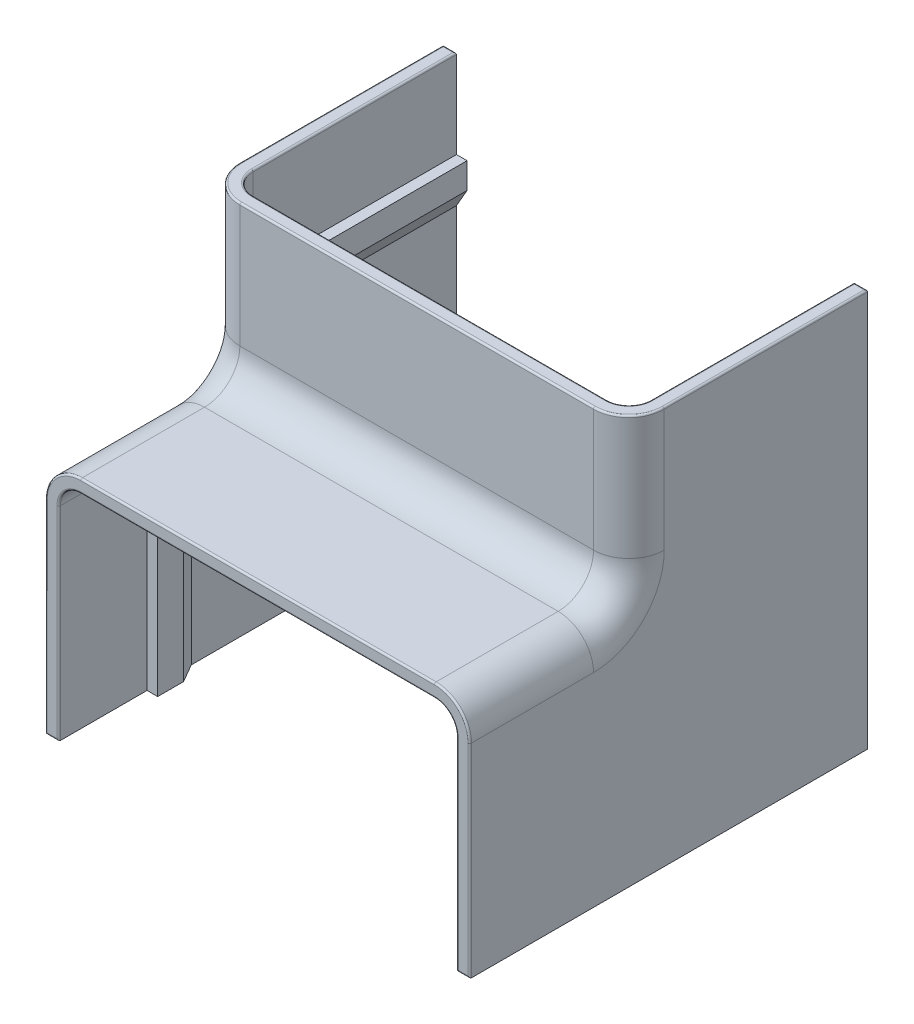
ISO-10303-21;
HEADER;
FILE_DESCRIPTION(('STEP AP214'),'2;1');
FILE_NAME('part.step','',(''),(''),'','','');
FILE_SCHEMA(('AUTOMOTIVE_DESIGN { 1 0 10303 214 1 1 1 1 }'));
ENDSEC;
DATA;
#1=APPLICATION_CONTEXT('core data for automotive mechanical design processes');
#2=APPLICATION_PROTOCOL_DEFINITION('international standard','automotive_design',2000,#1);
#3=PRODUCT_CONTEXT('',#1,'mechanical');
#4=PRODUCT('Part','Part','',(#3));
#5=PRODUCT_RELATED_PRODUCT_CATEGORY('part','',(#4));
#6=PRODUCT_DEFINITION_FORMATION('','',#4);
#7=PRODUCT_DEFINITION_CONTEXT('part definition',#1,'design');
#8=PRODUCT_DEFINITION('design','',#6,#7);
#9=PRODUCT_DEFINITION_SHAPE('','',#8);
#10=(LENGTH_UNIT() NAMED_UNIT(*) SI_UNIT(.MILLI.,.METRE.));
#11=(NAMED_UNIT(*) PLANE_ANGLE_UNIT() SI_UNIT($,.RADIAN.));
#12=(NAMED_UNIT(*) SI_UNIT($,.STERADIAN.) SOLID_ANGLE_UNIT());
#13=UNCERTAINTY_MEASURE_WITH_UNIT(LENGTH_MEASURE(1.E-05),#10,'distance_accuracy_value','');
#14=(GEOMETRIC_REPRESENTATION_CONTEXT(3) GLOBAL_UNCERTAINTY_ASSIGNED_CONTEXT((#13)) GLOBAL_UNIT_ASSIGNED_CONTEXT((#10,
#11,#12)) REPRESENTATION_CONTEXT('',''));
#15=CARTESIAN_POINT('',(0.,0.,0.));
#16=DIRECTION('',(0.,0.,1.));
#17=DIRECTION('',(1.,0.,0.));
#18=AXIS2_PLACEMENT_3D('',#15,#16,#17);
#19=CARTESIAN_POINT('',(-48.,0.2,-0.2));
#20=DIRECTION('',(1.,0.,0.));
#21=DIRECTION('',(0.,0.,-1.));
#22=AXIS2_PLACEMENT_3D('',#19,#20,#21);
#23=CYLINDRICAL_SURFACE('',#22,0.2);
#24=CARTESIAN_POINT('',(-47.8,0.2,0.));
#25=CARTESIAN_POINT('',(-47.9171572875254,0.0828427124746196,0.));
#26=CARTESIAN_POINT('',(-48.,0.,-0.0828427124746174));
#27=CARTESIAN_POINT('',(-48.,0.,-0.2));
#28=(BOUNDED_CURVE() B_SPLINE_CURVE(3,(#24,#25,#26,#27),.UNSPECIFIED.,.F.,
.F.) B_SPLINE_CURVE_WITH_KNOTS((4,4),(4.71238898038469,6.28318530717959),
.UNSPECIFIED.) CURVE() GEOMETRIC_REPRESENTATION_ITEM() RATIONAL_B_SPLINE_CURVE((1.,
0.804737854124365,0.804737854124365,1.)) REPRESENTATION_ITEM(''));
#29=CARTESIAN_POINT('',(-47.8,0.2,0.));
#30=VERTEX_POINT('',#29);
#31=CARTESIAN_POINT('',(-48.,0.,-0.2));
#32=VERTEX_POINT('',#31);
#33=EDGE_CURVE('E25',#30,#32,#28,.T.);
#34=ORIENTED_EDGE('',*,*,#33,.T.);
#35=DIRECTION('',(-1.,0.,0.));
#36=VECTOR('',#35,1.);
#37=CARTESIAN_POINT('',(-48.,0.,-0.2));
#38=LINE('',#37,#36);
#39=CARTESIAN_POINT('',(-46.5,0.,-0.2));
#40=VERTEX_POINT('',#39);
#41=EDGE_CURVE('E1712',#40,#32,#38,.T.);
#42=ORIENTED_EDGE('',*,*,#41,.F.);
#43=CARTESIAN_POINT('',(-46.5,0.,-0.2));
#44=CARTESIAN_POINT('',(-46.5,0.,-0.0828427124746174));
#45=CARTESIAN_POINT('',(-46.5828427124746,0.0828427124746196,0.));
#46=CARTESIAN_POINT('',(-46.7,0.2,0.));
#47=(BOUNDED_CURVE() B_SPLINE_CURVE(3,(#43,#44,#45,#46),.UNSPECIFIED.,.F.,
.F.) B_SPLINE_CURVE_WITH_KNOTS((4,4),(0.,1.5707963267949),
.UNSPECIFIED.) CURVE() GEOMETRIC_REPRESENTATION_ITEM() RATIONAL_B_SPLINE_CURVE((1.,
0.804737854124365,0.804737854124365,1.)) REPRESENTATION_ITEM(''));
#48=CARTESIAN_POINT('',(-46.7,0.2,0.));
#49=VERTEX_POINT('',#48);
#50=EDGE_CURVE('E10',#40,#49,#47,.T.);
#51=ORIENTED_EDGE('',*,*,#50,.T.);
#52=DIRECTION('',(1.,0.,0.));
#53=VECTOR('',#52,1.);
#54=CARTESIAN_POINT('',(-48.,0.2,0.));
#55=LINE('',#54,#53);
#56=EDGE_CURVE('E1804',#30,#49,#55,.T.);
#57=ORIENTED_EDGE('',*,*,#56,.F.);
#58=EDGE_LOOP('',(#34,#42,#51,#57));
#59=FACE_BOUND('',#58,.T.);
#60=ADVANCED_FACE('F16',(#59),#23,.T.);
#61=CARTESIAN_POINT('',(-46.7,11.5,-0.2));
#62=DIRECTION('',(0.,-1.,0.));
#63=DIRECTION('',(0.,0.,-1.));
#64=AXIS2_PLACEMENT_3D('',#61,#62,#63);
#65=CYLINDRICAL_SURFACE('',#64,0.2);
#66=CARTESIAN_POINT('',(-46.6999999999,23.000000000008,-0.2));
#67=DIRECTION('',(-4.00027233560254E-11,-1.,0.));
#68=DIRECTION('',(1.,-4.00027233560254E-11,0.));
#69=AXIS2_PLACEMENT_3D('',#66,#67,#68);
#70=CIRCLE('',#69,0.2);
#71=CARTESIAN_POINT('',(-46.5,23.,-0.2));
#72=VERTEX_POINT('',#71);
#73=CARTESIAN_POINT('',(-46.7,23.000000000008,0.));
#74=VERTEX_POINT('',#73);
#75=EDGE_CURVE('E866',#72,#74,#70,.T.);
#76=ORIENTED_EDGE('',*,*,#75,.T.);
#77=DIRECTION('',(0.,1.,0.));
#78=VECTOR('',#77,1.);
#79=CARTESIAN_POINT('',(-46.7,23.,0.));
#80=LINE('',#79,#78);
#81=EDGE_CURVE('E1796',#49,#74,#80,.T.);
#82=ORIENTED_EDGE('',*,*,#81,.F.);
#83=ORIENTED_EDGE('',*,*,#50,.F.);
#84=DIRECTION('',(0.,-1.,0.));
#85=VECTOR('',#84,1.);
#86=CARTESIAN_POINT('',(-46.5,0.,-0.2));
#87=LINE('',#86,#85);
#88=EDGE_CURVE('E838',#72,#40,#87,.T.);
#89=ORIENTED_EDGE('',*,*,#88,.F.);
#90=EDGE_LOOP('',(#76,#82,#83,#89));
#91=FACE_BOUND('',#90,.T.);
#92=ADVANCED_FACE('F3219',(#91),#65,.T.);
#93=CARTESIAN_POINT('',(-47.8,11.5,-0.2));
#94=DIRECTION('',(0.,-1.,0.));
#95=DIRECTION('',(0.,0.,-1.));
#96=AXIS2_PLACEMENT_3D('',#93,#94,#95);
#97=CYLINDRICAL_SURFACE('',#96,0.2);
#98=CARTESIAN_POINT('',(-47.7999999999,23.,-0.2));
#99=DIRECTION('',(0.,-1.,0.));
#100=DIRECTION('',(0.,0.,-1.));
#101=AXIS2_PLACEMENT_3D('',#98,#99,#100);
#102=CIRCLE('',#101,0.2);
#103=CARTESIAN_POINT('',(-47.7999999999,23.,0.));
#104=VERTEX_POINT('',#103);
#105=CARTESIAN_POINT('',(-48.,23.,-0.2));
#106=VERTEX_POINT('',#105);
#107=EDGE_CURVE('E1002',#104,#106,#102,.T.);
#108=ORIENTED_EDGE('',*,*,#107,.T.);
#109=DIRECTION('',(0.,1.,0.));
#110=VECTOR('',#109,1.);
#111=CARTESIAN_POINT('',(-48.,19.782508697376,-0.2));
#112=LINE('',#111,#110);
#113=EDGE_CURVE('E1835',#32,#106,#112,.T.);
#114=ORIENTED_EDGE('',*,*,#113,.F.);
#115=ORIENTED_EDGE('',*,*,#33,.F.);
#116=DIRECTION('',(0.,-1.,0.));
#117=VECTOR('',#116,1.);
#118=CARTESIAN_POINT('',(-47.8,11.5,0.));
#119=LINE('',#118,#117);
#120=EDGE_CURVE('E1812',#104,#30,#119,.T.);
#121=ORIENTED_EDGE('',*,*,#120,.F.);
#122=EDGE_LOOP('',(#108,#114,#115,#121));
#123=FACE_BOUND('',#122,.T.);
#124=ADVANCED_FACE('F3223',(#123),#97,.T.);
#125=CARTESIAN_POINT('',(-43.9999999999,22.9999999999,-0.2));
#126=DIRECTION('',(0.,0.,1.));
#127=DIRECTION('',(0.,-1.,0.));
#128=AXIS2_PLACEMENT_3D('',#125,#126,#127);
#129=TOROIDAL_SURFACE('',#128,2.7,0.2);
#130=CARTESIAN_POINT('',(-44.,25.7,-0.2));
#131=DIRECTION('',(-1.,0.,0.));
#132=DIRECTION('',(0.,0.,1.));
#133=AXIS2_PLACEMENT_3D('',#130,#131,#132);
#134=CIRCLE('',#133,0.2);
#135=CARTESIAN_POINT('',(-44.,25.5,-0.2));
#136=VERTEX_POINT('',#135);
#137=CARTESIAN_POINT('',(-44.,25.6999999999,0.));
#138=VERTEX_POINT('',#137);
#139=EDGE_CURVE('E999',#136,#138,#134,.T.);
#140=ORIENTED_EDGE('',*,*,#139,.T.);
#141=CARTESIAN_POINT('',(-43.9999999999,22.9999999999,0.));
#142=DIRECTION('',(0.,0.,-1.));
#143=DIRECTION('',(0.,-1.,0.));
#144=AXIS2_PLACEMENT_3D('',#141,#142,#143);
#145=CIRCLE('',#144,2.7);
#146=EDGE_CURVE('E1789',#74,#138,#145,.T.);
#147=ORIENTED_EDGE('',*,*,#146,.F.);
#148=ORIENTED_EDGE('',*,*,#75,.F.);
#149=CARTESIAN_POINT('',(-43.9999999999,22.9999999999,-0.2));
#150=DIRECTION('',(0.,0.,1.));
#151=DIRECTION('',(0.,-1.,0.));
#152=AXIS2_PLACEMENT_3D('',#149,#150,#151);
#153=CIRCLE('',#152,2.5);
#154=EDGE_CURVE('E897',#136,#72,#153,.T.);
#155=ORIENTED_EDGE('',*,*,#154,.F.);
#156=EDGE_LOOP('',(#140,#147,#148,#155));
#157=FACE_BOUND('',#156,.T.);
#158=ADVANCED_FACE('F3356',(#157),#129,.T.);
#159=CARTESIAN_POINT('',(-43.9999999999,22.9999999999,-0.2));
#160=DIRECTION('',(0.,0.,1.));
#161=DIRECTION('',(0.,-1.,0.));
#162=AXIS2_PLACEMENT_3D('',#159,#160,#161);
#163=TOROIDAL_SURFACE('',#162,3.8,0.2);
#164=CARTESIAN_POINT('',(-43.999999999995,26.8,-0.2));
#165=DIRECTION('',(-1.,-2.50147125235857E-11,0.));
#166=DIRECTION('',(2.50147125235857E-11,-1.,0.));
#167=AXIS2_PLACEMENT_3D('',#164,#165,#166);
#168=CIRCLE('',#167,0.2);
#169=CARTESIAN_POINT('',(-43.999999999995,26.8,0.));
#170=VERTEX_POINT('',#169);
#171=CARTESIAN_POINT('',(-44.,27.,-0.2));
#172=VERTEX_POINT('',#171);
#173=EDGE_CURVE('E995',#170,#172,#168,.T.);
#174=ORIENTED_EDGE('',*,*,#173,.T.);
#175=CARTESIAN_POINT('',(-43.9999999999,22.9999999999,-0.2));
#176=DIRECTION('',(0.,0.,-1.));
#177=DIRECTION('',(0.,-1.,0.));
#178=AXIS2_PLACEMENT_3D('',#175,#176,#177);
#179=CIRCLE('',#178,4.);
#180=EDGE_CURVE('E1585',#106,#172,#179,.T.);
#181=ORIENTED_EDGE('',*,*,#180,.F.);
#182=ORIENTED_EDGE('',*,*,#107,.F.);
#183=CARTESIAN_POINT('',(-43.9999999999,22.9999999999,0.));
#184=DIRECTION('',(0.,0.,1.));
#185=DIRECTION('',(0.,-1.,0.));
#186=AXIS2_PLACEMENT_3D('',#183,#184,#185);
#187=CIRCLE('',#186,3.8);
#188=EDGE_CURVE('E1728',#170,#104,#187,.T.);
#189=ORIENTED_EDGE('',*,*,#188,.F.);
#190=EDGE_LOOP('',(#174,#181,#182,#189));
#191=FACE_BOUND('',#190,.T.);
#192=ADVANCED_FACE('F3102',(#191),#163,.T.);
#193=CARTESIAN_POINT('',(-48.,25.7,-0.2));
#194=DIRECTION('',(-1.,0.,0.));
#195=DIRECTION('',(0.,0.,1.));
#196=AXIS2_PLACEMENT_3D('',#193,#194,#195);
#197=CYLINDRICAL_SURFACE('',#196,0.2);
#198=CARTESIAN_POINT('',(-3.999999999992,25.6999999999,-0.2));
#199=DIRECTION('',(-1.,3.99983865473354E-11,0.));
#200=DIRECTION('',(-3.99983865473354E-11,-1.,0.));
#201=AXIS2_PLACEMENT_3D('',#198,#199,#200);
#202=CIRCLE('',#201,0.2);
#203=CARTESIAN_POINT('',(-4.,25.5,-0.2));
#204=VERTEX_POINT('',#203);
#205=CARTESIAN_POINT('',(-3.999999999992,25.7,0.));
#206=VERTEX_POINT('',#205);
#207=EDGE_CURVE('E992',#204,#206,#202,.T.);
#208=ORIENTED_EDGE('',*,*,#207,.T.);
#209=DIRECTION('',(1.,0.,0.));
#210=VECTOR('',#209,1.);
#211=CARTESIAN_POINT('',(-4.,25.7,0.));
#212=LINE('',#211,#210);
#213=EDGE_CURVE('E1781',#138,#206,#212,.T.);
#214=ORIENTED_EDGE('',*,*,#213,.F.);
#215=ORIENTED_EDGE('',*,*,#139,.F.);
#216=DIRECTION('',(-1.,0.,0.));
#217=VECTOR('',#216,1.);
#218=CARTESIAN_POINT('',(-44.,25.5,-0.2));
#219=LINE('',#218,#217);
#220=EDGE_CURVE('E884',#204,#136,#219,.T.);
#221=ORIENTED_EDGE('',*,*,#220,.F.);
#222=EDGE_LOOP('',(#208,#214,#215,#221));
#223=FACE_BOUND('',#222,.T.);
#224=ADVANCED_FACE('F3098',(#223),#197,.T.);
#225=CARTESIAN_POINT('',(-48.,26.8,-0.2));
#226=DIRECTION('',(1.,0.,0.));
#227=DIRECTION('',(0.,0.,-1.));
#228=AXIS2_PLACEMENT_3D('',#225,#226,#227);
#229=CYLINDRICAL_SURFACE('',#228,0.2);
#230=CARTESIAN_POINT('',(-4.,26.7999999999,-0.2));
#231=DIRECTION('',(-1.,0.,0.));
#232=DIRECTION('',(0.,0.,1.));
#233=AXIS2_PLACEMENT_3D('',#230,#231,#232);
#234=CIRCLE('',#233,0.2);
#235=CARTESIAN_POINT('',(-4.,26.7999999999,0.));
#236=VERTEX_POINT('',#235);
#237=CARTESIAN_POINT('',(-4.,27.,-0.2));
#238=VERTEX_POINT('',#237);
#239=EDGE_CURVE('E996',#236,#238,#234,.T.);
#240=ORIENTED_EDGE('',*,*,#239,.T.);
#241=DIRECTION('',(1.,0.,0.));
#242=VECTOR('',#241,1.);
#243=CARTESIAN_POINT('',(-4.,27.,-0.2));
#244=LINE('',#243,#242);
#245=EDGE_CURVE('E1606',#172,#238,#244,.T.);
#246=ORIENTED_EDGE('',*,*,#245,.F.);
#247=ORIENTED_EDGE('',*,*,#173,.F.);
#248=DIRECTION('',(-1.,0.,0.));
#249=VECTOR('',#248,1.);
#250=CARTESIAN_POINT('',(-44.,26.8,0.));
#251=LINE('',#250,#249);
#252=EDGE_CURVE('E1735',#236,#170,#251,.T.);
#253=ORIENTED_EDGE('',*,*,#252,.F.);
#254=EDGE_LOOP('',(#240,#246,#247,#253));
#255=FACE_BOUND('',#254,.T.);
#256=ADVANCED_FACE('F1180',(#255),#229,.T.);
#257=CARTESIAN_POINT('',(-4.00000000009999,22.9999999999,-0.2));
#258=DIRECTION('',(0.,0.,1.));
#259=DIRECTION('',(0.,-1.,0.));
#260=AXIS2_PLACEMENT_3D('',#257,#258,#259);
#261=TOROIDAL_SURFACE('',#260,2.7,0.2);
#262=CARTESIAN_POINT('',(-1.3,23.,-0.2));
#263=DIRECTION('',(0.,1.,0.));
#264=DIRECTION('',(0.,0.,1.));
#265=AXIS2_PLACEMENT_3D('',#262,#263,#264);
#266=CIRCLE('',#265,0.2);
#267=CARTESIAN_POINT('',(-1.5,23.,-0.2));
#268=VERTEX_POINT('',#267);
#269=CARTESIAN_POINT('',(-1.3000000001,23.,0.));
#270=VERTEX_POINT('',#269);
#271=EDGE_CURVE('E991',#268,#270,#266,.T.);
#272=ORIENTED_EDGE('',*,*,#271,.T.);
#273=CARTESIAN_POINT('',(-4.00000000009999,22.9999999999,0.));
#274=DIRECTION('',(0.,0.,-1.));
#275=DIRECTION('',(0.,-1.,0.));
#276=AXIS2_PLACEMENT_3D('',#273,#274,#275);
#277=CIRCLE('',#276,2.7);
#278=EDGE_CURVE('E1773',#206,#270,#277,.T.);
#279=ORIENTED_EDGE('',*,*,#278,.F.);
#280=ORIENTED_EDGE('',*,*,#207,.F.);
#281=CARTESIAN_POINT('',(-4.00000000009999,22.9999999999,-0.2));
#282=DIRECTION('',(0.,0.,1.));
#283=DIRECTION('',(0.,-1.,0.));
#284=AXIS2_PLACEMENT_3D('',#281,#282,#283);
#285=CIRCLE('',#284,2.5);
#286=EDGE_CURVE('E940',#268,#204,#285,.T.);
#287=ORIENTED_EDGE('',*,*,#286,.F.);
#288=EDGE_LOOP('',(#272,#279,#280,#287));
#289=FACE_BOUND('',#288,.T.);
#290=ADVANCED_FACE('F1176',(#289),#261,.T.);
#291=CARTESIAN_POINT('',(-4.00000000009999,22.9999999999,-0.2));
#292=DIRECTION('',(0.,0.,1.));
#293=DIRECTION('',(0.,-1.,0.));
#294=AXIS2_PLACEMENT_3D('',#291,#292,#293);
#295=TOROIDAL_SURFACE('',#294,3.8,0.2);
#296=CARTESIAN_POINT('',(-0.199999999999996,22.999999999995,-0.2));
#297=DIRECTION('',(-2.49973652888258E-11,1.,0.));
#298=DIRECTION('',(-1.,-2.49973652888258E-11,0.));
#299=AXIS2_PLACEMENT_3D('',#296,#297,#298);
#300=CIRCLE('',#299,0.2);
#301=CARTESIAN_POINT('',(-0.199999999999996,22.999999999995,0.));
#302=VERTEX_POINT('',#301);
#303=CARTESIAN_POINT('',(0.,23.,-0.2));
#304=VERTEX_POINT('',#303);
#305=EDGE_CURVE('E875',#302,#304,#300,.T.);
#306=ORIENTED_EDGE('',*,*,#305,.T.);
#307=CARTESIAN_POINT('',(-4.00000000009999,22.9999999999,-0.2));
#308=DIRECTION('',(0.,0.,-1.));
#309=DIRECTION('',(0.,-1.,0.));
#310=AXIS2_PLACEMENT_3D('',#307,#308,#309);
#311=CIRCLE('',#310,4.);
#312=EDGE_CURVE('E707',#238,#304,#311,.T.);
#313=ORIENTED_EDGE('',*,*,#312,.F.);
#314=ORIENTED_EDGE('',*,*,#239,.F.);
#315=CARTESIAN_POINT('',(-4.00000000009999,22.9999999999,0.));
#316=DIRECTION('',(0.,0.,1.));
#317=DIRECTION('',(0.,-1.,0.));
#318=AXIS2_PLACEMENT_3D('',#315,#316,#317);
#319=CIRCLE('',#318,3.8);
#320=EDGE_CURVE('E1742',#302,#236,#319,.T.);
#321=ORIENTED_EDGE('',*,*,#320,.F.);
#322=EDGE_LOOP('',(#306,#313,#314,#321));
#323=FACE_BOUND('',#322,.T.);
#324=ADVANCED_FACE('F1179',(#323),#295,.T.);
#325=CARTESIAN_POINT('',(-1.3,11.5,-0.2));
#326=DIRECTION('',(0.,-1.,0.));
#327=DIRECTION('',(0.,0.,-1.));
#328=AXIS2_PLACEMENT_3D('',#325,#326,#327);
#329=CYLINDRICAL_SURFACE('',#328,0.2);
#330=CARTESIAN_POINT('',(-1.5,0.,-0.2));
#331=CARTESIAN_POINT('',(-1.5,0.,-0.0828427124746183));
#332=CARTESIAN_POINT('',(-1.41715728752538,0.0828427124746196,0.));
#333=CARTESIAN_POINT('',(-1.3,0.2,0.));
#334=(BOUNDED_CURVE() B_SPLINE_CURVE(3,(#330,#331,#332,#333),.UNSPECIFIED.,.F.,
.F.) B_SPLINE_CURVE_WITH_KNOTS((4,4),(0.,1.5707963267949),
.UNSPECIFIED.) CURVE() GEOMETRIC_REPRESENTATION_ITEM() RATIONAL_B_SPLINE_CURVE((1.,
0.804737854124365,0.804737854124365,1.)) REPRESENTATION_ITEM(''));
#335=CARTESIAN_POINT('',(-1.5,0.,-0.2));
#336=VERTEX_POINT('',#335);
#337=CARTESIAN_POINT('',(-1.3,0.2,0.));
#338=VERTEX_POINT('',#337);
#339=EDGE_CURVE('E876',#336,#338,#334,.T.);
#340=ORIENTED_EDGE('',*,*,#339,.T.);
#341=DIRECTION('',(0.,-1.,0.));
#342=VECTOR('',#341,1.);
#343=CARTESIAN_POINT('',(-1.3,11.5,0.));
#344=LINE('',#343,#342);
#345=EDGE_CURVE('E1765',#270,#338,#344,.T.);
#346=ORIENTED_EDGE('',*,*,#345,.F.);
#347=ORIENTED_EDGE('',*,*,#271,.F.);
#348=DIRECTION('',(0.,1.,0.));
#349=VECTOR('',#348,1.);
#350=CARTESIAN_POINT('',(-1.5,19.782508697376,-0.2));
#351=LINE('',#350,#349);
#352=EDGE_CURVE('E807',#336,#268,#351,.T.);
#353=ORIENTED_EDGE('',*,*,#352,.F.);
#354=EDGE_LOOP('',(#340,#346,#347,#353));
#355=FACE_BOUND('',#354,.T.);
#356=ADVANCED_FACE('F3311',(#355),#329,.T.);
#357=CARTESIAN_POINT('',(-0.199999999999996,19.782508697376,-0.2));
#358=DIRECTION('',(0.,1.,0.));
#359=DIRECTION('',(0.,0.,1.));
#360=AXIS2_PLACEMENT_3D('',#357,#358,#359);
#361=CYLINDRICAL_SURFACE('',#360,0.2);
#362=CARTESIAN_POINT('',(-0.199999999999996,0.2,0.));
#363=CARTESIAN_POINT('',(-0.0828427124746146,0.0828427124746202,0.));
#364=CARTESIAN_POINT('',(0.,0.,-0.082842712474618));
#365=CARTESIAN_POINT('',(0.,0.,-0.2));
#366=(BOUNDED_CURVE() B_SPLINE_CURVE(3,(#362,#363,#364,#365),.UNSPECIFIED.,.F.,
.F.) B_SPLINE_CURVE_WITH_KNOTS((4,4),(1.5707963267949,3.1415926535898),
.UNSPECIFIED.) CURVE() GEOMETRIC_REPRESENTATION_ITEM() RATIONAL_B_SPLINE_CURVE((1.,
0.804737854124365,0.804737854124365,1.)) REPRESENTATION_ITEM(''));
#367=CARTESIAN_POINT('',(-0.199999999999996,0.2,0.));
#368=VERTEX_POINT('',#367);
#369=CARTESIAN_POINT('',(0.,0.,-0.2));
#370=VERTEX_POINT('',#369);
#371=EDGE_CURVE('E867',#368,#370,#366,.T.);
#372=ORIENTED_EDGE('',*,*,#371,.T.);
#373=DIRECTION('',(0.,-1.,0.));
#374=VECTOR('',#373,1.);
#375=CARTESIAN_POINT('',(0.,0.,-0.2));
#376=LINE('',#375,#374);
#377=EDGE_CURVE('E590',#304,#370,#376,.T.);
#378=ORIENTED_EDGE('',*,*,#377,.F.);
#379=ORIENTED_EDGE('',*,*,#305,.F.);
#380=DIRECTION('',(0.,1.,0.));
#381=VECTOR('',#380,1.);
#382=CARTESIAN_POINT('',(-0.199999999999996,23.,0.));
#383=LINE('',#382,#381);
#384=EDGE_CURVE('E1750',#368,#302,#383,.T.);
#385=ORIENTED_EDGE('',*,*,#384,.F.);
#386=EDGE_LOOP('',(#372,#378,#379,#385));
#387=FACE_BOUND('',#386,.T.);
#388=ADVANCED_FACE('F3116',(#387),#361,.T.);
#389=CARTESIAN_POINT('',(0.,0.2,-0.2));
#390=DIRECTION('',(-1.,0.,0.));
#391=DIRECTION('',(0.,0.,1.));
#392=AXIS2_PLACEMENT_3D('',#389,#390,#391);
#393=CYLINDRICAL_SURFACE('',#392,0.2);
#394=ORIENTED_EDGE('',*,*,#339,.F.);
#395=DIRECTION('',(-1.,0.,0.));
#396=VECTOR('',#395,1.);
#397=CARTESIAN_POINT('',(0.,0.,-0.2));
#398=LINE('',#397,#396);
#399=EDGE_CURVE('E679',#370,#336,#398,.T.);
#400=ORIENTED_EDGE('',*,*,#399,.F.);
#401=ORIENTED_EDGE('',*,*,#371,.F.);
#402=DIRECTION('',(1.,0.,0.));
#403=VECTOR('',#402,1.);
#404=CARTESIAN_POINT('',(-48.,0.2,0.));
#405=LINE('',#404,#403);
#406=EDGE_CURVE('E1757',#338,#368,#405,.T.);
#407=ORIENTED_EDGE('',*,*,#406,.F.);
#408=EDGE_LOOP('',(#394,#400,#401,#407));
#409=FACE_BOUND('',#408,.T.);
#410=ADVANCED_FACE('F3111',(#409),#393,.T.);
#411=CARTESIAN_POINT('',(0.,44.8,-44.8));
#412=DIRECTION('',(-1.,0.,0.));
#413=DIRECTION('',(0.,0.,1.));
#414=AXIS2_PLACEMENT_3D('',#411,#412,#413);
#415=CYLINDRICAL_SURFACE('',#414,0.2);
#416=CARTESIAN_POINT('',(-0.199999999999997,45.,-44.8));
#417=CARTESIAN_POINT('',(-0.0828427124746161,45.,-44.9171572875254));
#418=CARTESIAN_POINT('',(0.,44.9171572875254,-45.));
#419=CARTESIAN_POINT('',(0.,44.8,-45.));
#420=(BOUNDED_CURVE() B_SPLINE_CURVE(3,(#416,#417,#418,#419),.UNSPECIFIED.,.F.,
.F.) B_SPLINE_CURVE_WITH_KNOTS((4,4),(4.71238898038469,6.28318530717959),
.UNSPECIFIED.) CURVE() GEOMETRIC_REPRESENTATION_ITEM() RATIONAL_B_SPLINE_CURVE((1.,
0.804737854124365,0.804737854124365,1.)) REPRESENTATION_ITEM(''));
#421=CARTESIAN_POINT('',(-0.199999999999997,45.,-44.8));
#422=VERTEX_POINT('',#421);
#423=CARTESIAN_POINT('',(0.,44.8,-45.));
#424=VERTEX_POINT('',#423);
#425=EDGE_CURVE('E551',#422,#424,#420,.T.);
#426=ORIENTED_EDGE('',*,*,#425,.T.);
#427=DIRECTION('',(1.,0.,0.));
#428=VECTOR('',#427,1.);
#429=CARTESIAN_POINT('',(0.,44.8,-45.));
#430=LINE('',#429,#428);
#431=CARTESIAN_POINT('',(-1.5,44.8,-45.));
#432=VERTEX_POINT('',#431);
#433=EDGE_CURVE('E649',#432,#424,#430,.T.);
#434=ORIENTED_EDGE('',*,*,#433,.F.);
#435=CARTESIAN_POINT('',(-1.5,44.8,-45.));
#436=CARTESIAN_POINT('',(-1.5,44.9171572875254,-45.));
#437=CARTESIAN_POINT('',(-1.41715728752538,45.,-44.9171572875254));
#438=CARTESIAN_POINT('',(-1.3,45.,-44.8));
#439=(BOUNDED_CURVE() B_SPLINE_CURVE(3,(#435,#436,#437,#438),.UNSPECIFIED.,.F.,
.F.) B_SPLINE_CURVE_WITH_KNOTS((4,4),(3.1415926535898,4.71238898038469),
.UNSPECIFIED.) CURVE() GEOMETRIC_REPRESENTATION_ITEM() RATIONAL_B_SPLINE_CURVE((1.,
0.804737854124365,0.804737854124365,1.)) REPRESENTATION_ITEM(''));
#440=CARTESIAN_POINT('',(-1.3,45.,-44.8));
#441=VERTEX_POINT('',#440);
#442=EDGE_CURVE('E569',#432,#441,#439,.T.);
#443=ORIENTED_EDGE('',*,*,#442,.T.);
#444=DIRECTION('',(-1.,0.,0.));
#445=VECTOR('',#444,1.);
#446=CARTESIAN_POINT('',(0.,45.,-44.8));
#447=LINE('',#446,#445);
#448=EDGE_CURVE('E1513',#422,#441,#447,.T.);
#449=ORIENTED_EDGE('',*,*,#448,.F.);
#450=EDGE_LOOP('',(#426,#434,#443,#449));
#451=FACE_BOUND('',#450,.T.);
#452=ADVANCED_FACE('F3115',(#451),#415,.T.);
#453=CARTESIAN_POINT('',(-1.3,44.8,-33.5));
#454=DIRECTION('',(0.,0.,1.));
#455=DIRECTION('',(0.,-1.,0.));
#456=AXIS2_PLACEMENT_3D('',#453,#454,#455);
#457=CYLINDRICAL_SURFACE('',#456,0.2);
#458=CARTESIAN_POINT('',(-1.3000000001,44.8,-21.999999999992));
#459=DIRECTION('',(4.00027233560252E-11,0.,-1.));
#460=DIRECTION('',(-1.,0.,-4.00027233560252E-11));
#461=AXIS2_PLACEMENT_3D('',#458,#459,#460);
#462=CIRCLE('',#461,0.2);
#463=CARTESIAN_POINT('',(-1.5,44.8,-22.));
#464=VERTEX_POINT('',#463);
#465=CARTESIAN_POINT('',(-1.3,45.,-21.999999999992));
#466=VERTEX_POINT('',#465);
#467=EDGE_CURVE('E539',#464,#466,#462,.T.);
#468=ORIENTED_EDGE('',*,*,#467,.T.);
#469=DIRECTION('',(0.,0.,1.));
#470=VECTOR('',#469,1.);
#471=CARTESIAN_POINT('',(-1.3,45.,-33.5));
#472=LINE('',#471,#470);
#473=EDGE_CURVE('E600',#441,#466,#472,.T.);
#474=ORIENTED_EDGE('',*,*,#473,.F.);
#475=ORIENTED_EDGE('',*,*,#442,.F.);
#476=DIRECTION('',(0.,0.,-1.));
#477=VECTOR('',#476,1.);
#478=CARTESIAN_POINT('',(-1.5,44.8,-25.217491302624));
#479=LINE('',#478,#477);
#480=EDGE_CURVE('E567',#464,#432,#479,.T.);
#481=ORIENTED_EDGE('',*,*,#480,.F.);
#482=EDGE_LOOP('',(#468,#474,#475,#481));
#483=FACE_BOUND('',#482,.T.);
#484=ADVANCED_FACE('F568',(#483),#457,.T.);
#485=CARTESIAN_POINT('',(-0.199999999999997,44.8,-25.217491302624));
#486=DIRECTION('',(0.,0.,-1.));
#487=DIRECTION('',(0.,1.,0.));
#488=AXIS2_PLACEMENT_3D('',#485,#486,#487);
#489=CYLINDRICAL_SURFACE('',#488,0.2);
#490=CARTESIAN_POINT('',(-0.200000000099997,44.8,-22.));
#491=DIRECTION('',(0.,0.,-1.));
#492=DIRECTION('',(-1.,0.,0.));
#493=AXIS2_PLACEMENT_3D('',#490,#491,#492);
#494=CIRCLE('',#493,0.2);
#495=CARTESIAN_POINT('',(-0.200000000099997,45.,-22.));
#496=VERTEX_POINT('',#495);
#497=CARTESIAN_POINT('',(0.,44.8,-22.));
#498=VERTEX_POINT('',#497);
#499=EDGE_CURVE('E552',#496,#498,#494,.T.);
#500=ORIENTED_EDGE('',*,*,#499,.T.);
#501=DIRECTION('',(0.,0.,1.));
#502=VECTOR('',#501,1.);
#503=CARTESIAN_POINT('',(0.,44.8,-22.));
#504=LINE('',#503,#502);
#505=EDGE_CURVE('E1564',#424,#498,#504,.T.);
#506=ORIENTED_EDGE('',*,*,#505,.F.);
#507=ORIENTED_EDGE('',*,*,#425,.F.);
#508=DIRECTION('',(0.,0.,-1.));
#509=VECTOR('',#508,1.);
#510=CARTESIAN_POINT('',(-0.199999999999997,45.,-45.));
#511=LINE('',#510,#509);
#512=EDGE_CURVE('E596',#496,#422,#511,.T.);
#513=ORIENTED_EDGE('',*,*,#512,.F.);
#514=EDGE_LOOP('',(#500,#506,#507,#513));
#515=FACE_BOUND('',#514,.T.);
#516=ADVANCED_FACE('F3235',(#515),#489,.T.);
#517=CARTESIAN_POINT('',(-4.00000000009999,44.8,-22.0000000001));
#518=DIRECTION('',(0.,1.,0.));
#519=DIRECTION('',(0.,0.,1.));
#520=AXIS2_PLACEMENT_3D('',#517,#518,#519);
#521=TOROIDAL_SURFACE('',#520,2.7,0.2);
#522=CARTESIAN_POINT('',(-4.,44.8,-19.3));
#523=DIRECTION('',(1.,0.,0.));
#524=DIRECTION('',(0.,0.,-1.));
#525=AXIS2_PLACEMENT_3D('',#522,#523,#524);
#526=CIRCLE('',#525,0.2);
#527=CARTESIAN_POINT('',(-4.,44.8,-19.5));
#528=VERTEX_POINT('',#527);
#529=CARTESIAN_POINT('',(-4.,45.,-19.3000000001));
#530=VERTEX_POINT('',#529);
#531=EDGE_CURVE('E803',#528,#530,#526,.T.);
#532=ORIENTED_EDGE('',*,*,#531,.T.);
#533=CARTESIAN_POINT('',(-4.00000000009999,45.,-22.0000000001));
#534=DIRECTION('',(0.,-1.,0.));
#535=DIRECTION('',(0.,0.,1.));
#536=AXIS2_PLACEMENT_3D('',#533,#534,#535);
#537=CIRCLE('',#536,2.7);
#538=EDGE_CURVE('E545',#466,#530,#537,.T.);
#539=ORIENTED_EDGE('',*,*,#538,.F.);
#540=ORIENTED_EDGE('',*,*,#467,.F.);
#541=CARTESIAN_POINT('',(-4.00000000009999,44.8,-22.0000000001));
#542=DIRECTION('',(0.,1.,0.));
#543=DIRECTION('',(0.,0.,1.));
#544=AXIS2_PLACEMENT_3D('',#541,#542,#543);
#545=CIRCLE('',#544,2.5);
#546=EDGE_CURVE('E542',#528,#464,#545,.T.);
#547=ORIENTED_EDGE('',*,*,#546,.F.);
#548=EDGE_LOOP('',(#532,#539,#540,#547));
#549=FACE_BOUND('',#548,.T.);
#550=ADVANCED_FACE('F541',(#549),#521,.T.);
#551=CARTESIAN_POINT('',(-4.00000000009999,44.8,-22.0000000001));
#552=DIRECTION('',(0.,1.,0.));
#553=DIRECTION('',(0.,0.,1.));
#554=AXIS2_PLACEMENT_3D('',#551,#552,#553);
#555=TOROIDAL_SURFACE('',#554,3.8,0.2);
#556=CARTESIAN_POINT('',(-4.000000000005,44.8,-18.2));
#557=DIRECTION('',(1.,0.,-2.50017020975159E-11));
#558=DIRECTION('',(-2.50017020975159E-11,0.,-1.));
#559=AXIS2_PLACEMENT_3D('',#556,#557,#558);
#560=CIRCLE('',#559,0.2);
#561=CARTESIAN_POINT('',(-4.000000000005,45.,-18.2));
#562=VERTEX_POINT('',#561);
#563=CARTESIAN_POINT('',(-4.,44.8,-18.));
#564=VERTEX_POINT('',#563);
#565=EDGE_CURVE('E800',#562,#564,#560,.T.);
#566=ORIENTED_EDGE('',*,*,#565,.T.);
#567=CARTESIAN_POINT('',(-4.00000000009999,44.8,-22.0000000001));
#568=DIRECTION('',(0.,-1.,0.));
#569=DIRECTION('',(0.,0.,1.));
#570=AXIS2_PLACEMENT_3D('',#567,#568,#569);
#571=CIRCLE('',#570,4.);
#572=EDGE_CURVE('E734',#498,#564,#571,.T.);
#573=ORIENTED_EDGE('',*,*,#572,.F.);
#574=ORIENTED_EDGE('',*,*,#499,.F.);
#575=CARTESIAN_POINT('',(-4.00000000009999,45.,-22.0000000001));
#576=DIRECTION('',(0.,1.,0.));
#577=DIRECTION('',(0.,0.,1.));
#578=AXIS2_PLACEMENT_3D('',#575,#576,#577);
#579=CIRCLE('',#578,3.8);
#580=EDGE_CURVE('E636',#562,#496,#579,.T.);
#581=ORIENTED_EDGE('',*,*,#580,.F.);
#582=EDGE_LOOP('',(#566,#573,#574,#581));
#583=FACE_BOUND('',#582,.T.);
#584=ADVANCED_FACE('F3056',(#583),#555,.T.);
#585=CARTESIAN_POINT('',(0.,44.8,-19.3));
#586=DIRECTION('',(1.,0.,0.));
#587=DIRECTION('',(0.,0.,-1.));
#588=AXIS2_PLACEMENT_3D('',#585,#586,#587);
#589=CYLINDRICAL_SURFACE('',#588,0.2);
#590=CARTESIAN_POINT('',(-44.000000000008,44.8,-19.3000000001));
#591=DIRECTION('',(1.,0.,4.00027233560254E-11));
#592=DIRECTION('',(4.00027233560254E-11,0.,-1.));
#593=AXIS2_PLACEMENT_3D('',#590,#591,#592);
#594=CIRCLE('',#593,0.2);
#595=CARTESIAN_POINT('',(-44.,44.8,-19.5));
#596=VERTEX_POINT('',#595);
#597=CARTESIAN_POINT('',(-44.000000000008,45.,-19.3));
#598=VERTEX_POINT('',#597);
#599=EDGE_CURVE('E644',#596,#598,#594,.T.);
#600=ORIENTED_EDGE('',*,*,#599,.T.);
#601=DIRECTION('',(-1.,0.,0.));
#602=VECTOR('',#601,1.);
#603=CARTESIAN_POINT('',(-44.,45.,-19.3));
#604=LINE('',#603,#602);
#605=EDGE_CURVE('E599',#530,#598,#604,.T.);
#606=ORIENTED_EDGE('',*,*,#605,.F.);
#607=ORIENTED_EDGE('',*,*,#531,.F.);
#608=DIRECTION('',(1.,0.,0.));
#609=VECTOR('',#608,1.);
#610=CARTESIAN_POINT('',(-4.,44.8,-19.5));
#611=LINE('',#610,#609);
#612=EDGE_CURVE('E768',#596,#528,#611,.T.);
#613=ORIENTED_EDGE('',*,*,#612,.F.);
#614=EDGE_LOOP('',(#600,#606,#607,#613));
#615=FACE_BOUND('',#614,.T.);
#616=ADVANCED_FACE('F3052',(#615),#589,.T.);
#617=CARTESIAN_POINT('',(0.,44.8,-18.2));
#618=DIRECTION('',(-1.,0.,0.));
#619=DIRECTION('',(0.,0.,1.));
#620=AXIS2_PLACEMENT_3D('',#617,#618,#619);
#621=CYLINDRICAL_SURFACE('',#620,0.2);
#622=CARTESIAN_POINT('',(-44.,44.8,-18.2000000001));
#623=DIRECTION('',(1.,0.,0.));
#624=DIRECTION('',(0.,0.,-1.));
#625=AXIS2_PLACEMENT_3D('',#622,#623,#624);
#626=CIRCLE('',#625,0.2);
#627=CARTESIAN_POINT('',(-44.,45.,-18.2000000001));
#628=VERTEX_POINT('',#627);
#629=CARTESIAN_POINT('',(-44.,44.8,-18.));
#630=VERTEX_POINT('',#629);
#631=EDGE_CURVE('E641',#628,#630,#626,.T.);
#632=ORIENTED_EDGE('',*,*,#631,.T.);
#633=DIRECTION('',(-1.,0.,0.));
#634=VECTOR('',#633,1.);
#635=CARTESIAN_POINT('',(-44.,44.8,-18.));
#636=LINE('',#635,#634);
#637=EDGE_CURVE('E685',#564,#630,#636,.T.);
#638=ORIENTED_EDGE('',*,*,#637,.F.);
#639=ORIENTED_EDGE('',*,*,#565,.F.);
#640=DIRECTION('',(1.,0.,0.));
#641=VECTOR('',#640,1.);
#642=CARTESIAN_POINT('',(-4.,45.,-18.2));
#643=LINE('',#642,#641);
#644=EDGE_CURVE('E625',#628,#562,#643,.T.);
#645=ORIENTED_EDGE('',*,*,#644,.F.);
#646=EDGE_LOOP('',(#632,#638,#639,#645));
#647=FACE_BOUND('',#646,.T.);
#648=ADVANCED_FACE('F1168',(#647),#621,.T.);
#649=CARTESIAN_POINT('',(-43.9999999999,44.8,-22.0000000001));
#650=DIRECTION('',(0.,1.,0.));
#651=DIRECTION('',(0.,0.,1.));
#652=AXIS2_PLACEMENT_3D('',#649,#650,#651);
#653=TOROIDAL_SURFACE('',#652,2.7,0.2);
#654=CARTESIAN_POINT('',(-46.7,44.8,-22.));
#655=DIRECTION('',(0.,0.,1.));
#656=DIRECTION('',(1.,0.,0.));
#657=AXIS2_PLACEMENT_3D('',#654,#655,#656);
#658=CIRCLE('',#657,0.2);
#659=CARTESIAN_POINT('',(-46.5,44.8,-22.));
#660=VERTEX_POINT('',#659);
#661=CARTESIAN_POINT('',(-46.6999999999,45.,-22.));
#662=VERTEX_POINT('',#661);
#663=EDGE_CURVE('E645',#660,#662,#658,.T.);
#664=ORIENTED_EDGE('',*,*,#663,.T.);
#665=CARTESIAN_POINT('',(-43.9999999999,45.,-22.0000000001));
#666=DIRECTION('',(0.,-1.,0.));
#667=DIRECTION('',(0.,0.,1.));
#668=AXIS2_PLACEMENT_3D('',#665,#666,#667);
#669=CIRCLE('',#668,2.7);
#670=EDGE_CURVE('E609',#598,#662,#669,.T.);
#671=ORIENTED_EDGE('',*,*,#670,.F.);
#672=ORIENTED_EDGE('',*,*,#599,.F.);
#673=CARTESIAN_POINT('',(-43.9999999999,44.8,-22.0000000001));
#674=DIRECTION('',(0.,1.,0.));
#675=DIRECTION('',(0.,0.,1.));
#676=AXIS2_PLACEMENT_3D('',#673,#674,#675);
#677=CIRCLE('',#676,2.5);
#678=EDGE_CURVE('E1882',#660,#596,#677,.T.);
#679=ORIENTED_EDGE('',*,*,#678,.F.);
#680=EDGE_LOOP('',(#664,#671,#672,#679));
#681=FACE_BOUND('',#680,.T.);
#682=ADVANCED_FACE('F1165',(#681),#653,.T.);
#683=CARTESIAN_POINT('',(-43.9999999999,44.8,-22.0000000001));
#684=DIRECTION('',(0.,1.,0.));
#685=DIRECTION('',(0.,0.,1.));
#686=AXIS2_PLACEMENT_3D('',#683,#684,#685);
#687=TOROIDAL_SURFACE('',#686,3.8,0.2);
#688=CARTESIAN_POINT('',(-47.8,44.8,-22.000000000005));
#689=DIRECTION('',(2.49973652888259E-11,0.,1.));
#690=DIRECTION('',(1.,0.,-2.49973652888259E-11));
#691=AXIS2_PLACEMENT_3D('',#688,#689,#690);
#692=CIRCLE('',#691,0.2);
#693=CARTESIAN_POINT('',(-47.8,45.,-22.000000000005));
#694=VERTEX_POINT('',#693);
#695=CARTESIAN_POINT('',(-48.,44.8,-22.));
#696=VERTEX_POINT('',#695);
#697=EDGE_CURVE('E776',#694,#696,#692,.T.);
#698=ORIENTED_EDGE('',*,*,#697,.T.);
#699=CARTESIAN_POINT('',(-43.9999999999,44.8,-22.0000000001));
#700=DIRECTION('',(0.,-1.,0.));
#701=DIRECTION('',(0.,0.,1.));
#702=AXIS2_PLACEMENT_3D('',#699,#700,#701);
#703=CIRCLE('',#702,4.);
#704=EDGE_CURVE('E722',#630,#696,#703,.T.);
#705=ORIENTED_EDGE('',*,*,#704,.F.);
#706=ORIENTED_EDGE('',*,*,#631,.F.);
#707=CARTESIAN_POINT('',(-43.9999999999,45.,-22.0000000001));
#708=DIRECTION('',(0.,1.,0.));
#709=DIRECTION('',(0.,0.,1.));
#710=AXIS2_PLACEMENT_3D('',#707,#708,#709);
#711=CIRCLE('',#710,3.8);
#712=EDGE_CURVE('E621',#694,#628,#711,.T.);
#713=ORIENTED_EDGE('',*,*,#712,.F.);
#714=EDGE_LOOP('',(#698,#705,#706,#713));
#715=FACE_BOUND('',#714,.T.);
#716=ADVANCED_FACE('F1156',(#715),#687,.T.);
#717=CARTESIAN_POINT('',(-46.7,44.8,-33.5));
#718=DIRECTION('',(0.,0.,1.));
#719=DIRECTION('',(0.,-1.,0.));
#720=AXIS2_PLACEMENT_3D('',#717,#718,#719);
#721=CYLINDRICAL_SURFACE('',#720,0.2);
#722=CARTESIAN_POINT('',(-46.5,44.8,-45.));
#723=CARTESIAN_POINT('',(-46.5,44.9171572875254,-45.));
#724=CARTESIAN_POINT('',(-46.5828427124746,45.,-44.9171572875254));
#725=CARTESIAN_POINT('',(-46.7,45.,-44.8));
#726=(BOUNDED_CURVE() B_SPLINE_CURVE(3,(#722,#723,#724,#725),.UNSPECIFIED.,.F.,
.F.) B_SPLINE_CURVE_WITH_KNOTS((4,4),(3.1415926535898,4.71238898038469),
.UNSPECIFIED.) CURVE() GEOMETRIC_REPRESENTATION_ITEM() RATIONAL_B_SPLINE_CURVE((1.,
0.804737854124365,0.804737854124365,1.)) REPRESENTATION_ITEM(''));
#727=CARTESIAN_POINT('',(-46.5,44.8,-45.));
#728=VERTEX_POINT('',#727);
#729=CARTESIAN_POINT('',(-46.7,45.,-44.8));
#730=VERTEX_POINT('',#729);
#731=EDGE_CURVE('E948',#728,#730,#726,.T.);
#732=ORIENTED_EDGE('',*,*,#731,.T.);
#733=DIRECTION('',(0.,0.,-1.));
#734=VECTOR('',#733,1.);
#735=CARTESIAN_POINT('',(-46.7,45.,-45.));
#736=LINE('',#735,#734);
#737=EDGE_CURVE('E610',#662,#730,#736,.T.);
#738=ORIENTED_EDGE('',*,*,#737,.F.);
#739=ORIENTED_EDGE('',*,*,#663,.F.);
#740=DIRECTION('',(0.,0.,1.));
#741=VECTOR('',#740,1.);
#742=CARTESIAN_POINT('',(-46.5,44.8,-22.));
#743=LINE('',#742,#741);
#744=EDGE_CURVE('E742',#728,#660,#743,.T.);
#745=ORIENTED_EDGE('',*,*,#744,.F.);
#746=EDGE_LOOP('',(#732,#738,#739,#745));
#747=FACE_BOUND('',#746,.T.);
#748=ADVANCED_FACE('F1152',(#747),#721,.T.);
#749=CARTESIAN_POINT('',(-47.8,44.8,-33.5));
#750=DIRECTION('',(0.,0.,1.));
#751=DIRECTION('',(0.,-1.,0.));
#752=AXIS2_PLACEMENT_3D('',#749,#750,#751);
#753=CYLINDRICAL_SURFACE('',#752,0.2);
#754=CARTESIAN_POINT('',(-47.8,45.,-44.8));
#755=CARTESIAN_POINT('',(-47.9171572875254,45.,-44.9171572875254));
#756=CARTESIAN_POINT('',(-48.,44.9171572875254,-45.));
#757=CARTESIAN_POINT('',(-48.,44.8,-45.));
#758=(BOUNDED_CURVE() B_SPLINE_CURVE(3,(#754,#755,#756,#757),.UNSPECIFIED.,.F.,
.F.) B_SPLINE_CURVE_WITH_KNOTS((4,4),(1.5707963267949,3.1415926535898),
.UNSPECIFIED.) CURVE() GEOMETRIC_REPRESENTATION_ITEM() RATIONAL_B_SPLINE_CURVE((1.,
0.804737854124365,0.804737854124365,1.)) REPRESENTATION_ITEM(''));
#759=CARTESIAN_POINT('',(-47.8,45.,-44.8));
#760=VERTEX_POINT('',#759);
#761=CARTESIAN_POINT('',(-48.,44.8,-45.));
#762=VERTEX_POINT('',#761);
#763=EDGE_CURVE('E953',#760,#762,#758,.T.);
#764=ORIENTED_EDGE('',*,*,#763,.T.);
#765=DIRECTION('',(0.,0.,-1.));
#766=VECTOR('',#765,1.);
#767=CARTESIAN_POINT('',(-48.,44.8,-25.217491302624));
#768=LINE('',#767,#766);
#769=EDGE_CURVE('E1856',#696,#762,#768,.T.);
#770=ORIENTED_EDGE('',*,*,#769,.F.);
#771=ORIENTED_EDGE('',*,*,#697,.F.);
#772=DIRECTION('',(0.,0.,1.));
#773=VECTOR('',#772,1.);
#774=CARTESIAN_POINT('',(-47.8,45.,-33.5));
#775=LINE('',#774,#773);
#776=EDGE_CURVE('E626',#760,#694,#775,.T.);
#777=ORIENTED_EDGE('',*,*,#776,.F.);
#778=EDGE_LOOP('',(#764,#770,#771,#777));
#779=FACE_BOUND('',#778,.T.);
#780=ADVANCED_FACE('F1155',(#779),#753,.T.);
#781=CARTESIAN_POINT('',(-48.,44.8,-44.8));
#782=DIRECTION('',(1.,0.,0.));
#783=DIRECTION('',(0.,0.,-1.));
#784=AXIS2_PLACEMENT_3D('',#781,#782,#783);
#785=CYLINDRICAL_SURFACE('',#784,0.2);
#786=ORIENTED_EDGE('',*,*,#731,.F.);
#787=DIRECTION('',(1.,0.,0.));
#788=VECTOR('',#787,1.);
#789=CARTESIAN_POINT('',(-48.,44.8,-45.));
#790=LINE('',#789,#788);
#791=EDGE_CURVE('E1662',#762,#728,#790,.T.);
#792=ORIENTED_EDGE('',*,*,#791,.F.);
#793=ORIENTED_EDGE('',*,*,#763,.F.);
#794=DIRECTION('',(-1.,0.,0.));
#795=VECTOR('',#794,1.);
#796=CARTESIAN_POINT('',(0.,45.,-44.8));
#797=LINE('',#796,#795);
#798=EDGE_CURVE('E614',#730,#760,#797,.T.);
#799=ORIENTED_EDGE('',*,*,#798,.F.);
#800=EDGE_LOOP('',(#786,#792,#793,#799));
#801=FACE_BOUND('',#800,.T.);
#802=ADVANCED_FACE('F3187',(#801),#785,.T.);
#803=CARTESIAN_POINT('',(-3.7,23.3,-12.50000381));
#804=DIRECTION('',(0.,0.,1.));
#805=DIRECTION('',(1.,0.,0.));
#806=AXIS2_PLACEMENT_3D('',#803,#804,#805);
#807=CYLINDRICAL_SURFACE('',#806,2.2);
#808=CARTESIAN_POINT('',(-3.05662140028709,25.4038212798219,-15.00000762));
#809=CARTESIAN_POINT('',(-3.09047115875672,25.4141805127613,-14.9795176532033));
#810=CARTESIAN_POINT('',(-3.12428516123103,25.4236215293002,-14.958491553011));
#811=CARTESIAN_POINT('',(-3.19011120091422,25.4403557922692,-14.9160495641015));
#812=CARTESIAN_POINT('',(-3.22213918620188,25.4477227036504,-14.894687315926));
#813=CARTESIAN_POINT('',(-3.28425009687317,25.4605864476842,-14.8514791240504));
#814=CARTESIAN_POINT('',(-3.31435866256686,25.4661480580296,-14.8296897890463));
#815=CARTESIAN_POINT('',(-3.35839847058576,25.4733681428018,-14.7962455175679));
#816=CARTESIAN_POINT('',(-3.3726724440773,25.4755612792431,-14.7851529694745));
#817=CARTESIAN_POINT('',(-3.40069156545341,25.4795900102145,-14.7628222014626));
#818=CARTESIAN_POINT('',(-3.41444158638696,25.4814318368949,-14.7515912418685));
#819=CARTESIAN_POINT('',(-3.44187060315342,25.4848487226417,-14.7285822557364));
#820=CARTESIAN_POINT('',(-3.45554537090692,25.4864193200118,-14.7167985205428));
#821=CARTESIAN_POINT('',(-3.48223759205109,25.4892383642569,-14.6931063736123));
#822=CARTESIAN_POINT('',(-3.49526294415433,25.4904936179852,-14.6812076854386));
#823=CARTESIAN_POINT('',(-3.52064511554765,25.4927177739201,-14.6572756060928));
#824=CARTESIAN_POINT('',(-3.53301043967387,25.4936926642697,-14.6452518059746));
#825=CARTESIAN_POINT('',(-3.55706312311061,25.495390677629,-14.6210607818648));
#826=CARTESIAN_POINT('',(-3.56875947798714,25.496118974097,-14.6089028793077));
#827=CARTESIAN_POINT('',(-3.59146605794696,25.4973569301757,-14.5844357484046));
#828=CARTESIAN_POINT('',(-3.6024856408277,25.4978709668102,-14.572135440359));
#829=CARTESIAN_POINT('',(-3.62383175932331,25.4987121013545,-14.5473766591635));
#830=CARTESIAN_POINT('',(-3.63416786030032,25.499042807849,-14.5349265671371));
#831=CARTESIAN_POINT('',(-3.65414131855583,25.4995473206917,-14.50986189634));
#832=CARTESIAN_POINT('',(-3.66378826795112,25.4997240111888,-14.4972550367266));
#833=CARTESIAN_POINT('',(-3.68237852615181,25.4999493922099,-14.4718728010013));
#834=CARTESIAN_POINT('',(-3.6913312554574,25.5000002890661,-14.4591043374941));
#835=CARTESIAN_POINT('',(-3.7,25.5,-14.4461438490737));
#836=B_SPLINE_CURVE_WITH_KNOTS('',3,(#808,#809,#810,#811,#812,#813,#814,#815,#816,#817,#818,
#819,#820,#821,#822,#823,#824,#825,#826,#827,#828,#829,#830,#831,#832,#833,#834,#835),
.UNSPECIFIED.,.F.,.F.,(4,2,2,2,2,2,2,2,2,2,2,2,2,4),(0.,0.122700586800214,0.240237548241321,
0.352910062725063,0.40753310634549,0.461072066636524,0.515421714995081,0.568471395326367,
0.620285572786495,0.670933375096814,0.720488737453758,0.769030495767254,0.816642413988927,
0.863413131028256),.UNSPECIFIED.);
#837=CARTESIAN_POINT('',(-3.05662140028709,25.4038212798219,-15.00000762));
#838=VERTEX_POINT('',#837);
#839=CARTESIAN_POINT('',(-3.7,25.5,-14.4461438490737));
#840=VERTEX_POINT('',#839);
#841=EDGE_CURVE('E2276',#838,#840,#836,.T.);
#842=ORIENTED_EDGE('',*,*,#841,.F.);
#843=CARTESIAN_POINT('',(-3.7,23.3,-15.00000762));
#844=DIRECTION('',(0.,0.,1.));
#845=DIRECTION('',(1.,0.,0.));
#846=AXIS2_PLACEMENT_3D('',#843,#844,#845);
#847=CIRCLE('',#846,2.2);
#848=CARTESIAN_POINT('',(-3.7,25.5,-15.00000762));
#849=VERTEX_POINT('',#848);
#850=EDGE_CURVE('E947',#838,#849,#847,.T.);
#851=ORIENTED_EDGE('',*,*,#850,.T.);
#852=DIRECTION('',(0.,0.,-1.));
#853=VECTOR('',#852,1.);
#854=CARTESIAN_POINT('',(-3.7,25.5,-10.));
#855=LINE('',#854,#853);
#856=EDGE_CURVE('E2366',#840,#849,#855,.T.);
#857=ORIENTED_EDGE('',*,*,#856,.F.);
#858=EDGE_LOOP('',(#842,#851,#857));
#859=FACE_BOUND('',#858,.T.);
#860=ADVANCED_FACE('F3199',(#859),#807,.T.);
#861=CARTESIAN_POINT('',(-3.7,23.3,-13.960777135));
#862=DIRECTION('',(0.,0.,-1.));
#863=DIRECTION('',(1.,0.,0.));
#864=AXIS2_PLACEMENT_3D('',#861,#862,#863);
#865=CONICAL_SURFACE('',#864,1.6,0.523598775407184);
#866=CARTESIAN_POINT('',(-1.51133933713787,23.3,-14.9803673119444));
#867=CARTESIAN_POINT('',(-1.51431886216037,23.3307742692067,-14.9752048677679));
#868=CARTESIAN_POINT('',(-1.51788535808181,23.3615105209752,-14.9701545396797));
#869=CARTESIAN_POINT('',(-1.52608670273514,23.4221252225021,-14.9604098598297));
#870=CARTESIAN_POINT('',(-1.53069379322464,23.4520065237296,-14.9557098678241));
#871=CARTESIAN_POINT('',(-1.54088835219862,23.5108809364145,-14.9466608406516));
#872=CARTESIAN_POINT('',(-1.54644892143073,23.5398778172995,-14.9423060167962));
#873=CARTESIAN_POINT('',(-1.55846350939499,23.596958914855,-14.9339422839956));
#874=CARTESIAN_POINT('',(-1.56489152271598,23.6250477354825,-14.9299274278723));
#875=CARTESIAN_POINT('',(-1.57855601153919,23.6802937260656,-14.9222382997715));
#876=CARTESIAN_POINT('',(-1.5857673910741,23.7074562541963,-14.9185579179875));
#877=CARTESIAN_POINT('',(-1.60091564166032,23.7608357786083,-14.9115322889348));
#878=CARTESIAN_POINT('',(-1.60882834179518,23.7870588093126,-14.9081807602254));
#879=CARTESIAN_POINT('',(-1.62529858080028,23.8385502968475,-14.9018072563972));
#880=CARTESIAN_POINT('',(-1.63383288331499,23.8638253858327,-14.898778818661));
#881=CARTESIAN_POINT('',(-1.65146798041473,23.9134160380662,-14.8930460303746));
#882=CARTESIAN_POINT('',(-1.66054648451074,23.9377387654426,-14.8903350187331));
#883=CARTESIAN_POINT('',(-1.6810654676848,23.9902085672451,-14.8847191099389));
#884=CARTESIAN_POINT('',(-1.6926456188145,24.0183059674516,-14.8818590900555));
#885=CARTESIAN_POINT('',(-1.71661781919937,24.0736053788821,-14.8765299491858));
#886=CARTESIAN_POINT('',(-1.7289922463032,24.1008144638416,-14.8740548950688));
#887=CARTESIAN_POINT('',(-1.75448345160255,24.1543250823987,-14.8694882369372));
#888=CARTESIAN_POINT('',(-1.76758332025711,24.1806341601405,-14.8673906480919));
#889=CARTESIAN_POINT('',(-1.79445720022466,24.2323362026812,-14.8635716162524));
#890=CARTESIAN_POINT('',(-1.80821502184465,24.2577371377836,-14.8618441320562));
#891=CARTESIAN_POINT('',(-1.83633827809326,24.307618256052,-14.8587582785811));
#892=CARTESIAN_POINT('',(-1.85068824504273,24.3321067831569,-14.8573938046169));
#893=CARTESIAN_POINT('',(-1.87993101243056,24.3801619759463,-14.8550272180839));
#894=CARTESIAN_POINT('',(-1.89480906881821,24.4037373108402,-14.854018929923));
#895=CARTESIAN_POINT('',(-1.92504516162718,24.4499684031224,-14.8523582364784));
#896=CARTESIAN_POINT('',(-1.94038917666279,24.4726331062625,-14.8516995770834));
#897=CARTESIAN_POINT('',(-1.97149617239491,24.5170481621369,-14.8507320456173));
#898=CARTESIAN_POINT('',(-1.98724585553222,24.5388076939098,-14.8504168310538));
#899=CARTESIAN_POINT('',(-2.02103403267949,24.5840002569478,-14.8501127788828));
#900=CARTESIAN_POINT('',(-2.03914317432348,24.6073807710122,-14.8501600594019));
#901=CARTESIAN_POINT('',(-2.07597330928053,24.6533036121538,-14.8506695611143));
#902=CARTESIAN_POINT('',(-2.09468729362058,24.6758516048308,-14.8511280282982));
#903=CARTESIAN_POINT('',(-2.13267941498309,24.7201036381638,-14.8524534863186));
#904=CARTESIAN_POINT('',(-2.15195096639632,24.7418134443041,-14.8533167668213));
#905=CARTESIAN_POINT('',(-2.1910111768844,24.7843856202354,-14.8554459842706));
#906=CARTESIAN_POINT('',(-2.21079366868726,24.8052538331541,-14.8567082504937));
#907=CARTESIAN_POINT('',(-2.25082964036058,24.8461418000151,-14.8596302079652));
#908=CARTESIAN_POINT('',(-2.27107736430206,24.8661674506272,-14.8612862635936));
#909=CARTESIAN_POINT('',(-2.31199862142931,24.9053715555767,-14.8649912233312));
#910=CARTESIAN_POINT('',(-2.33266680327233,24.9245559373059,-14.8670365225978));
#911=CARTESIAN_POINT('',(-2.37438485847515,24.9620809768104,-14.8715158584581));
#912=CARTESIAN_POINT('',(-2.3954297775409,24.98042757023,-14.8739463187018));
#913=CARTESIAN_POINT('',(-2.4378581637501,25.0162825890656,-14.8791930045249));
#914=CARTESIAN_POINT('',(-2.459237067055,25.0337969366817,-14.8820056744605));
#915=CARTESIAN_POINT('',(-2.50292424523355,25.0684973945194,-14.8881006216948));
#916=CARTESIAN_POINT('',(-2.52524259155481,25.0856693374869,-14.8913913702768));
#917=CARTESIAN_POINT('',(-2.57040990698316,25.1193341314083,-14.8983993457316));
#918=CARTESIAN_POINT('',(-2.59326008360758,25.1358251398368,-14.9021176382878));
#919=CARTESIAN_POINT('',(-2.63946539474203,25.1681144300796,-14.9099803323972));
#920=CARTESIAN_POINT('',(-2.66282171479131,25.1839107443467,-14.9141258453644));
#921=CARTESIAN_POINT('',(-2.71001316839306,25.2147981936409,-14.9228430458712));
#922=CARTESIAN_POINT('',(-2.733849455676,25.2298872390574,-14.9274158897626));
#923=CARTESIAN_POINT('',(-2.78197419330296,25.2593489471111,-14.9369889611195));
#924=CARTESIAN_POINT('',(-2.80626375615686,25.2737194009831,-14.9419903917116));
#925=CARTESIAN_POINT('',(-2.85526793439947,25.3017340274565,-14.9524228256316));
#926=CARTESIAN_POINT('',(-2.87998361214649,25.3153758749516,-14.9578550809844));
#927=CARTESIAN_POINT('',(-2.92981247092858,25.3419245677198,-14.9691523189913));
#928=CARTESIAN_POINT('',(-2.95492665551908,25.3548289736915,-14.9750186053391));
#929=CARTESIAN_POINT('',(-3.00552459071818,25.379895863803,-14.987188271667));
#930=CARTESIAN_POINT('',(-3.03100927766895,25.3920557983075,-14.9934930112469));
#931=CARTESIAN_POINT('',(-3.05662140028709,25.4038212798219,-15.00000762));
#932=B_SPLINE_CURVE_WITH_KNOTS('',3,(#866,#867,#868,#869,#870,#871,#872,#873,#874,#875,#876,
#877,#878,#879,#880,#881,#882,#883,#884,#885,#886,#887,#888,#889,#890,#891,#892,#893,#894,#895,
#896,#897,#898,#899,#900,#901,#902,#903,#904,#905,#906,#907,#908,#909,#910,#911,#912,#913,#914,
#915,#916,#917,#918,#919,#920,#921,#922,#923,#924,#925,#926,#927,#928,#929,#930,#931),
.UNSPECIFIED.,.F.,.F.,(4,2,2,2,2,2,2,2,2,2,2,2,2,2,2,2,2,2,2,2,2,2,2,2,2,2,2,2,2,2,2,2,4),(0.,
0.094032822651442,0.185804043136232,0.275318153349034,0.362579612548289,0.44759287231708,
0.530362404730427,0.610892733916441,0.689188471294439,0.780739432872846,0.870698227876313,
0.959072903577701,1.04587145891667,1.13110189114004,1.21477224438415,1.29689066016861,
1.37746542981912,1.46616555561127,1.55406402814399,1.64117215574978,1.72750112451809,
1.81306206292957,1.89786610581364,1.98192445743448,2.06524845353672,2.15028679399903,
2.23554189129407,2.32102466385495,2.40674584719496,2.4927160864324,2.57894602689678,
2.6654464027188,2.75222812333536),.UNSPECIFIED.);
#933=CARTESIAN_POINT('',(-1.51133933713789,23.3,-14.9803673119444));
#934=VERTEX_POINT('',#933);
#935=EDGE_CURVE('E885',#934,#838,#932,.T.);
#936=ORIENTED_EDGE('',*,*,#935,.F.);
#937=DIRECTION('',(0.49999999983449,0.,-0.866025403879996));
#938=VECTOR('',#937,1.);
#939=CARTESIAN_POINT('',(-1.5,23.3,-15.00000762));
#940=LINE('',#939,#938);
#941=CARTESIAN_POINT('',(-2.7,23.3,-12.92154665));
#942=VERTEX_POINT('',#941);
#943=EDGE_CURVE('E839',#942,#934,#940,.T.);
#944=ORIENTED_EDGE('',*,*,#943,.F.);
#945=CARTESIAN_POINT('',(-3.7,23.3,-12.92154665));
#946=DIRECTION('',(0.,0.,1.));
#947=DIRECTION('',(1.,0.,0.));
#948=AXIS2_PLACEMENT_3D('',#945,#946,#947);
#949=CIRCLE('',#948,1.);
#950=CARTESIAN_POINT('',(-3.7,24.3,-12.92154665));
#951=VERTEX_POINT('',#950);
#952=EDGE_CURVE('E944',#942,#951,#949,.T.);
#953=ORIENTED_EDGE('',*,*,#952,.T.);
#954=DIRECTION('',(0.,-0.49999999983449,0.866025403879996));
#955=VECTOR('',#954,1.);
#956=CARTESIAN_POINT('',(-3.7,25.5,-15.00000762));
#957=LINE('',#956,#955);
#958=EDGE_CURVE('E920',#849,#951,#957,.T.);
#959=ORIENTED_EDGE('',*,*,#958,.F.);
#960=ORIENTED_EDGE('',*,*,#850,.F.);
#961=EDGE_LOOP('',(#936,#944,#953,#959,#960));
#962=FACE_BOUND('',#961,.T.);
#963=ADVANCED_FACE('F2674',(#962),#865,.F.);
#964=CARTESIAN_POINT('',(-3.7,23.3,-11.460773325));
#965=DIRECTION('',(0.,0.,1.));
#966=DIRECTION('',(1.,0.,0.));
#967=AXIS2_PLACEMENT_3D('',#964,#965,#966);
#968=CYLINDRICAL_SURFACE('',#967,1.);
#969=DIRECTION('',(0.,0.,1.));
#970=VECTOR('',#969,1.);
#971=CARTESIAN_POINT('',(-3.7,24.3,-12.92154665));
#972=LINE('',#971,#970);
#973=CARTESIAN_POINT('',(-3.7,24.3,-10.));
#974=VERTEX_POINT('',#973);
#975=EDGE_CURVE('E904',#951,#974,#972,.T.);
#976=ORIENTED_EDGE('',*,*,#975,.F.);
#977=ORIENTED_EDGE('',*,*,#952,.F.);
#978=DIRECTION('',(0.,0.,-1.));
#979=VECTOR('',#978,1.);
#980=CARTESIAN_POINT('',(-2.7,23.3,-12.92154665));
#981=LINE('',#980,#979);
#982=CARTESIAN_POINT('',(-2.7,23.3,-10.));
#983=VERTEX_POINT('',#982);
#984=EDGE_CURVE('E820',#983,#942,#981,.T.);
#985=ORIENTED_EDGE('',*,*,#984,.F.);
#986=CARTESIAN_POINT('',(-3.7,23.3,-10.));
#987=DIRECTION('',(0.,0.,1.));
#988=DIRECTION('',(1.,0.,0.));
#989=AXIS2_PLACEMENT_3D('',#986,#987,#988);
#990=CIRCLE('',#989,1.);
#991=EDGE_CURVE('E604',#983,#974,#990,.T.);
#992=ORIENTED_EDGE('',*,*,#991,.T.);
#993=EDGE_LOOP('',(#976,#977,#985,#992));
#994=FACE_BOUND('',#993,.T.);
#995=ADVANCED_FACE('F2669',(#994),#968,.F.);
#996=CARTESIAN_POINT('',(-4.00000000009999,22.9999999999,0.));
#997=DIRECTION('',(0.,0.,-1.));
#998=DIRECTION('',(1.,3.99999477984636E-11,0.));
#999=AXIS2_PLACEMENT_3D('',#996,#997,#998);
#1000=CYLINDRICAL_SURFACE('',#999,2.5);
#1001=DIRECTION('',(0.,0.,1.));
#1002=VECTOR('',#1001,1.);
#1003=CARTESIAN_POINT('',(-1.5,23.,-14.));
#1004=LINE('',#1003,#1002);
#1005=CARTESIAN_POINT('',(-1.5,23.,-10.));
#1006=VERTEX_POINT('',#1005);
#1007=EDGE_CURVE('E812',#1006,#268,#1004,.T.);
#1008=ORIENTED_EDGE('',*,*,#1007,.T.);
#1009=ORIENTED_EDGE('',*,*,#286,.T.);
#1010=DIRECTION('',(0.,0.,-1.));
#1011=VECTOR('',#1010,1.);
#1012=CARTESIAN_POINT('',(-4.,25.5,-7.));
#1013=LINE('',#1012,#1011);
#1014=CARTESIAN_POINT('',(-4.,25.5,-10.));
#1015=VERTEX_POINT('',#1014);
#1016=EDGE_CURVE('E877',#204,#1015,#1013,.T.);
#1017=ORIENTED_EDGE('',*,*,#1016,.T.);
#1018=CARTESIAN_POINT('',(-4.00000000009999,22.9999999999,-10.));
#1019=DIRECTION('',(0.,0.,-1.));
#1020=DIRECTION('',(1.,3.99999477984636E-11,0.));
#1021=AXIS2_PLACEMENT_3D('',#1018,#1019,#1020);
#1022=CIRCLE('',#1021,2.5);
#1023=EDGE_CURVE('E933',#1015,#1006,#1022,.T.);
#1024=ORIENTED_EDGE('',*,*,#1023,.T.);
#1025=EDGE_LOOP('',(#1008,#1009,#1017,#1024));
#1026=FACE_BOUND('',#1025,.T.);
#1027=ADVANCED_FACE('F2673',(#1026),#1000,.F.);
#1028=CARTESIAN_POINT('',(-44.3,23.3,-11.460773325));
#1029=DIRECTION('',(0.,0.,1.));
#1030=DIRECTION('',(0.,1.,0.));
#1031=AXIS2_PLACEMENT_3D('',#1028,#1029,#1030);
#1032=CYLINDRICAL_SURFACE('',#1031,1.);
#1033=DIRECTION('',(0.,0.,1.));
#1034=VECTOR('',#1033,1.);
#1035=CARTESIAN_POINT('',(-45.3,23.3,-12.92154665));
#1036=LINE('',#1035,#1034);
#1037=CARTESIAN_POINT('',(-45.3,23.3,-12.92154665));
#1038=VERTEX_POINT('',#1037);
#1039=CARTESIAN_POINT('',(-45.3,23.3,-10.));
#1040=VERTEX_POINT('',#1039);
#1041=EDGE_CURVE('E853',#1038,#1040,#1036,.T.);
#1042=ORIENTED_EDGE('',*,*,#1041,.F.);
#1043=CARTESIAN_POINT('',(-44.3,23.3,-12.92154665));
#1044=DIRECTION('',(0.,0.,1.));
#1045=DIRECTION('',(0.,1.,0.));
#1046=AXIS2_PLACEMENT_3D('',#1043,#1044,#1045);
#1047=CIRCLE('',#1046,1.);
#1048=CARTESIAN_POINT('',(-44.3,24.3,-12.92154665));
#1049=VERTEX_POINT('',#1048);
#1050=EDGE_CURVE('E937',#1049,#1038,#1047,.T.);
#1051=ORIENTED_EDGE('',*,*,#1050,.F.);
#1052=DIRECTION('',(0.,0.,1.));
#1053=VECTOR('',#1052,1.);
#1054=CARTESIAN_POINT('',(-44.3,24.3,-12.92154665));
#1055=LINE('',#1054,#1053);
#1056=CARTESIAN_POINT('',(-44.3,24.3,-10.));
#1057=VERTEX_POINT('',#1056);
#1058=EDGE_CURVE('E912',#1049,#1057,#1055,.T.);
#1059=ORIENTED_EDGE('',*,*,#1058,.T.);
#1060=CARTESIAN_POINT('',(-44.3,23.3,-10.));
#1061=DIRECTION('',(0.,0.,1.));
#1062=DIRECTION('',(0.,1.,0.));
#1063=AXIS2_PLACEMENT_3D('',#1060,#1061,#1062);
#1064=CIRCLE('',#1063,1.);
#1065=EDGE_CURVE('E601',#1057,#1040,#1064,.T.);
#1066=ORIENTED_EDGE('',*,*,#1065,.T.);
#1067=EDGE_LOOP('',(#1042,#1051,#1059,#1066));
#1068=FACE_BOUND('',#1067,.T.);
#1069=ADVANCED_FACE('F2970',(#1068),#1032,.F.);
#1070=CARTESIAN_POINT('',(-44.3,23.3,-13.960777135));
#1071=DIRECTION('',(0.,0.,-1.));
#1072=DIRECTION('',(0.,1.,0.));
#1073=AXIS2_PLACEMENT_3D('',#1070,#1071,#1072);
#1074=CONICAL_SURFACE('',#1073,1.6,0.523598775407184);
#1075=CARTESIAN_POINT('',(-44.9433785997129,25.4038212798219,-15.00000762));
#1076=CARTESIAN_POINT('',(-44.9690221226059,25.3920413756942,-14.9934850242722));
#1077=CARTESIAN_POINT('',(-44.9945379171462,25.3798660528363,-14.987172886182));
#1078=CARTESIAN_POINT('',(-45.0451985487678,25.3547658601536,-14.9749892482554));
#1079=CARTESIAN_POINT('',(-45.0703443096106,25.3418435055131,-14.9691164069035));
#1080=CARTESIAN_POINT('',(-45.1202366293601,25.315256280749,-14.9578068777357));
#1081=CARTESIAN_POINT('',(-45.1449841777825,25.3015938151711,-14.9523689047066));
#1082=CARTESIAN_POINT('',(-45.1940522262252,25.2735352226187,-14.9419258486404));
#1083=CARTESIAN_POINT('',(-45.2183737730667,25.2591413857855,-14.9369195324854));
#1084=CARTESIAN_POINT('',(-45.2665624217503,25.2296300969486,-14.9273375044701));
#1085=CARTESIAN_POINT('',(-45.2904306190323,25.2145148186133,-14.922760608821));
#1086=CARTESIAN_POINT('',(-45.3376856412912,25.1835720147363,-14.9140361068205));
#1087=CARTESIAN_POINT('',(-45.3610736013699,25.1677465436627,-14.909887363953));
#1088=CARTESIAN_POINT('',(-45.4073417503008,25.1353959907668,-14.902019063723));
#1089=CARTESIAN_POINT('',(-45.4302231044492,25.1188728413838,-14.8982984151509));
#1090=CARTESIAN_POINT('',(-45.4754521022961,25.0851407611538,-14.8912864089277));
#1091=CARTESIAN_POINT('',(-45.4978009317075,25.0679336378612,-14.8879940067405));
#1092=CARTESIAN_POINT('',(-45.5415191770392,25.0331831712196,-14.8819011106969));
#1093=CARTESIAN_POINT('',(-45.5628993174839,25.0156549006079,-14.879091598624));
#1094=CARTESIAN_POINT('',(-45.6053334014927,24.979768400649,-14.8738516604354));
#1095=CARTESIAN_POINT('',(-45.6263826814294,24.9614041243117,-14.8714248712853));
#1096=CARTESIAN_POINT('',(-45.6681122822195,24.9238397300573,-14.8669531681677));
#1097=CARTESIAN_POINT('',(-45.6887875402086,24.904633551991,-14.8649119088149));
#1098=CARTESIAN_POINT('',(-45.729725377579,24.8653815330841,-14.8612153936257));
#1099=CARTESIAN_POINT('',(-45.7499824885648,24.8453296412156,-14.8595638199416));
#1100=CARTESIAN_POINT('',(-45.7900392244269,24.8043845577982,-14.8566512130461));
#1101=CARTESIAN_POINT('',(-45.8098329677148,24.7834853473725,-14.855393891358));
#1102=CARTESIAN_POINT('',(-45.8489172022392,24.7408462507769,-14.8532749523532));
#1103=CARTESIAN_POINT('',(-45.8682013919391,24.7191004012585,-14.8524170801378));
#1104=CARTESIAN_POINT('',(-45.9062198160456,24.6747710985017,-14.8511029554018));
#1105=CARTESIAN_POINT('',(-45.9249473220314,24.652181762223,-14.8506504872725));
#1106=CARTESIAN_POINT('',(-45.9618049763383,24.6061707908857,-14.8501531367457));
#1107=CARTESIAN_POINT('',(-45.9799279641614,24.5827433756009,-14.8501120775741));
#1108=CARTESIAN_POINT('',(-46.0136811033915,24.5375385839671,-14.8504289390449));
#1109=CARTESIAN_POINT('',(-46.0293845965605,24.515815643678,-14.8507493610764));
#1110=CARTESIAN_POINT('',(-46.0604091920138,24.4714651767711,-14.8517272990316));
#1111=CARTESIAN_POINT('',(-46.0757166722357,24.4488282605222,-14.8523913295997));
#1112=CARTESIAN_POINT('',(-46.1058887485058,24.4026433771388,-14.8540624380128));
#1113=CARTESIAN_POINT('',(-46.1207389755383,24.3790862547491,-14.8550759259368));
#1114=CARTESIAN_POINT('',(-46.1499341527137,24.3310574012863,-14.8574527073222));
#1115=CARTESIAN_POINT('',(-46.1642639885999,24.3065767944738,-14.8588223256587));
#1116=CARTESIAN_POINT('',(-46.1923539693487,24.2567007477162,-14.8619182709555));
#1117=CARTESIAN_POINT('',(-46.2060982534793,24.2312967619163,-14.8636508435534));
#1118=CARTESIAN_POINT('',(-46.2329508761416,24.1795772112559,-14.8674798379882));
#1119=CARTESIAN_POINT('',(-46.2460426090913,24.1532534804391,-14.8695824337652));
#1120=CARTESIAN_POINT('',(-46.271522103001,24.0997015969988,-14.8741590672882));
#1121=CARTESIAN_POINT('',(-46.2838925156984,24.0724657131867,-14.8766392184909));
#1122=CARTESIAN_POINT('',(-46.3078599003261,24.0171001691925,-14.8819778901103));
#1123=CARTESIAN_POINT('',(-46.319438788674,23.9889632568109,-14.884842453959));
#1124=CARTESIAN_POINT('',(-46.33991460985,23.9365179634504,-14.8904566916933));
#1125=CARTESIAN_POINT('',(-46.3489546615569,23.9122603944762,-14.8931604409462));
#1126=CARTESIAN_POINT('',(-46.3665184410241,23.8627973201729,-14.8988794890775));
#1127=CARTESIAN_POINT('',(-46.3750197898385,23.837584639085,-14.9019015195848));
#1128=CARTESIAN_POINT('',(-46.3914295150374,23.7862149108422,-14.9082624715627));
#1129=CARTESIAN_POINT('',(-46.399314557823,23.760051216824,-14.9116079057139));
#1130=CARTESIAN_POINT('',(-46.4144126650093,23.7067870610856,-14.9186217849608));
#1131=CARTESIAN_POINT('',(-46.4216014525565,23.6796805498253,-14.922296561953));
#1132=CARTESIAN_POINT('',(-46.4352256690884,23.6245430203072,-14.9299749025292));
#1133=CARTESIAN_POINT('',(-46.4416358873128,23.5965066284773,-14.9339846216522));
#1134=CARTESIAN_POINT('',(-46.4536195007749,23.5395265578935,-14.9423385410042));
#1135=CARTESIAN_POINT('',(-46.4591667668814,23.5105782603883,-14.9466887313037));
#1136=CARTESIAN_POINT('',(-46.4693390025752,23.4517969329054,-14.9557289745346));
#1137=CARTESIAN_POINT('',(-46.4739369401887,23.421960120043,-14.9604248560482));
#1138=CARTESIAN_POINT('',(-46.4821238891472,23.3614300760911,-14.9701618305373));
#1139=CARTESIAN_POINT('',(-46.4856850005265,23.3307339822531,-14.9752086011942));
#1140=CARTESIAN_POINT('',(-46.4886606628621,23.3,-14.9803673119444));
#1141=B_SPLINE_CURVE_WITH_KNOTS('',3,(#1075,#1076,#1077,#1078,#1079,#1080,#1081,#1082,#1083,
#1084,#1085,#1086,#1087,#1088,#1089,#1090,#1091,#1092,#1093,#1094,#1095,#1096,#1097,#1098,#1099,
#1100,#1101,#1102,#1103,#1104,#1105,#1106,#1107,#1108,#1109,#1110,#1111,#1112,#1113,#1114,#1115,
#1116,#1117,#1118,#1119,#1120,#1121,#1122,#1123,#1124,#1125,#1126,#1127,#1128,#1129,#1130,#1131,
#1132,#1133,#1134,#1135,#1136,#1137,#1138,#1139,#1140),.UNSPECIFIED.,.F.,.F.,(4,2,2,2,2,2,2,2,2,
2,2,2,2,2,2,2,2,2,2,2,2,2,2,2,2,2,2,2,2,2,2,2,4),(0.,0.0868881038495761,0.173499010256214,
0.259843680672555,0.345932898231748,0.431777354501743,0.517387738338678,0.602774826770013,
0.687949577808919,0.771301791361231,0.855403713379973,0.940266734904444,1.02590210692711,
1.11232100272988,1.19953458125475,1.28755405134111,1.37639073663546,1.45679563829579,
1.53878408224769,1.62236436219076,1.70754460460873,1.7943328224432,1.88273696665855,
1.97276497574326,2.06442482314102,2.14249615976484,2.22281675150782,2.30539122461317,
2.39022411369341,2.47731989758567,2.56668303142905,2.65831797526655,2.7522292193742),.UNSPECIFIED.);
#1142=CARTESIAN_POINT('',(-44.9433785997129,25.4038212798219,-15.00000762));
#1143=VERTEX_POINT('',#1142);
#1144=CARTESIAN_POINT('',(-46.4886606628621,23.3,-14.9803673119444));
#1145=VERTEX_POINT('',#1144);
#1146=EDGE_CURVE('E1014',#1143,#1145,#1141,.T.);
#1147=ORIENTED_EDGE('',*,*,#1146,.F.);
#1148=CARTESIAN_POINT('',(-44.3,23.3,-15.00000762));
#1149=DIRECTION('',(0.,0.,1.));
#1150=DIRECTION('',(0.,1.,0.));
#1151=AXIS2_PLACEMENT_3D('',#1148,#1149,#1150);
#1152=CIRCLE('',#1151,2.2);
#1153=CARTESIAN_POINT('',(-44.3,25.5,-15.00000762));
#1154=VERTEX_POINT('',#1153);
#1155=EDGE_CURVE('E39',#1154,#1143,#1152,.T.);
#1156=ORIENTED_EDGE('',*,*,#1155,.F.);
#1157=DIRECTION('',(0.,-0.49999999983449,0.866025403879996));
#1158=VECTOR('',#1157,1.);
#1159=CARTESIAN_POINT('',(-44.3,25.5,-15.00000762));
#1160=LINE('',#1159,#1158);
#1161=EDGE_CURVE('E924',#1154,#1049,#1160,.T.);
#1162=ORIENTED_EDGE('',*,*,#1161,.T.);
#1163=ORIENTED_EDGE('',*,*,#1050,.T.);
#1164=DIRECTION('',(0.49999999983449,0.,0.866025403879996));
#1165=VECTOR('',#1164,1.);
#1166=CARTESIAN_POINT('',(-46.5,23.3,-15.00000762));
#1167=LINE('',#1166,#1165);
#1168=EDGE_CURVE('E2265',#1145,#1038,#1167,.T.);
#1169=ORIENTED_EDGE('',*,*,#1168,.F.);
#1170=EDGE_LOOP('',(#1147,#1156,#1162,#1163,#1169));
#1171=FACE_BOUND('',#1170,.T.);
#1172=ADVANCED_FACE('F1035',(#1171),#1074,.F.);
#1173=CARTESIAN_POINT('',(-44.3,23.3,-12.50000381));
#1174=DIRECTION('',(0.,0.,1.));
#1175=DIRECTION('',(0.,1.,0.));
#1176=AXIS2_PLACEMENT_3D('',#1173,#1174,#1175);
#1177=CYLINDRICAL_SURFACE('',#1176,2.2);
#1178=CARTESIAN_POINT('',(-44.3,25.5,-14.4461438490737));
#1179=CARTESIAN_POINT('',(-44.3086653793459,25.5000002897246,-14.4590992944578));
#1180=CARTESIAN_POINT('',(-44.3176147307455,25.4999493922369,-14.4718627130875));
#1181=CARTESIAN_POINT('',(-44.3361989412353,25.4997240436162,-14.4972361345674));
#1182=CARTESIAN_POINT('',(-44.3458432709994,25.4995473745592,-14.5098391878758));
#1183=CARTESIAN_POINT('',(-44.365812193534,25.4990429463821,-14.5348975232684));
#1184=CARTESIAN_POINT('',(-44.3761464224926,25.4987122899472,-14.5473450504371));
#1185=CARTESIAN_POINT('',(-44.397489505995,25.4978713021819,-14.5720999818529));
#1186=CARTESIAN_POINT('',(-44.4085079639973,25.4973573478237,-14.5843989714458));
#1187=CARTESIAN_POINT('',(-44.4312130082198,25.4961196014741,-14.6088647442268));
#1188=CARTESIAN_POINT('',(-44.4429089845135,25.4953914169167,-14.6210225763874));
#1189=CARTESIAN_POINT('',(-44.466961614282,25.4936936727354,-14.6452147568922));
#1190=CARTESIAN_POINT('',(-44.4793272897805,25.492718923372,-14.6572397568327));
#1191=CARTESIAN_POINT('',(-44.5047109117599,25.4904950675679,-14.681175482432));
#1192=CARTESIAN_POINT('',(-44.5177373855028,25.4892399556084,-14.6930765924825));
#1193=CARTESIAN_POINT('',(-44.544432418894,25.4864212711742,-14.7167750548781));
#1194=CARTESIAN_POINT('',(-44.5581088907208,25.4848508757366,-14.728562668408));
#1195=CARTESIAN_POINT('',(-44.5855340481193,25.4814352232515,-14.7515728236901));
#1196=CARTESIAN_POINT('',(-44.5992783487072,25.479594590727,-14.7628012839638));
#1197=CARTESIAN_POINT('',(-44.6272880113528,25.4755680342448,-14.7851278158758));
#1198=CARTESIAN_POINT('',(-44.6415582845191,25.4733758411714,-14.79621857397));
#1199=CARTESIAN_POINT('',(-44.6855921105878,25.4661578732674,-14.8296608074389));
#1200=CARTESIAN_POINT('',(-44.7156988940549,25.4605972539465,-14.8514492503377));
#1201=CARTESIAN_POINT('',(-44.7778132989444,25.4477340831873,-14.8946598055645));
#1202=CARTESIAN_POINT('',(-44.8098467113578,25.4403664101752,-14.9160249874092));
#1203=CARTESIAN_POINT('',(-44.8756904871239,25.423628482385,-14.9584771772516));
#1204=CARTESIAN_POINT('',(-44.9095168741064,25.4141841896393,-14.9795102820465));
#1205=CARTESIAN_POINT('',(-44.9433785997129,25.4038212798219,-15.00000762));
#1206=B_SPLINE_CURVE_WITH_KNOTS('',3,(#1178,#1179,#1180,#1181,#1182,#1183,#1184,#1185,#1186,
#1187,#1188,#1189,#1190,#1191,#1192,#1193,#1194,#1195,#1196,#1197,#1198,#1199,#1200,#1201,#1202,
#1203,#1204,#1205),.UNSPECIFIED.,.F.,.F.,(4,2,2,2,2,2,2,2,2,2,2,2,2,4),(0.,0.0467525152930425,
0.0943505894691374,0.142882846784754,0.192433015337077,0.243079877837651,0.294897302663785,
0.347954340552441,0.402315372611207,0.455836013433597,0.510446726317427,0.623112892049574,
0.740668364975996,0.863412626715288),.UNSPECIFIED.);
#1207=CARTESIAN_POINT('',(-44.3,25.5,-14.4461438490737));
#1208=VERTEX_POINT('',#1207);
#1209=EDGE_CURVE('E46',#1208,#1143,#1206,.T.);
#1210=ORIENTED_EDGE('',*,*,#1209,.F.);
#1211=DIRECTION('',(0.,0.,-1.));
#1212=VECTOR('',#1211,1.);
#1213=CARTESIAN_POINT('',(-44.3,25.5,-10.));
#1214=LINE('',#1213,#1212);
#1215=EDGE_CURVE('E2373',#1208,#1154,#1214,.T.);
#1216=ORIENTED_EDGE('',*,*,#1215,.T.);
#1217=ORIENTED_EDGE('',*,*,#1155,.T.);
#1218=EDGE_LOOP('',(#1210,#1216,#1217));
#1219=FACE_BOUND('',#1218,.T.);
#1220=ADVANCED_FACE('F1032',(#1219),#1177,.T.);
#1221=CARTESIAN_POINT('',(-43.9999999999,31.,-14.));
#1222=DIRECTION('',(1.,0.,0.));
#1223=DIRECTION('',(0.,1.,0.));
#1224=AXIS2_PLACEMENT_3D('',#1221,#1222,#1223);
#1225=TOROIDAL_SURFACE('',#1224,8.0000000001,2.5);
#1226=ORIENTED_EDGE('',*,*,#1209,.T.);
#1227=ORIENTED_EDGE('',*,*,#1146,.T.);
#1228=CARTESIAN_POINT('',(-46.4886606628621,23.3,-14.9803673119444));
#1229=CARTESIAN_POINT('',(-46.4895915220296,23.2903857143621,-14.9819699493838));
#1230=CARTESIAN_POINT('',(-46.4904654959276,23.2807496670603,-14.9834750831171));
#1231=CARTESIAN_POINT('',(-46.4921021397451,23.2614040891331,-14.9862947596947));
#1232=CARTESIAN_POINT('',(-46.4928643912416,23.2516944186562,-14.9876085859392));
#1233=CARTESIAN_POINT('',(-46.494276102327,23.2322025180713,-14.9900432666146));
#1234=CARTESIAN_POINT('',(-46.4949250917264,23.2224201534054,-14.9911633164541));
#1235=CARTESIAN_POINT('',(-46.4961088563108,23.2027838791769,-14.9932081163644));
#1236=CARTESIAN_POINT('',(-46.4966431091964,23.1929298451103,-14.9941319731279));
#1237=CARTESIAN_POINT('',(-46.4975959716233,23.1731513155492,-14.9957820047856));
#1238=CARTESIAN_POINT('',(-46.4980140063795,23.1632267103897,-14.9965071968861));
#1239=CARTESIAN_POINT('',(-46.4987330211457,23.1433081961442,-14.9977574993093));
#1240=CARTESIAN_POINT('',(-46.4990333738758,23.1333141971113,-14.9982815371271));
#1241=CARTESIAN_POINT('',(-46.4995156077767,23.1132581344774,-14.9991270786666));
#1242=CARTESIAN_POINT('',(-46.4996968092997,23.1031960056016,-14.9994474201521));
#1243=CARTESIAN_POINT('',(-46.4999393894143,23.083004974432,-14.9998831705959));
#1244=CARTESIAN_POINT('',(-46.5000000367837,23.0728760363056,-14.9999973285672));
#1245=CARTESIAN_POINT('',(-46.4999999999,23.0627470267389,-15.00000762));
#1246=B_SPLINE_CURVE_WITH_KNOTS('',3,(#1228,#1229,#1230,#1231,#1232,#1233,#1234,#1235,#1236,
#1237,#1238,#1239,#1240,#1241,#1242,#1243,#1244,#1245),.UNSPECIFIED.,.F.,.F.,(4,2,2,2,2,2,2,2,
4),(0.,0.0293732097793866,0.0588537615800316,0.0884539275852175,0.118186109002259,
0.148062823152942,0.178096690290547,0.208300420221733,0.238686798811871),.UNSPECIFIED.);
#1247=CARTESIAN_POINT('',(-46.5,23.0627470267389,-15.00000762));
#1248=VERTEX_POINT('',#1247);
#1249=EDGE_CURVE('E861',#1145,#1248,#1246,.T.);
#1250=ORIENTED_EDGE('',*,*,#1249,.T.);
#1251=CARTESIAN_POINT('',(-46.5,31.0000000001,-13.9999999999));
#1252=DIRECTION('',(1.,0.,0.));
#1253=DIRECTION('',(0.,-1.24982489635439E-11,-1.));
#1254=AXIS2_PLACEMENT_3D('',#1251,#1252,#1253);
#1255=CIRCLE('',#1254,8.);
#1256=CARTESIAN_POINT('',(-46.5,29.99999238,-21.9372529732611));
#1257=VERTEX_POINT('',#1256);
#1258=EDGE_CURVE('E857',#1248,#1257,#1255,.T.);
#1259=ORIENTED_EDGE('',*,*,#1258,.T.);
#1260=CARTESIAN_POINT('',(-46.4999999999,29.99999238,-21.9372529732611));
#1261=CARTESIAN_POINT('',(-46.5000000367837,30.0000026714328,-21.9271239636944));
#1262=CARTESIAN_POINT('',(-46.4999393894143,30.0001168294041,-21.9169950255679));
#1263=CARTESIAN_POINT('',(-46.4996968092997,30.0005525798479,-21.8968039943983));
#1264=CARTESIAN_POINT('',(-46.4995156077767,30.0008729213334,-21.8867418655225));
#1265=CARTESIAN_POINT('',(-46.4990333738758,30.0017184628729,-21.8666858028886));
#1266=CARTESIAN_POINT('',(-46.4987330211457,30.0022425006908,-21.8566918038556));
#1267=CARTESIAN_POINT('',(-46.4980140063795,30.0034928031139,-21.8367732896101));
#1268=CARTESIAN_POINT('',(-46.4975959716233,30.0042179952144,-21.8268486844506));
#1269=CARTESIAN_POINT('',(-46.4966431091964,30.0058680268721,-21.8070701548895));
#1270=CARTESIAN_POINT('',(-46.4961088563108,30.0067918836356,-21.7972161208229));
#1271=CARTESIAN_POINT('',(-46.4949250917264,30.0088366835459,-21.7775798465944));
#1272=CARTESIAN_POINT('',(-46.494276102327,30.0099567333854,-21.7677974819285));
#1273=CARTESIAN_POINT('',(-46.4928643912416,30.0123914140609,-21.7483055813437));
#1274=CARTESIAN_POINT('',(-46.4921021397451,30.0137052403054,-21.7385959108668));
#1275=CARTESIAN_POINT('',(-46.4904654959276,30.016524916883,-21.7192503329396));
#1276=CARTESIAN_POINT('',(-46.4895915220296,30.0180300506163,-21.7096142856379));
#1277=CARTESIAN_POINT('',(-46.4886606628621,30.0196326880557,-21.7));
#1278=B_SPLINE_CURVE_WITH_KNOTS('',3,(#1260,#1261,#1262,#1263,#1264,#1265,#1266,#1267,#1268,
#1269,#1270,#1271,#1272,#1273,#1274,#1275,#1276,#1277),.UNSPECIFIED.,.F.,.F.,(4,2,2,2,2,2,2,2,
4),(0.,0.030386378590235,0.0605901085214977,0.0906239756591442,0.120500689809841,
0.15023287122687,0.179833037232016,0.209313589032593,0.238686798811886),.UNSPECIFIED.);
#1279=CARTESIAN_POINT('',(-46.4886606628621,30.0196326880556,-21.7));
#1280=VERTEX_POINT('',#1279);
#1281=EDGE_CURVE('E763',#1257,#1280,#1278,.T.);
#1282=ORIENTED_EDGE('',*,*,#1281,.T.);
#1283=CARTESIAN_POINT('',(-46.4886606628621,30.0196326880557,-21.7));
#1284=CARTESIAN_POINT('',(-46.4856811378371,30.0247951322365,-21.6692257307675));
#1285=CARTESIAN_POINT('',(-46.4821146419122,30.029845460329,-21.6384894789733));
#1286=CARTESIAN_POINT('',(-46.473913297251,30.0395901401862,-21.5778747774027));
#1287=CARTESIAN_POINT('',(-46.4693062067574,30.0442901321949,-21.5479934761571));
#1288=CARTESIAN_POINT('',(-46.4591116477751,30.0533391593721,-21.4891190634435));
#1289=CARTESIAN_POINT('',(-46.4535510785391,30.0576939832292,-21.4601221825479));
#1290=CARTESIAN_POINT('',(-46.4415364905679,30.066057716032,-21.4030410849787));
#1291=CARTESIAN_POINT('',(-46.4351084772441,30.0700725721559,-21.3749522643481));
#1292=CARTESIAN_POINT('',(-46.4214439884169,30.0777617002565,-21.3197062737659));
#1293=CARTESIAN_POINT('',(-46.414232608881,30.0814420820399,-21.2925437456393));
#1294=CARTESIAN_POINT('',(-46.3990843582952,30.08846771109,-21.2391642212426));
#1295=CARTESIAN_POINT('',(-46.391171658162,30.0918192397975,-21.2129411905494));
#1296=CARTESIAN_POINT('',(-46.3747014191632,30.098192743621,-21.1614497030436));
#1297=CARTESIAN_POINT('',(-46.3661671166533,30.1012211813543,-21.1361746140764));
#1298=CARTESIAN_POINT('',(-46.348532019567,30.1069539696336,-21.0865839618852));
#1299=CARTESIAN_POINT('',(-46.3394535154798,30.1096649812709,-21.0622612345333));
#1300=CARTESIAN_POINT('',(-46.3189345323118,30.1152808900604,-21.0097914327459));
#1301=CARTESIAN_POINT('',(-46.3073543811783,30.1181409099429,-20.9816940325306));
#1302=CARTESIAN_POINT('',(-46.2833821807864,30.1234700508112,-20.9263946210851));
#1303=CARTESIAN_POINT('',(-46.2710077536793,30.1259451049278,-20.8991855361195));
#1304=CARTESIAN_POINT('',(-46.2455165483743,30.1305117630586,-20.845674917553));
#1305=CARTESIAN_POINT('',(-46.2324166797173,30.1326093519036,-20.8193658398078));
#1306=CARTESIAN_POINT('',(-46.205542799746,30.1364283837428,-20.7676637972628));
#1307=CARTESIAN_POINT('',(-46.1917849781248,30.1381558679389,-20.7422628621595));
#1308=CARTESIAN_POINT('',(-46.1636617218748,30.141241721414,-20.6923817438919));
#1309=CARTESIAN_POINT('',(-46.1493117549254,30.1426061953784,-20.6678932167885));
#1310=CARTESIAN_POINT('',(-46.1200689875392,30.1449727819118,-20.6198380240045));
#1311=CARTESIAN_POINT('',(-46.1051909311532,30.1459810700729,-20.5962626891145));
#1312=CARTESIAN_POINT('',(-46.0749548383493,30.1476417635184,-20.550031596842));
#1313=CARTESIAN_POINT('',(-46.0596108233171,30.1483004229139,-20.5273668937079));
#1314=CARTESIAN_POINT('',(-46.0285038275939,30.1492679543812,-20.4829518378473));
#1315=CARTESIAN_POINT('',(-46.012754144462,30.1495831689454,-20.4611923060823));
#1316=CARTESIAN_POINT('',(-45.978965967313,30.1498872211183,-20.4159997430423));
#1317=CARTESIAN_POINT('',(-45.9608568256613,30.1498399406,-20.3926192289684));
#1318=CARTESIAN_POINT('',(-45.9240266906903,30.149330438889,-20.3466963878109));
#1319=CARTESIAN_POINT('',(-45.9053127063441,30.1488719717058,-20.3241483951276));
#1320=CARTESIAN_POINT('',(-45.8673205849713,30.1475465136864,-20.279896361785));
#1321=CARTESIAN_POINT('',(-45.8480490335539,30.1466832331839,-20.2581865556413));
#1322=CARTESIAN_POINT('',(-45.8089888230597,30.1445540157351,-20.2156143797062));
#1323=CARTESIAN_POINT('',(-45.7892063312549,30.1432917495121,-20.1947461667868));
#1324=CARTESIAN_POINT('',(-45.7491703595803,30.1403697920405,-20.1538581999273));
#1325=CARTESIAN_POINT('',(-45.7289226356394,30.138713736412,-20.133832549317));
#1326=CARTESIAN_POINT('',(-45.6880013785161,30.1350087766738,-20.0946284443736));
#1327=CARTESIAN_POINT('',(-45.6673331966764,30.1329634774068,-20.0754440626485));
#1328=CARTESIAN_POINT('',(-45.6256151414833,30.1284841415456,-20.0379190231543));
#1329=CARTESIAN_POINT('',(-45.6045702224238,30.1260536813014,-20.0195724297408));
#1330=CARTESIAN_POINT('',(-45.5621418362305,30.1208069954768,-19.9837174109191));
#1331=CARTESIAN_POINT('',(-45.5407629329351,30.1179943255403,-19.9662030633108));
#1332=CARTESIAN_POINT('',(-45.4970757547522,30.1118993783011,-19.9315026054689));
#1333=CARTESIAN_POINT('',(-45.4747574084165,30.1086086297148,-19.9143306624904));
#1334=CARTESIAN_POINT('',(-45.4295900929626,30.1016006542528,-19.8806658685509));
#1335=CARTESIAN_POINT('',(-45.4067399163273,30.0978823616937,-19.8641748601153));
#1336=CARTESIAN_POINT('',(-45.3605346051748,30.0900196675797,-19.8318855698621));
#1337=CARTESIAN_POINT('',(-45.3371782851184,30.0858741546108,-19.8160892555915));
#1338=CARTESIAN_POINT('',(-45.2899868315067,30.0771569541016,-19.7852018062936));
#1339=CARTESIAN_POINT('',(-45.2661505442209,30.0725841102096,-19.7701127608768));
#1340=CARTESIAN_POINT('',(-45.2180258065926,30.0630110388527,-19.7406510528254));
#1341=CARTESIAN_POINT('',(-45.1937362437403,30.0580096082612,-19.7262805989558));
#1342=CARTESIAN_POINT('',(-45.1447320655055,30.0475771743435,-19.6982659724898));
#1343=CARTESIAN_POINT('',(-45.1200163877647,30.0421449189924,-19.6846241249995));
#1344=CARTESIAN_POINT('',(-45.0701875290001,30.0308476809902,-19.6580754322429));
#1345=CARTESIAN_POINT('',(-45.0450733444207,30.0249813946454,-19.6451710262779));
#1346=CARTESIAN_POINT('',(-44.994475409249,30.0128117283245,-19.6201041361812));
#1347=CARTESIAN_POINT('',(-44.9689907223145,30.0065069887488,-19.6079442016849));
#1348=CARTESIAN_POINT('',(-44.9433785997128,29.99999238,-19.5961787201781));
#1349=B_SPLINE_CURVE_WITH_KNOTS('',3,(#1283,#1284,#1285,#1286,#1287,#1288,#1289,#1290,#1291,
#1292,#1293,#1294,#1295,#1296,#1297,#1298,#1299,#1300,#1301,#1302,#1303,#1304,#1305,#1306,#1307,
#1308,#1309,#1310,#1311,#1312,#1313,#1314,#1315,#1316,#1317,#1318,#1319,#1320,#1321,#1322,#1323,
#1324,#1325,#1326,#1327,#1328,#1329,#1330,#1331,#1332,#1333,#1334,#1335,#1336,#1337,#1338,#1339,
#1340,#1341,#1342,#1343,#1344,#1345,#1346,#1347,#1348),.UNSPECIFIED.,.F.,.F.,(4,2,2,2,2,2,2,2,2,
2,2,2,2,2,2,2,2,2,2,2,2,2,2,2,2,2,2,2,2,2,2,2,4),(0.,0.0940328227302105,0.185804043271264,
0.275318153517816,0.362579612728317,0.44759287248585,0.530362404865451,0.610892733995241,
0.689188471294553,0.780739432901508,0.870698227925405,0.95907290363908,1.04587145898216,
1.13110189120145,1.21477224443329,1.29689066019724,1.37746542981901,1.46616555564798,
1.55406402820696,1.64117215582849,1.72750112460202,1.81306206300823,1.8978661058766,
1.98192445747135,2.06524845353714,2.15028679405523,2.23554189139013,2.3210246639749,
2.40674584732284,2.49271608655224,2.57894602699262,2.6654464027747,2.75222812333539),.UNSPECIFIED.);
#1350=CARTESIAN_POINT('',(-44.9433785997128,29.99999238,-19.5961787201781));
#1351=VERTEX_POINT('',#1350);
#1352=EDGE_CURVE('E1937',#1280,#1351,#1349,.T.);
#1353=ORIENTED_EDGE('',*,*,#1352,.T.);
#1354=CARTESIAN_POINT('',(-44.9433785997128,29.99999238,-19.5961787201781));
#1355=CARTESIAN_POINT('',(-44.9095288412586,30.0204823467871,-19.5858194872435));
#1356=CARTESIAN_POINT('',(-44.8757148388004,30.0415084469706,-19.5763784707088));
#1357=CARTESIAN_POINT('',(-44.8098887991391,30.083950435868,-19.5596442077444));
#1358=CARTESIAN_POINT('',(-44.7778608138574,30.1053126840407,-19.552277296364));
#1359=CARTESIAN_POINT('',(-44.7157499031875,30.1485208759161,-19.5394135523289));
#1360=CARTESIAN_POINT('',(-44.6856413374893,30.1703102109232,-19.533851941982));
#1361=CARTESIAN_POINT('',(-44.641601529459,30.2037544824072,-19.5266318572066));
#1362=CARTESIAN_POINT('',(-44.6273275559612,30.2148470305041,-19.5244387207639));
#1363=CARTESIAN_POINT('',(-44.5993084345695,30.2371777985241,-19.5204099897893));
#1364=CARTESIAN_POINT('',(-44.5855584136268,30.2484087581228,-19.5185681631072));
#1365=CARTESIAN_POINT('',(-44.5581293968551,30.2714177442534,-19.5151512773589));
#1366=CARTESIAN_POINT('',(-44.5444546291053,30.2832014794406,-19.5135806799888));
#1367=CARTESIAN_POINT('',(-44.5177624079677,30.3068936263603,-19.5107616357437));
#1368=CARTESIAN_POINT('',(-44.5047370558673,30.3187923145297,-19.5095063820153));
#1369=CARTESIAN_POINT('',(-44.4793548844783,30.3427243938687,-19.5072822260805));
#1370=CARTESIAN_POINT('',(-44.4669895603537,30.3547481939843,-19.5063073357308));
#1371=CARTESIAN_POINT('',(-44.4429368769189,30.3789392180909,-19.5046093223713));
#1372=CARTESIAN_POINT('',(-44.4312405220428,30.3910971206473,-19.5038810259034));
#1373=CARTESIAN_POINT('',(-44.4085339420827,30.4155642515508,-19.5026430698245));
#1374=CARTESIAN_POINT('',(-44.3975143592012,30.4278645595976,-19.50212903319));
#1375=CARTESIAN_POINT('',(-44.3761682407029,30.452623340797,-19.5012878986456));
#1376=CARTESIAN_POINT('',(-44.365832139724,30.4650734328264,-19.5009571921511));
#1377=CARTESIAN_POINT('',(-44.3458586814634,30.4901381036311,-19.5004526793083));
#1378=CARTESIAN_POINT('',(-44.336211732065,30.5027449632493,-19.5002759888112));
#1379=CARTESIAN_POINT('',(-44.3176214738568,30.5281271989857,-19.5000506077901));
#1380=CARTESIAN_POINT('',(-44.3086687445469,30.5408956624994,-19.4999997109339));
#1381=CARTESIAN_POINT('',(-44.3,30.5538561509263,-19.5));
#1382=B_SPLINE_CURVE_WITH_KNOTS('',3,(#1354,#1355,#1356,#1357,#1358,#1359,#1360,#1361,#1362,
#1363,#1364,#1365,#1366,#1367,#1368,#1369,#1370,#1371,#1372,#1373,#1374,#1375,#1376,#1377,#1378,
#1379,#1380,#1381),.UNSPECIFIED.,.F.,.F.,(4,2,2,2,2,2,2,2,2,2,2,2,2,4),(0.,0.122700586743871,
0.240237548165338,0.352910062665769,0.407533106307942,0.461072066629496,0.515421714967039,
0.568471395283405,0.62028557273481,0.670933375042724,0.720488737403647,0.769030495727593,
0.816642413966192,0.863413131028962),.UNSPECIFIED.);
#1383=CARTESIAN_POINT('',(-44.3,30.5538561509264,-19.5));
#1384=VERTEX_POINT('',#1383);
#1385=EDGE_CURVE('E2153',#1351,#1384,#1382,.T.);
#1386=ORIENTED_EDGE('',*,*,#1385,.T.);
#1387=CARTESIAN_POINT('',(-44.3,30.5538561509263,-19.5));
#1388=CARTESIAN_POINT('',(-44.287563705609,30.5725214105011,-19.5000058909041));
#1389=CARTESIAN_POINT('',(-44.275112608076,30.5911767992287,-19.5000099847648));
#1390=CARTESIAN_POINT('',(-44.2501906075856,30.6284610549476,-19.5000155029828));
#1391=CARTESIAN_POINT('',(-44.2377197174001,30.6470899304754,-19.5000169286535));
#1392=CARTESIAN_POINT('',(-44.2127609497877,30.6843248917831,-19.5000180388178));
#1393=CARTESIAN_POINT('',(-44.2002730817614,30.7029309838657,-19.5000177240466));
#1394=CARTESIAN_POINT('',(-44.1752831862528,30.7401241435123,-19.5000161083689));
#1395=CARTESIAN_POINT('',(-44.1627811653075,30.7587112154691,-19.5000148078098));
#1396=CARTESIAN_POINT('',(-44.1377657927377,30.7958701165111,-19.5000118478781));
#1397=CARTESIAN_POINT('',(-44.1252524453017,30.8144419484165,-19.5000101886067));
#1398=CARTESIAN_POINT('',(-44.1002172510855,30.8515741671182,-19.5000069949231));
#1399=CARTESIAN_POINT('',(-44.0876954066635,30.8701345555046,-19.5000054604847));
#1400=CARTESIAN_POINT('',(-44.0626460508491,30.9072476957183,-19.5000028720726));
#1401=CARTESIAN_POINT('',(-44.0501185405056,30.9258004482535,-19.5000018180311));
#1402=CARTESIAN_POINT('',(-44.0250606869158,30.9629021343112,-19.5000003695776));
#1403=CARTESIAN_POINT('',(-44.0125303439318,30.9814510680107,-19.4999999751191));
#1404=CARTESIAN_POINT('',(-43.9999999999,31.,-19.5000000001));
#1405=B_SPLINE_CURVE_WITH_KNOTS('',3,(#1387,#1388,#1389,#1390,#1391,#1392,#1393,#1394,#1395,
#1396,#1397,#1398,#1399,#1400,#1401,#1402,#1403,#1404),.UNSPECIFIED.,.F.,.F.,(4,2,2,2,2,2,2,2,
4),(0.,0.0672865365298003,0.134539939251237,0.201764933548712,0.26896624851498,
0.336148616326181,0.403316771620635,0.470475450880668,0.537629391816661),.UNSPECIFIED.);
#1406=CARTESIAN_POINT('',(-44.,31.,-19.5));
#1407=VERTEX_POINT('',#1406);
#1408=EDGE_CURVE('E1086',#1384,#1407,#1405,.T.);
#1409=ORIENTED_EDGE('',*,*,#1408,.T.);
#1410=CARTESIAN_POINT('',(-44.,31.0000000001,-13.9999999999));
#1411=DIRECTION('',(1.,0.,0.));
#1412=DIRECTION('',(0.,-1.81817944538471E-11,-1.));
#1413=AXIS2_PLACEMENT_3D('',#1410,#1411,#1412);
#1414=CIRCLE('',#1413,5.5);
#1415=CARTESIAN_POINT('',(-44.,25.5,-14.));
#1416=VERTEX_POINT('',#1415);
#1417=EDGE_CURVE('E1326',#1416,#1407,#1414,.T.);
#1418=ORIENTED_EDGE('',*,*,#1417,.F.);
#1419=CARTESIAN_POINT('',(-43.9999999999,25.4999999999,-14.));
#1420=CARTESIAN_POINT('',(-44.0125303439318,25.500000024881,-14.0185489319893));
#1421=CARTESIAN_POINT('',(-44.0250606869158,25.4999996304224,-14.0370978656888));
#1422=CARTESIAN_POINT('',(-44.0501185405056,25.4999981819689,-14.0741995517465));
#1423=CARTESIAN_POINT('',(-44.0626460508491,25.4999971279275,-14.0927523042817));
#1424=CARTESIAN_POINT('',(-44.0876954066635,25.4999945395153,-14.1298654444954));
#1425=CARTESIAN_POINT('',(-44.1002172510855,25.4999930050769,-14.1484258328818));
#1426=CARTESIAN_POINT('',(-44.1252524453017,25.4999898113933,-14.1855580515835));
#1427=CARTESIAN_POINT('',(-44.1377657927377,25.4999881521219,-14.2041298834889));
#1428=CARTESIAN_POINT('',(-44.1627811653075,25.4999851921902,-14.2412887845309));
#1429=CARTESIAN_POINT('',(-44.1752831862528,25.4999838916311,-14.2598758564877));
#1430=CARTESIAN_POINT('',(-44.2002730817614,25.4999822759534,-14.2970690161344));
#1431=CARTESIAN_POINT('',(-44.2127609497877,25.4999819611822,-14.3156751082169));
#1432=CARTESIAN_POINT('',(-44.2377197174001,25.4999830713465,-14.3529100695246));
#1433=CARTESIAN_POINT('',(-44.2501906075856,25.4999844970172,-14.3715389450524));
#1434=CARTESIAN_POINT('',(-44.275112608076,25.4999900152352,-14.4088232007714));
#1435=CARTESIAN_POINT('',(-44.287563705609,25.4999941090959,-14.4274785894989));
#1436=CARTESIAN_POINT('',(-44.3,25.5,-14.4461438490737));
#1437=B_SPLINE_CURVE_WITH_KNOTS('',3,(#1419,#1420,#1421,#1422,#1423,#1424,#1425,#1426,#1427,
#1428,#1429,#1430,#1431,#1432,#1433,#1434,#1435,#1436),.UNSPECIFIED.,.F.,.F.,(4,2,2,2,2,2,2,2,
4),(0.,0.0671539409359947,0.13431262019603,0.201480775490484,0.26866314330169,0.335864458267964,
0.403089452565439,0.470342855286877,0.537629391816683),.UNSPECIFIED.);
#1438=EDGE_CURVE('E936',#1416,#1208,#1437,.T.);
#1439=ORIENTED_EDGE('',*,*,#1438,.T.);
#1440=EDGE_LOOP('',(#1226,#1227,#1250,#1259,#1282,#1353,#1386,#1409,#1418,#1439));
#1441=FACE_BOUND('',#1440,.T.);
#1442=ADVANCED_FACE('F1021',(#1441),#1225,.F.);
#1443=CARTESIAN_POINT('',(-44.3,25.5,-12.50000381));
#1444=DIRECTION('',(0.,1.,0.));
#1445=DIRECTION('',(0.,0.,-1.));
#1446=AXIS2_PLACEMENT_3D('',#1443,#1444,#1445);
#1447=PLANE('',#1446);
#1448=ORIENTED_EDGE('',*,*,#1438,.F.);
#1449=DIRECTION('',(-1.,0.,0.));
#1450=VECTOR('',#1449,1.);
#1451=CARTESIAN_POINT('',(-24.,25.5,-14.));
#1452=LINE('',#1451,#1450);
#1453=CARTESIAN_POINT('',(-4.,25.5,-14.));
#1454=VERTEX_POINT('',#1453);
#1455=EDGE_CURVE('E579',#1454,#1416,#1452,.T.);
#1456=ORIENTED_EDGE('',*,*,#1455,.F.);
#1457=CARTESIAN_POINT('',(-3.7,25.5,-14.4461438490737));
#1458=CARTESIAN_POINT('',(-3.71243629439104,25.4999941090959,-14.427478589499));
#1459=CARTESIAN_POINT('',(-3.72488739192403,25.4999900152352,-14.4088232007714));
#1460=CARTESIAN_POINT('',(-3.74980939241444,25.4999844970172,-14.3715389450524));
#1461=CARTESIAN_POINT('',(-3.76228028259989,25.4999830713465,-14.3529100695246));
#1462=CARTESIAN_POINT('',(-3.78723905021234,25.4999819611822,-14.3156751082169));
#1463=CARTESIAN_POINT('',(-3.79972691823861,25.4999822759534,-14.2970690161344));
#1464=CARTESIAN_POINT('',(-3.82471681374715,25.4999838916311,-14.2598758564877));
#1465=CARTESIAN_POINT('',(-3.83721883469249,25.4999851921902,-14.2412887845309));
#1466=CARTESIAN_POINT('',(-3.86223420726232,25.4999881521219,-14.2041298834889));
#1467=CARTESIAN_POINT('',(-3.87474755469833,25.4999898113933,-14.1855580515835));
#1468=CARTESIAN_POINT('',(-3.89978274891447,25.4999930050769,-14.1484258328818));
#1469=CARTESIAN_POINT('',(-3.91230459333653,25.4999945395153,-14.1298654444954));
#1470=CARTESIAN_POINT('',(-3.93735394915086,25.4999971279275,-14.0927523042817));
#1471=CARTESIAN_POINT('',(-3.94988145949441,25.4999981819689,-14.0741995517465));
#1472=CARTESIAN_POINT('',(-3.97493931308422,25.4999996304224,-14.0370978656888));
#1473=CARTESIAN_POINT('',(-3.98746965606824,25.500000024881,-14.0185489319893));
#1474=CARTESIAN_POINT('',(-4.0000000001,25.4999999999,-14.));
#1475=B_SPLINE_CURVE_WITH_KNOTS('',3,(#1457,#1458,#1459,#1460,#1461,#1462,#1463,#1464,#1465,
#1466,#1467,#1468,#1469,#1470,#1471,#1472,#1473,#1474),.UNSPECIFIED.,.F.,.F.,(4,2,2,2,2,2,2,2,
4),(0.,0.0672865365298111,0.134539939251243,0.201764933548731,0.268966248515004,
0.336148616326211,0.403316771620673,0.47047545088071,0.537629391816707),.UNSPECIFIED.);
#1476=EDGE_CURVE('E2288',#840,#1454,#1475,.T.);
#1477=ORIENTED_EDGE('',*,*,#1476,.F.);
#1478=ORIENTED_EDGE('',*,*,#856,.T.);
#1479=DIRECTION('',(1.,0.,0.));
#1480=VECTOR('',#1479,1.);
#1481=CARTESIAN_POINT('',(-44.3,25.5,-15.00000762));
#1482=LINE('',#1481,#1480);
#1483=EDGE_CURVE('E605',#1154,#849,#1482,.T.);
#1484=ORIENTED_EDGE('',*,*,#1483,.F.);
#1485=ORIENTED_EDGE('',*,*,#1215,.F.);
#1486=EDGE_LOOP('',(#1448,#1456,#1477,#1478,#1484,#1485));
#1487=FACE_BOUND('',#1486,.T.);
#1488=ADVANCED_FACE('F1031',(#1487),#1447,.T.);
#1489=CARTESIAN_POINT('',(-44.3,24.9,-10.));
#1490=DIRECTION('',(0.,0.,1.));
#1491=DIRECTION('',(0.,-1.,0.));
#1492=AXIS2_PLACEMENT_3D('',#1489,#1490,#1491);
#1493=PLANE('',#1492);
#1494=CARTESIAN_POINT('',(-43.9999999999,22.9999999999,-10.));
#1495=DIRECTION('',(0.,0.,-1.));
#1496=DIRECTION('',(-4.00013355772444E-11,1.,0.));
#1497=AXIS2_PLACEMENT_3D('',#1494,#1495,#1496);
#1498=CIRCLE('',#1497,2.5);
#1499=CARTESIAN_POINT('',(-46.5,23.,-10.));
#1500=VERTEX_POINT('',#1499);
#1501=CARTESIAN_POINT('',(-44.,25.5,-10.));
#1502=VERTEX_POINT('',#1501);
#1503=EDGE_CURVE('E901',#1500,#1502,#1498,.T.);
#1504=ORIENTED_EDGE('',*,*,#1503,.F.);
#1505=DIRECTION('',(0.,1.,0.));
#1506=VECTOR('',#1505,1.);
#1507=CARTESIAN_POINT('',(-46.5,9.891254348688,-10.));
#1508=LINE('',#1507,#1506);
#1509=CARTESIAN_POINT('',(-46.5,0.,-10.));
#1510=VERTEX_POINT('',#1509);
#1511=EDGE_CURVE('E843',#1510,#1500,#1508,.T.);
#1512=ORIENTED_EDGE('',*,*,#1511,.F.);
#1513=DIRECTION('',(-1.,0.,0.));
#1514=VECTOR('',#1513,1.);
#1515=CARTESIAN_POINT('',(-45.3,0.,-10.));
#1516=LINE('',#1515,#1514);
#1517=CARTESIAN_POINT('',(-45.3,0.,-10.));
#1518=VERTEX_POINT('',#1517);
#1519=EDGE_CURVE('E1671',#1518,#1510,#1516,.T.);
#1520=ORIENTED_EDGE('',*,*,#1519,.F.);
#1521=DIRECTION('',(0.,1.,0.));
#1522=VECTOR('',#1521,1.);
#1523=CARTESIAN_POINT('',(-45.3,0.,-10.));
#1524=LINE('',#1523,#1522);
#1525=EDGE_CURVE('E848',#1518,#1040,#1524,.T.);
#1526=ORIENTED_EDGE('',*,*,#1525,.T.);
#1527=ORIENTED_EDGE('',*,*,#1065,.F.);
#1528=DIRECTION('',(1.,0.,0.));
#1529=VECTOR('',#1528,1.);
#1530=CARTESIAN_POINT('',(-44.3,24.3,-10.));
#1531=LINE('',#1530,#1529);
#1532=EDGE_CURVE('E908',#1057,#974,#1531,.T.);
#1533=ORIENTED_EDGE('',*,*,#1532,.T.);
#1534=ORIENTED_EDGE('',*,*,#991,.F.);
#1535=DIRECTION('',(0.,1.,0.));
#1536=VECTOR('',#1535,1.);
#1537=CARTESIAN_POINT('',(-2.7,0.,-10.));
#1538=LINE('',#1537,#1536);
#1539=CARTESIAN_POINT('',(-2.7,0.,-10.));
#1540=VERTEX_POINT('',#1539);
#1541=EDGE_CURVE('E829',#1540,#983,#1538,.T.);
#1542=ORIENTED_EDGE('',*,*,#1541,.F.);
#1543=DIRECTION('',(1.,0.,0.));
#1544=VECTOR('',#1543,1.);
#1545=CARTESIAN_POINT('',(-2.7,0.,-10.));
#1546=LINE('',#1545,#1544);
#1547=CARTESIAN_POINT('',(-1.5,0.,-10.));
#1548=VERTEX_POINT('',#1547);
#1549=EDGE_CURVE('E684',#1540,#1548,#1546,.T.);
#1550=ORIENTED_EDGE('',*,*,#1549,.T.);
#1551=DIRECTION('',(0.,-1.,0.));
#1552=VECTOR('',#1551,1.);
#1553=CARTESIAN_POINT('',(-1.5,9.891254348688,-10.));
#1554=LINE('',#1553,#1552);
#1555=EDGE_CURVE('E816',#1006,#1548,#1554,.T.);
#1556=ORIENTED_EDGE('',*,*,#1555,.F.);
#1557=ORIENTED_EDGE('',*,*,#1023,.F.);
#1558=DIRECTION('',(1.,0.,0.));
#1559=VECTOR('',#1558,1.);
#1560=CARTESIAN_POINT('',(-34.15,25.5,-10.));
#1561=LINE('',#1560,#1559);
#1562=EDGE_CURVE('E893',#1502,#1015,#1561,.T.);
#1563=ORIENTED_EDGE('',*,*,#1562,.F.);
#1564=EDGE_LOOP('',(#1504,#1512,#1520,#1526,#1527,#1533,#1534,#1542,#1550,#1556,#1557,#1563));
#1565=FACE_BOUND('',#1564,.T.);
#1566=ADVANCED_FACE('F2927',(#1565),#1493,.T.);
#1567=CARTESIAN_POINT('',(-44.3,24.9,-13.960777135));
#1568=DIRECTION('',(0.,-0.866025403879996,-0.49999999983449));
#1569=DIRECTION('',(0.,0.49999999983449,-0.866025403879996));
#1570=AXIS2_PLACEMENT_3D('',#1567,#1568,#1569);
#1571=PLANE('',#1570);
#1572=ORIENTED_EDGE('',*,*,#958,.T.);
#1573=DIRECTION('',(1.,0.,0.));
#1574=VECTOR('',#1573,1.);
#1575=CARTESIAN_POINT('',(-44.3,24.3,-12.92154665));
#1576=LINE('',#1575,#1574);
#1577=EDGE_CURVE('E916',#1049,#951,#1576,.T.);
#1578=ORIENTED_EDGE('',*,*,#1577,.F.);
#1579=ORIENTED_EDGE('',*,*,#1161,.F.);
#1580=ORIENTED_EDGE('',*,*,#1483,.T.);
#1581=EDGE_LOOP('',(#1572,#1578,#1579,#1580));
#1582=FACE_BOUND('',#1581,.T.);
#1583=ADVANCED_FACE('F2922',(#1582),#1571,.T.);
#1584=CARTESIAN_POINT('',(-44.3,24.3,-11.460773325));
#1585=DIRECTION('',(0.,-1.,0.));
#1586=DIRECTION('',(-1.,0.,0.));
#1587=AXIS2_PLACEMENT_3D('',#1584,#1585,#1586);
#1588=PLANE('',#1587);
#1589=ORIENTED_EDGE('',*,*,#975,.T.);
#1590=ORIENTED_EDGE('',*,*,#1532,.F.);
#1591=ORIENTED_EDGE('',*,*,#1058,.F.);
#1592=ORIENTED_EDGE('',*,*,#1577,.T.);
#1593=EDGE_LOOP('',(#1589,#1590,#1591,#1592));
#1594=FACE_BOUND('',#1593,.T.);
#1595=ADVANCED_FACE('F2926',(#1594),#1588,.T.);
#1596=CARTESIAN_POINT('',(-43.9999999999,22.9999999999,0.));
#1597=DIRECTION('',(0.,0.,-1.));
#1598=DIRECTION('',(-4.00013355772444E-11,1.,0.));
#1599=AXIS2_PLACEMENT_3D('',#1596,#1597,#1598);
#1600=CYLINDRICAL_SURFACE('',#1599,2.5);
#1601=DIRECTION('',(0.,0.,-1.));
#1602=VECTOR('',#1601,1.);
#1603=CARTESIAN_POINT('',(-44.,25.5,-7.));
#1604=LINE('',#1603,#1602);
#1605=EDGE_CURVE('E889',#136,#1502,#1604,.T.);
#1606=ORIENTED_EDGE('',*,*,#1605,.F.);
#1607=ORIENTED_EDGE('',*,*,#154,.T.);
#1608=DIRECTION('',(0.,0.,-1.));
#1609=VECTOR('',#1608,1.);
#1610=CARTESIAN_POINT('',(-46.5,23.,-14.));
#1611=LINE('',#1610,#1609);
#1612=EDGE_CURVE('E834',#72,#1500,#1611,.T.);
#1613=ORIENTED_EDGE('',*,*,#1612,.T.);
#1614=ORIENTED_EDGE('',*,*,#1503,.T.);
#1615=EDGE_LOOP('',(#1606,#1607,#1613,#1614));
#1616=FACE_BOUND('',#1615,.T.);
#1617=ADVANCED_FACE('F3004',(#1616),#1600,.F.);
#1618=CARTESIAN_POINT('',(-24.,25.5,-7.));
#1619=DIRECTION('',(0.,1.,0.));
#1620=DIRECTION('',(0.,0.,-1.));
#1621=AXIS2_PLACEMENT_3D('',#1618,#1619,#1620);
#1622=PLANE('',#1621);
#1623=ORIENTED_EDGE('',*,*,#1016,.F.);
#1624=ORIENTED_EDGE('',*,*,#220,.T.);
#1625=ORIENTED_EDGE('',*,*,#1605,.T.);
#1626=ORIENTED_EDGE('',*,*,#1562,.T.);
#1627=EDGE_LOOP('',(#1623,#1624,#1625,#1626));
#1628=FACE_BOUND('',#1627,.T.);
#1629=ADVANCED_FACE('F3008',(#1628),#1622,.F.);
#1630=CARTESIAN_POINT('',(-4.00000000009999,31.,-14.));
#1631=DIRECTION('',(-1.,0.,0.));
#1632=DIRECTION('',(0.,0.,1.));
#1633=AXIS2_PLACEMENT_3D('',#1630,#1631,#1632);
#1634=TOROIDAL_SURFACE('',#1633,8.0000000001,2.5);
#1635=ORIENTED_EDGE('',*,*,#841,.T.);
#1636=ORIENTED_EDGE('',*,*,#1476,.T.);
#1637=CARTESIAN_POINT('',(-4.,31.0000000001,-13.9999999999));
#1638=DIRECTION('',(-1.,0.,0.));
#1639=DIRECTION('',(0.,-1.81817944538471E-11,-1.));
#1640=AXIS2_PLACEMENT_3D('',#1637,#1638,#1639);
#1641=CIRCLE('',#1640,5.5);
#1642=CARTESIAN_POINT('',(-4.,31.,-19.5));
#1643=VERTEX_POINT('',#1642);
#1644=EDGE_CURVE('E586',#1643,#1454,#1641,.T.);
#1645=ORIENTED_EDGE('',*,*,#1644,.F.);
#1646=CARTESIAN_POINT('',(-4.0000000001,31.,-19.5000000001));
#1647=CARTESIAN_POINT('',(-3.98746965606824,30.9814510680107,-19.4999999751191));
#1648=CARTESIAN_POINT('',(-3.97493931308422,30.9629021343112,-19.5000003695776));
#1649=CARTESIAN_POINT('',(-3.94988145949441,30.9258004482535,-19.5000018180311));
#1650=CARTESIAN_POINT('',(-3.93735394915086,30.9072476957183,-19.5000028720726));
#1651=CARTESIAN_POINT('',(-3.91230459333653,30.8701345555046,-19.5000054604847));
#1652=CARTESIAN_POINT('',(-3.89978274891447,30.8515741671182,-19.5000069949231));
#1653=CARTESIAN_POINT('',(-3.87474755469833,30.8144419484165,-19.5000101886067));
#1654=CARTESIAN_POINT('',(-3.86223420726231,30.7958701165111,-19.5000118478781));
#1655=CARTESIAN_POINT('',(-3.83721883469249,30.7587112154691,-19.5000148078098));
#1656=CARTESIAN_POINT('',(-3.82471681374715,30.7401241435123,-19.5000161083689));
#1657=CARTESIAN_POINT('',(-3.79972691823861,30.7029309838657,-19.5000177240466));
#1658=CARTESIAN_POINT('',(-3.78723905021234,30.6843248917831,-19.5000180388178));
#1659=CARTESIAN_POINT('',(-3.76228028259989,30.6470899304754,-19.5000169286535));
#1660=CARTESIAN_POINT('',(-3.74980939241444,30.6284610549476,-19.5000155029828));
#1661=CARTESIAN_POINT('',(-3.72488739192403,30.5911767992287,-19.5000099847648));
#1662=CARTESIAN_POINT('',(-3.71243629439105,30.5725214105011,-19.5000058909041));
#1663=CARTESIAN_POINT('',(-3.7,30.5538561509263,-19.5));
#1664=B_SPLINE_CURVE_WITH_KNOTS('',3,(#1646,#1647,#1648,#1649,#1650,#1651,#1652,#1653,#1654,
#1655,#1656,#1657,#1658,#1659,#1660,#1661,#1662,#1663),.UNSPECIFIED.,.F.,.F.,(4,2,2,2,2,2,2,2,
4),(0.,0.0671539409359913,0.134312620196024,0.201480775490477,0.268663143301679,
0.335864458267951,0.403089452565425,0.470342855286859,0.53762939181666),.UNSPECIFIED.);
#1665=CARTESIAN_POINT('',(-3.7,30.5538561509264,-19.5));
#1666=VERTEX_POINT('',#1665);
#1667=EDGE_CURVE('E1906',#1643,#1666,#1664,.T.);
#1668=ORIENTED_EDGE('',*,*,#1667,.T.);
#1669=CARTESIAN_POINT('',(-3.7,30.5538561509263,-19.5));
#1670=CARTESIAN_POINT('',(-3.69133462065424,30.5409007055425,-19.4999997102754));
#1671=CARTESIAN_POINT('',(-3.68238526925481,30.528137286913,-19.5000506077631));
#1672=CARTESIAN_POINT('',(-3.66380105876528,30.5027638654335,-19.5002759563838));
#1673=CARTESIAN_POINT('',(-3.65415672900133,30.4901608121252,-19.5004526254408));
#1674=CARTESIAN_POINT('',(-3.63418780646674,30.4651024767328,-19.5009570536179));
#1675=CARTESIAN_POINT('',(-3.62385357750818,30.4526549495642,-19.5012877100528));
#1676=CARTESIAN_POINT('',(-3.60251049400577,30.4279000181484,-19.5021286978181));
#1677=CARTESIAN_POINT('',(-3.59149203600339,30.4156010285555,-19.5026426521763));
#1678=CARTESIAN_POINT('',(-3.56878699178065,30.3911352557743,-19.503880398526));
#1679=CARTESIAN_POINT('',(-3.5570910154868,30.3789774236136,-19.5046085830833));
#1680=CARTESIAN_POINT('',(-3.53303838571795,30.3547852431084,-19.5063063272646));
#1681=CARTESIAN_POINT('',(-3.52067271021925,30.3427602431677,-19.5072810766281));
#1682=CARTESIAN_POINT('',(-3.49528908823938,30.3188245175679,-19.5095049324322));
#1683=CARTESIAN_POINT('',(-3.48226261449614,30.306923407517,-19.5107600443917));
#1684=CARTESIAN_POINT('',(-3.45556758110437,30.2832249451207,-19.513578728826));
#1685=CARTESIAN_POINT('',(-3.44189110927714,30.2714373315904,-19.5151491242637));
#1686=CARTESIAN_POINT('',(-3.41446595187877,30.2484271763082,-19.5185647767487));
#1687=CARTESIAN_POINT('',(-3.40072165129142,30.2371987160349,-19.5204054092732));
#1688=CARTESIAN_POINT('',(-3.3727119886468,30.2148721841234,-19.5244319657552));
#1689=CARTESIAN_POINT('',(-3.3584417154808,30.2037814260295,-19.5266241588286));
#1690=CARTESIAN_POINT('',(-3.31440788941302,30.1703391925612,-19.5338421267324));
#1691=CARTESIAN_POINT('',(-3.28430110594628,30.1485507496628,-19.5394027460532));
#1692=CARTESIAN_POINT('',(-3.22218670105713,30.1053401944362,-19.5522659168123));
#1693=CARTESIAN_POINT('',(-3.19015328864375,30.0839750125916,-19.5596335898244));
#1694=CARTESIAN_POINT('',(-3.12430951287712,30.041522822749,-19.5763715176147));
#1695=CARTESIAN_POINT('',(-3.09048312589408,30.0204897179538,-19.5858158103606));
#1696=CARTESIAN_POINT('',(-3.0566214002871,29.99999238,-19.5961787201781));
#1697=B_SPLINE_CURVE_WITH_KNOTS('',3,(#1669,#1670,#1671,#1672,#1673,#1674,#1675,#1676,#1677,
#1678,#1679,#1680,#1681,#1682,#1683,#1684,#1685,#1686,#1687,#1688,#1689,#1690,#1691,#1692,#1693,
#1694,#1695,#1696),.UNSPECIFIED.,.F.,.F.,(4,2,2,2,2,2,2,2,2,2,2,2,2,4),(0.,0.0467525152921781,
0.094350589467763,0.142882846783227,0.192433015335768,0.243079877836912,0.294897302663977,
0.347954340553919,0.40231537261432,0.455836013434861,0.510446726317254,0.623112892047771,
0.740668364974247,0.863412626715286),.UNSPECIFIED.);
#1698=CARTESIAN_POINT('',(-3.05662140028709,29.99999238,-19.5961787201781));
#1699=VERTEX_POINT('',#1698);
#1700=EDGE_CURVE('E2156',#1666,#1699,#1697,.T.);
#1701=ORIENTED_EDGE('',*,*,#1700,.T.);
#1702=CARTESIAN_POINT('',(-3.0566214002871,29.99999238,-19.5961787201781));
#1703=CARTESIAN_POINT('',(-3.03097787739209,30.0065149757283,-19.6079586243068));
#1704=CARTESIAN_POINT('',(-3.00546208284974,30.012827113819,-19.6201339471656));
#1705=CARTESIAN_POINT('',(-2.95480145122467,30.0250107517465,-19.6452341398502));
#1706=CARTESIAN_POINT('',(-2.9296556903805,30.0308835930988,-19.6581564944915));
#1707=CARTESIAN_POINT('',(-2.87976337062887,30.0421931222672,-19.6847437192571));
#1708=CARTESIAN_POINT('',(-2.85501582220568,30.0476310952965,-19.6984061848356));
#1709=CARTESIAN_POINT('',(-2.80594777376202,30.058074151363,-19.7264647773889));
#1710=CARTESIAN_POINT('',(-2.78162622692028,30.0630804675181,-19.7408586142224));
#1711=CARTESIAN_POINT('',(-2.73343757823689,30.0726624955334,-19.7703699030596));
#1712=CARTESIAN_POINT('',(-2.70956938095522,30.0772393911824,-19.7854851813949));
#1713=CARTESIAN_POINT('',(-2.66231435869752,30.0859638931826,-19.8164279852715));
#1714=CARTESIAN_POINT('',(-2.63892639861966,30.0901126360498,-19.8322534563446));
#1715=CARTESIAN_POINT('',(-2.59265824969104,30.0979809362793,-19.8646040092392));
#1716=CARTESIAN_POINT('',(-2.56977689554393,30.101701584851,-19.8811271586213));
#1717=CARTESIAN_POINT('',(-2.52454789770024,30.1087135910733,-19.9148592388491));
#1718=CARTESIAN_POINT('',(-2.5021990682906,30.11200599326,-19.9320663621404));
#1719=CARTESIAN_POINT('',(-2.45848082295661,30.1180988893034,-19.9668168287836));
#1720=CARTESIAN_POINT('',(-2.43710068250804,30.1209084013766,-19.9843450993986));
#1721=CARTESIAN_POINT('',(-2.39466659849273,30.1261483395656,-20.0202315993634));
#1722=CARTESIAN_POINT('',(-2.37361731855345,30.1285751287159,-20.0385958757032));
#1723=CARTESIAN_POINT('',(-2.33188771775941,30.1330468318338,-20.076160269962));
#1724=CARTESIAN_POINT('',(-2.31121245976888,30.1350880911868,-20.09536644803));
#1725=CARTESIAN_POINT('',(-2.27027462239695,30.1387846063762,-20.1346184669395));
#1726=CARTESIAN_POINT('',(-2.25001751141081,30.1404361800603,-20.1546703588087));
#1727=CARTESIAN_POINT('',(-2.20996077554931,30.1433487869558,-20.1956154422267));
#1728=CARTESIAN_POINT('',(-2.19016703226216,30.1446061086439,-20.2165146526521));
#1729=CARTESIAN_POINT('',(-2.15108279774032,30.1467250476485,-20.2591537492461));
#1730=CARTESIAN_POINT('',(-2.13179860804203,30.1475829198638,-20.2808995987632));
#1731=CARTESIAN_POINT('',(-2.09378018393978,30.1488970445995,-20.3252289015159));
#1732=CARTESIAN_POINT('',(-2.07505267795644,30.1493495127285,-20.3478182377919));
#1733=CARTESIAN_POINT('',(-2.03819502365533,30.149846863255,-20.3938292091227));
#1734=CARTESIAN_POINT('',(-2.02007203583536,30.1498879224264,-20.4172566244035));
#1735=CARTESIAN_POINT('',(-1.98631889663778,30.1495710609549,-20.4624614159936));
#1736=CARTESIAN_POINT('',(-1.97061540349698,30.1492506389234,-20.4841843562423));
#1737=CARTESIAN_POINT('',(-1.93959080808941,30.1482727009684,-20.5285348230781));
#1738=CARTESIAN_POINT('',(-1.92428332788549,30.1476086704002,-20.5511717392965));
#1739=CARTESIAN_POINT('',(-1.89411125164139,30.1459375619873,-20.5973566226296));
#1740=CARTESIAN_POINT('',(-1.87926102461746,30.1449240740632,-20.6209137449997));
#1741=CARTESIAN_POINT('',(-1.85006584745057,30.1425472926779,-20.6689425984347));
#1742=CARTESIAN_POINT('',(-1.83573601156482,30.1411776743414,-20.6934232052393));
#1743=CARTESIAN_POINT('',(-1.80764603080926,30.1380817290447,-20.7432992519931));
#1744=CARTESIAN_POINT('',(-1.79390174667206,30.1363491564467,-20.7687032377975));
#1745=CARTESIAN_POINT('',(-1.76704912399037,30.1325201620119,-20.8204227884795));
#1746=CARTESIAN_POINT('',(-1.75395739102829,30.1304175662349,-20.8467465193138));
#1747=CARTESIAN_POINT('',(-1.72847789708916,30.1258409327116,-20.9002984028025));
#1748=CARTESIAN_POINT('',(-1.71610748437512,30.1233607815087,-20.9275342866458));
#1749=CARTESIAN_POINT('',(-1.69214009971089,30.1180221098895,-20.9828998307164));
#1750=CARTESIAN_POINT('',(-1.68056121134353,30.1151575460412,-21.0110367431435));
#1751=CARTESIAN_POINT('',(-1.66008539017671,30.1095433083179,-21.0634820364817));
#1752=CARTESIAN_POINT('',(-1.65104533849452,30.1068395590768,-21.0877396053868));
#1753=CARTESIAN_POINT('',(-1.63348155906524,30.1011205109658,-21.1372026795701));
#1754=CARTESIAN_POINT('',(-1.62498021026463,30.0980984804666,-21.1624153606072));
#1755=CARTESIAN_POINT('',(-1.6085704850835,30.0917375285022,-21.2137850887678));
#1756=CARTESIAN_POINT('',(-1.60068544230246,30.0883920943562,-21.2399487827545));
#1757=CARTESIAN_POINT('',(-1.58558733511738,30.0813782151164,-21.2932129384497));
#1758=CARTESIAN_POINT('',(-1.57839854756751,30.0777034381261,-21.3203194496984));
#1759=CARTESIAN_POINT('',(-1.56477433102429,30.0700250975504,-21.3754569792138));
#1760=CARTESIAN_POINT('',(-1.55836411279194,30.066015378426,-21.4034933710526));
#1761=CARTESIAN_POINT('',(-1.54638049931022,30.0576614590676,-21.4604734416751));
#1762=CARTESIAN_POINT('',(-1.54083323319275,30.0533112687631,-21.4894217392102));
#1763=CARTESIAN_POINT('',(-1.53066099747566,30.044271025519,-21.5482030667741));
#1764=CARTESIAN_POINT('',(-1.52606305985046,30.0395751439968,-21.5780398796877));
#1765=CARTESIAN_POINT('',(-1.51787611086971,30.0298381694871,-21.6385699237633));
#1766=CARTESIAN_POINT('',(-1.51431499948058,30.024791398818,-21.669266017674));
#1767=CARTESIAN_POINT('',(-1.51133933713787,30.0196326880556,-21.7));
#1768=B_SPLINE_CURVE_WITH_KNOTS('',3,(#1702,#1703,#1704,#1705,#1706,#1707,#1708,#1709,#1710,
#1711,#1712,#1713,#1714,#1715,#1716,#1717,#1718,#1719,#1720,#1721,#1722,#1723,#1724,#1725,#1726,
#1727,#1728,#1729,#1730,#1731,#1732,#1733,#1734,#1735,#1736,#1737,#1738,#1739,#1740,#1741,#1742,
#1743,#1744,#1745,#1746,#1747,#1748,#1749,#1750,#1751,#1752,#1753,#1754,#1755,#1756,#1757,#1758,
#1759,#1760,#1761,#1762,#1763,#1764,#1765,#1766,#1767),.UNSPECIFIED.,.F.,.F.,(4,2,2,2,2,2,2,2,2,
2,2,2,2,2,2,2,2,2,2,2,2,2,2,2,2,2,2,2,2,2,2,2,4),(0.,0.0868881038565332,0.173499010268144,
0.259843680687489,0.345932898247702,0.431777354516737,0.517387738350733,0.602774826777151,
0.687949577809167,0.77130179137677,0.855403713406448,0.940266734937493,1.02590210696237,
1.11232100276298,1.19953458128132,1.28755405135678,1.37639073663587,1.45679563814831,
1.5387840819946,1.6223643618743,1.70754460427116,1.79433282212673,1.88273696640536,
1.97276497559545,2.06442482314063,2.1424961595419,2.22281675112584,2.30539122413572,
2.3902241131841,2.47731989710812,2.5666830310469,2.65831797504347,2.75222921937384),.UNSPECIFIED.);
#1769=CARTESIAN_POINT('',(-1.51133933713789,30.0196326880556,-21.7));
#1770=VERTEX_POINT('',#1769);
#1771=EDGE_CURVE('E808',#1699,#1770,#1768,.T.);
#1772=ORIENTED_EDGE('',*,*,#1771,.T.);
#1773=CARTESIAN_POINT('',(-1.51133933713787,30.0196326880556,-21.7));
#1774=CARTESIAN_POINT('',(-1.5104084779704,30.0180300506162,-21.7096142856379));
#1775=CARTESIAN_POINT('',(-1.50953450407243,30.0165249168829,-21.7192503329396));
#1776=CARTESIAN_POINT('',(-1.50789786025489,30.0137052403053,-21.7385959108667));
#1777=CARTESIAN_POINT('',(-1.50713560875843,30.0123914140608,-21.7483055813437));
#1778=CARTESIAN_POINT('',(-1.50572389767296,30.0099567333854,-21.7677974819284));
#1779=CARTESIAN_POINT('',(-1.50507490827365,30.0088366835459,-21.7775798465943));
#1780=CARTESIAN_POINT('',(-1.50389114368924,30.0067918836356,-21.7972161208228));
#1781=CARTESIAN_POINT('',(-1.5033568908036,30.0058680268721,-21.8070701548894));
#1782=CARTESIAN_POINT('',(-1.50240402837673,30.0042179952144,-21.8268486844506));
#1783=CARTESIAN_POINT('',(-1.50198599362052,30.0034928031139,-21.83677328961));
#1784=CARTESIAN_POINT('',(-1.50126697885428,30.0022425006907,-21.8566918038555));
#1785=CARTESIAN_POINT('',(-1.50096662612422,30.0017184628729,-21.8666858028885));
#1786=CARTESIAN_POINT('',(-1.50048439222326,30.0008729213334,-21.8867418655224));
#1787=CARTESIAN_POINT('',(-1.50030319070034,30.0005525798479,-21.8968039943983));
#1788=CARTESIAN_POINT('',(-1.50006061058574,30.0001168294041,-21.9169950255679));
#1789=CARTESIAN_POINT('',(-1.49999996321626,30.0000026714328,-21.9271239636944));
#1790=CARTESIAN_POINT('',(-1.5000000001,29.99999238,-21.9372529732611));
#1791=B_SPLINE_CURVE_WITH_KNOTS('',3,(#1773,#1774,#1775,#1776,#1777,#1778,#1779,#1780,#1781,
#1782,#1783,#1784,#1785,#1786,#1787,#1788,#1789,#1790),.UNSPECIFIED.,.F.,.F.,(4,2,2,2,2,2,2,2,
4),(0.,0.0293732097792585,0.0588537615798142,0.0884539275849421,0.11818610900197,
0.148062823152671,0.178096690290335,0.208300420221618,0.238686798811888),.UNSPECIFIED.);
#1792=CARTESIAN_POINT('',(-1.5,29.99999238,-21.9372529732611));
#1793=VERTEX_POINT('',#1792);
#1794=EDGE_CURVE('E759',#1770,#1793,#1791,.T.);
#1795=ORIENTED_EDGE('',*,*,#1794,.T.);
#1796=CARTESIAN_POINT('',(-1.5,31.0000000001,-13.9999999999));
#1797=DIRECTION('',(-1.,0.,0.));
#1798=DIRECTION('',(0.,-1.24982489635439E-11,-1.));
#1799=AXIS2_PLACEMENT_3D('',#1796,#1797,#1798);
#1800=CIRCLE('',#1799,8.);
#1801=CARTESIAN_POINT('',(-1.5,23.0627470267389,-15.00000762));
#1802=VERTEX_POINT('',#1801);
#1803=EDGE_CURVE('E825',#1793,#1802,#1800,.T.);
#1804=ORIENTED_EDGE('',*,*,#1803,.T.);
#1805=CARTESIAN_POINT('',(-1.50000000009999,23.0627470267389,-15.00000762));
#1806=CARTESIAN_POINT('',(-1.49999996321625,23.0728760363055,-14.9999973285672));
#1807=CARTESIAN_POINT('',(-1.50006061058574,23.083004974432,-14.9998831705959));
#1808=CARTESIAN_POINT('',(-1.50030319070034,23.1031960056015,-14.9994474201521));
#1809=CARTESIAN_POINT('',(-1.50048439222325,23.1132581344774,-14.9991270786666));
#1810=CARTESIAN_POINT('',(-1.50096662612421,23.1333141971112,-14.9982815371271));
#1811=CARTESIAN_POINT('',(-1.50126697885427,23.1433081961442,-14.9977574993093));
#1812=CARTESIAN_POINT('',(-1.5019859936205,23.1632267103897,-14.9965071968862));
#1813=CARTESIAN_POINT('',(-1.50240402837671,23.1731513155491,-14.9957820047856));
#1814=CARTESIAN_POINT('',(-1.50335689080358,23.1929298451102,-14.9941319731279));
#1815=CARTESIAN_POINT('',(-1.50389114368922,23.2027838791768,-14.9932081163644));
#1816=CARTESIAN_POINT('',(-1.50507490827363,23.2224201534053,-14.9911633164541));
#1817=CARTESIAN_POINT('',(-1.50572389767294,23.2322025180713,-14.9900432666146));
#1818=CARTESIAN_POINT('',(-1.50713560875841,23.2516944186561,-14.9876085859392));
#1819=CARTESIAN_POINT('',(-1.50789786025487,23.2614040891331,-14.9862947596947));
#1820=CARTESIAN_POINT('',(-1.50953450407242,23.2807496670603,-14.9834750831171));
#1821=CARTESIAN_POINT('',(-1.51040847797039,23.2903857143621,-14.9819699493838));
#1822=CARTESIAN_POINT('',(-1.51133933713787,23.3,-14.9803673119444));
#1823=B_SPLINE_CURVE_WITH_KNOTS('',3,(#1805,#1806,#1807,#1808,#1809,#1810,#1811,#1812,#1813,
#1814,#1815,#1816,#1817,#1818,#1819,#1820,#1821,#1822),.UNSPECIFIED.,.F.,.F.,(4,2,2,2,2,2,2,2,
4),(0.,0.0303863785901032,0.0605901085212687,0.090623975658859,0.120500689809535,
0.150232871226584,0.179833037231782,0.209313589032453,0.238686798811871),.UNSPECIFIED.);
#1824=EDGE_CURVE('E833',#1802,#934,#1823,.T.);
#1825=ORIENTED_EDGE('',*,*,#1824,.T.);
#1826=ORIENTED_EDGE('',*,*,#935,.T.);
#1827=EDGE_LOOP('',(#1635,#1636,#1645,#1668,#1701,#1772,#1795,#1804,#1825,#1826));
#1828=FACE_BOUND('',#1827,.T.);
#1829=ADVANCED_FACE('F3043',(#1828),#1634,.F.);
#1830=CARTESIAN_POINT('',(-45.9,0.,-13.960777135));
#1831=DIRECTION('',(0.866025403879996,0.,-0.49999999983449));
#1832=DIRECTION('',(0.,-1.,0.));
#1833=AXIS2_PLACEMENT_3D('',#1830,#1831,#1832);
#1834=PLANE('',#1833);
#1835=ORIENTED_EDGE('',*,*,#1249,.F.);
#1836=ORIENTED_EDGE('',*,*,#1168,.T.);
#1837=DIRECTION('',(0.,1.,0.));
#1838=VECTOR('',#1837,1.);
#1839=CARTESIAN_POINT('',(-45.3,0.,-12.92154665));
#1840=LINE('',#1839,#1838);
#1841=CARTESIAN_POINT('',(-45.3,0.,-12.92154665));
#1842=VERTEX_POINT('',#1841);
#1843=EDGE_CURVE('E852',#1842,#1038,#1840,.T.);
#1844=ORIENTED_EDGE('',*,*,#1843,.F.);
#1845=DIRECTION('',(0.49999999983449,0.,0.866025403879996));
#1846=VECTOR('',#1845,1.);
#1847=CARTESIAN_POINT('',(-46.5,0.,-15.00000762));
#1848=LINE('',#1847,#1846);
#1849=CARTESIAN_POINT('',(-46.5,0.,-15.00000762));
#1850=VERTEX_POINT('',#1849);
#1851=EDGE_CURVE('E1688',#1850,#1842,#1848,.T.);
#1852=ORIENTED_EDGE('',*,*,#1851,.F.);
#1853=DIRECTION('',(0.,-1.,0.));
#1854=VECTOR('',#1853,1.);
#1855=CARTESIAN_POINT('',(-46.5,9.891254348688,-15.00000762));
#1856=LINE('',#1855,#1854);
#1857=EDGE_CURVE('E847',#1248,#1850,#1856,.T.);
#1858=ORIENTED_EDGE('',*,*,#1857,.F.);
#1859=EDGE_LOOP('',(#1835,#1836,#1844,#1852,#1858));
#1860=FACE_BOUND('',#1859,.T.);
#1861=ADVANCED_FACE('F3031',(#1860),#1834,.T.);
#1862=CARTESIAN_POINT('',(-45.3,0.,-11.460773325));
#1863=DIRECTION('',(1.,0.,0.));
#1864=DIRECTION('',(0.,0.,-1.));
#1865=AXIS2_PLACEMENT_3D('',#1862,#1863,#1864);
#1866=PLANE('',#1865);
#1867=ORIENTED_EDGE('',*,*,#1041,.T.);
#1868=ORIENTED_EDGE('',*,*,#1525,.F.);
#1869=DIRECTION('',(0.,0.,1.));
#1870=VECTOR('',#1869,1.);
#1871=CARTESIAN_POINT('',(-45.3,0.,-12.92154665));
#1872=LINE('',#1871,#1870);
#1873=EDGE_CURVE('E1679',#1842,#1518,#1872,.T.);
#1874=ORIENTED_EDGE('',*,*,#1873,.F.);
#1875=ORIENTED_EDGE('',*,*,#1843,.T.);
#1876=EDGE_LOOP('',(#1867,#1868,#1874,#1875));
#1877=FACE_BOUND('',#1876,.T.);
#1878=ADVANCED_FACE('F3020',(#1877),#1866,.T.);
#1879=CARTESIAN_POINT('',(-46.5,19.782508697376,-25.217491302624));
#1880=DIRECTION('',(-1.,0.,0.));
#1881=DIRECTION('',(0.,1.,0.));
#1882=AXIS2_PLACEMENT_3D('',#1879,#1880,#1881);
#1883=PLANE('',#1882);
#1884=ORIENTED_EDGE('',*,*,#1857,.T.);
#1885=DIRECTION('',(0.,0.,1.));
#1886=VECTOR('',#1885,1.);
#1887=CARTESIAN_POINT('',(-46.5,0.,0.));
#1888=LINE('',#1887,#1886);
#1889=CARTESIAN_POINT('',(-46.5,0.,-45.));
#1890=VERTEX_POINT('',#1889);
#1891=EDGE_CURVE('E1696',#1890,#1850,#1888,.T.);
#1892=ORIENTED_EDGE('',*,*,#1891,.F.);
#1893=DIRECTION('',(0.,-1.,0.));
#1894=VECTOR('',#1893,1.);
#1895=CARTESIAN_POINT('',(-46.5,0.,-45.));
#1896=LINE('',#1895,#1894);
#1897=CARTESIAN_POINT('',(-46.5,29.99999238,-45.));
#1898=VERTEX_POINT('',#1897);
#1899=EDGE_CURVE('E1622',#1898,#1890,#1896,.T.);
#1900=ORIENTED_EDGE('',*,*,#1899,.F.);
#1901=DIRECTION('',(0.,0.,1.));
#1902=VECTOR('',#1901,1.);
#1903=CARTESIAN_POINT('',(-46.5,29.99999238,-35.108745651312));
#1904=LINE('',#1903,#1902);
#1905=EDGE_CURVE('E1138',#1898,#1257,#1904,.T.);
#1906=ORIENTED_EDGE('',*,*,#1905,.T.);
#1907=ORIENTED_EDGE('',*,*,#1258,.F.);
#1908=EDGE_LOOP('',(#1884,#1892,#1900,#1906,#1907));
#1909=FACE_BOUND('',#1908,.T.);
#1910=ADVANCED_FACE('F2568',(#1909),#1883,.F.);
#1911=CARTESIAN_POINT('',(-46.5,19.782508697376,-25.217491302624));
#1912=DIRECTION('',(-1.,0.,0.));
#1913=DIRECTION('',(0.,1.,0.));
#1914=AXIS2_PLACEMENT_3D('',#1911,#1912,#1913);
#1915=PLANE('',#1914);
#1916=ORIENTED_EDGE('',*,*,#1612,.F.);
#1917=ORIENTED_EDGE('',*,*,#88,.T.);
#1918=DIRECTION('',(0.,0.,1.));
#1919=VECTOR('',#1918,1.);
#1920=CARTESIAN_POINT('',(-46.5,0.,0.));
#1921=LINE('',#1920,#1919);
#1922=EDGE_CURVE('E1720',#1510,#40,#1921,.T.);
#1923=ORIENTED_EDGE('',*,*,#1922,.F.);
#1924=ORIENTED_EDGE('',*,*,#1511,.T.);
#1925=EDGE_LOOP('',(#1916,#1917,#1923,#1924));
#1926=FACE_BOUND('',#1925,.T.);
#1927=ADVANCED_FACE('F2563',(#1926),#1915,.F.);
#1928=CARTESIAN_POINT('',(-2.1,0.,-13.960777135));
#1929=DIRECTION('',(-0.866025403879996,0.,-0.49999999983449));
#1930=DIRECTION('',(-0.49999999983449,0.,0.866025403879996));
#1931=AXIS2_PLACEMENT_3D('',#1928,#1929,#1930);
#1932=PLANE('',#1931);
#1933=ORIENTED_EDGE('',*,*,#1824,.F.);
#1934=DIRECTION('',(0.,1.,0.));
#1935=VECTOR('',#1934,1.);
#1936=CARTESIAN_POINT('',(-1.5,9.891254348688,-15.00000762));
#1937=LINE('',#1936,#1935);
#1938=CARTESIAN_POINT('',(-1.5,0.,-15.00000762));
#1939=VERTEX_POINT('',#1938);
#1940=EDGE_CURVE('E819',#1939,#1802,#1937,.T.);
#1941=ORIENTED_EDGE('',*,*,#1940,.F.);
#1942=DIRECTION('',(-0.49999999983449,0.,0.866025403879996));
#1943=VECTOR('',#1942,1.);
#1944=CARTESIAN_POINT('',(-1.5,0.,-15.00000762));
#1945=LINE('',#1944,#1943);
#1946=CARTESIAN_POINT('',(-2.7,0.,-12.92154665));
#1947=VERTEX_POINT('',#1946);
#1948=EDGE_CURVE('E703',#1939,#1947,#1945,.T.);
#1949=ORIENTED_EDGE('',*,*,#1948,.T.);
#1950=DIRECTION('',(0.,1.,0.));
#1951=VECTOR('',#1950,1.);
#1952=CARTESIAN_POINT('',(-2.7,0.,-12.92154665));
#1953=LINE('',#1952,#1951);
#1954=EDGE_CURVE('E824',#1947,#942,#1953,.T.);
#1955=ORIENTED_EDGE('',*,*,#1954,.T.);
#1956=ORIENTED_EDGE('',*,*,#943,.T.);
#1957=EDGE_LOOP('',(#1933,#1941,#1949,#1955,#1956));
#1958=FACE_BOUND('',#1957,.T.);
#1959=ADVANCED_FACE('F2567',(#1958),#1932,.T.);
#1960=CARTESIAN_POINT('',(-2.7,0.,-11.460773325));
#1961=DIRECTION('',(-1.,0.,0.));
#1962=DIRECTION('',(0.,1.,0.));
#1963=AXIS2_PLACEMENT_3D('',#1960,#1961,#1962);
#1964=PLANE('',#1963);
#1965=ORIENTED_EDGE('',*,*,#984,.T.);
#1966=ORIENTED_EDGE('',*,*,#1954,.F.);
#1967=DIRECTION('',(0.,0.,1.));
#1968=VECTOR('',#1967,1.);
#1969=CARTESIAN_POINT('',(-2.7,0.,-12.92154665));
#1970=LINE('',#1969,#1968);
#1971=EDGE_CURVE('E693',#1947,#1540,#1970,.T.);
#1972=ORIENTED_EDGE('',*,*,#1971,.T.);
#1973=ORIENTED_EDGE('',*,*,#1541,.T.);
#1974=EDGE_LOOP('',(#1965,#1966,#1972,#1973));
#1975=FACE_BOUND('',#1974,.T.);
#1976=ADVANCED_FACE('F2502',(#1975),#1964,.T.);
#1977=CARTESIAN_POINT('',(-1.5,19.782508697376,-25.217491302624));
#1978=DIRECTION('',(-1.,0.,0.));
#1979=DIRECTION('',(0.,1.,0.));
#1980=AXIS2_PLACEMENT_3D('',#1977,#1978,#1979);
#1981=PLANE('',#1980);
#1982=ORIENTED_EDGE('',*,*,#1940,.T.);
#1983=ORIENTED_EDGE('',*,*,#1803,.F.);
#1984=DIRECTION('',(0.,0.,-1.));
#1985=VECTOR('',#1984,1.);
#1986=CARTESIAN_POINT('',(-1.5,29.99999238,-35.108745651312));
#1987=LINE('',#1986,#1985);
#1988=CARTESIAN_POINT('',(-1.5,29.99999238,-45.));
#1989=VERTEX_POINT('',#1988);
#1990=EDGE_CURVE('E1263',#1793,#1989,#1987,.T.);
#1991=ORIENTED_EDGE('',*,*,#1990,.T.);
#1992=DIRECTION('',(0.,1.,0.));
#1993=VECTOR('',#1992,1.);
#1994=CARTESIAN_POINT('',(-1.5,0.,-45.));
#1995=LINE('',#1994,#1993);
#1996=CARTESIAN_POINT('',(-1.5,0.,-45.));
#1997=VERTEX_POINT('',#1996);
#1998=EDGE_CURVE('E632',#1997,#1989,#1995,.T.);
#1999=ORIENTED_EDGE('',*,*,#1998,.F.);
#2000=DIRECTION('',(0.,0.,-1.));
#2001=VECTOR('',#2000,1.);
#2002=CARTESIAN_POINT('',(-1.5,0.,0.));
#2003=LINE('',#2002,#2001);
#2004=EDGE_CURVE('E704',#1939,#1997,#2003,.T.);
#2005=ORIENTED_EDGE('',*,*,#2004,.F.);
#2006=EDGE_LOOP('',(#1982,#1983,#1991,#1999,#2005));
#2007=FACE_BOUND('',#2006,.T.);
#2008=ADVANCED_FACE('F2497',(#2007),#1981,.T.);
#2009=CARTESIAN_POINT('',(-1.5,19.782508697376,-25.217491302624));
#2010=DIRECTION('',(-1.,0.,0.));
#2011=DIRECTION('',(0.,1.,0.));
#2012=AXIS2_PLACEMENT_3D('',#2009,#2010,#2011);
#2013=PLANE('',#2012);
#2014=DIRECTION('',(0.,0.,-1.));
#2015=VECTOR('',#2014,1.);
#2016=CARTESIAN_POINT('',(-1.5,0.,0.));
#2017=LINE('',#2016,#2015);
#2018=EDGE_CURVE('E680',#336,#1548,#2017,.T.);
#2019=ORIENTED_EDGE('',*,*,#2018,.F.);
#2020=ORIENTED_EDGE('',*,*,#352,.T.);
#2021=ORIENTED_EDGE('',*,*,#1007,.F.);
#2022=ORIENTED_EDGE('',*,*,#1555,.T.);
#2023=EDGE_LOOP('',(#2019,#2020,#2021,#2022));
#2024=FACE_BOUND('',#2023,.T.);
#2025=ADVANCED_FACE('F2501',(#2024),#2013,.T.);
#2026=CARTESIAN_POINT('',(-3.7,33.539226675,-21.7));
#2027=DIRECTION('',(0.,1.,0.));
#2028=DIRECTION('',(0.,0.,1.));
#2029=AXIS2_PLACEMENT_3D('',#2026,#2027,#2028);
#2030=CYLINDRICAL_SURFACE('',#2029,1.);
#2031=DIRECTION('',(0.,1.,0.));
#2032=VECTOR('',#2031,1.);
#2033=CARTESIAN_POINT('',(-2.7,32.07845335,-21.7));
#2034=LINE('',#2033,#2032);
#2035=CARTESIAN_POINT('',(-2.7,32.07845335,-21.7));
#2036=VERTEX_POINT('',#2035);
#2037=CARTESIAN_POINT('',(-2.7,35.,-21.7));
#2038=VERTEX_POINT('',#2037);
#2039=EDGE_CURVE('E745',#2036,#2038,#2034,.T.);
#2040=ORIENTED_EDGE('',*,*,#2039,.F.);
#2041=CARTESIAN_POINT('',(-3.7,32.07845335,-21.7));
#2042=DIRECTION('',(0.,1.,0.));
#2043=DIRECTION('',(0.,0.,1.));
#2044=AXIS2_PLACEMENT_3D('',#2041,#2042,#2043);
#2045=CIRCLE('',#2044,1.);
#2046=CARTESIAN_POINT('',(-3.7,32.07845335,-20.7));
#2047=VERTEX_POINT('',#2046);
#2048=EDGE_CURVE('E804',#2047,#2036,#2045,.T.);
#2049=ORIENTED_EDGE('',*,*,#2048,.F.);
#2050=DIRECTION('',(0.,1.,0.));
#2051=VECTOR('',#2050,1.);
#2052=CARTESIAN_POINT('',(-3.7,32.07845335,-20.7));
#2053=LINE('',#2052,#2051);
#2054=CARTESIAN_POINT('',(-3.7,35.,-20.7));
#2055=VERTEX_POINT('',#2054);
#2056=EDGE_CURVE('E663',#2047,#2055,#2053,.T.);
#2057=ORIENTED_EDGE('',*,*,#2056,.T.);
#2058=CARTESIAN_POINT('',(-3.7,35.,-21.7));
#2059=DIRECTION('',(0.,1.,0.));
#2060=DIRECTION('',(0.,0.,1.));
#2061=AXIS2_PLACEMENT_3D('',#2058,#2059,#2060);
#2062=CIRCLE('',#2061,1.);
#2063=EDGE_CURVE('E619',#2055,#2038,#2062,.T.);
#2064=ORIENTED_EDGE('',*,*,#2063,.T.);
#2065=EDGE_LOOP('',(#2040,#2049,#2057,#2064));
#2066=FACE_BOUND('',#2065,.T.);
#2067=ADVANCED_FACE('F2939',(#2066),#2030,.F.);
#2068=CARTESIAN_POINT('',(-3.7,31.039222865,-21.7));
#2069=DIRECTION('',(0.,-1.,0.));
#2070=DIRECTION('',(0.,0.,1.));
#2071=AXIS2_PLACEMENT_3D('',#2068,#2069,#2070);
#2072=CONICAL_SURFACE('',#2071,1.6,0.523598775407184);
#2073=ORIENTED_EDGE('',*,*,#1771,.F.);
#2074=CARTESIAN_POINT('',(-3.7,29.99999238,-21.7));
#2075=DIRECTION('',(0.,1.,0.));
#2076=DIRECTION('',(0.,0.,1.));
#2077=AXIS2_PLACEMENT_3D('',#2074,#2075,#2076);
#2078=CIRCLE('',#2077,2.2);
#2079=CARTESIAN_POINT('',(-3.7,29.99999238,-19.5));
#2080=VERTEX_POINT('',#2079);
#2081=EDGE_CURVE('E2163',#2080,#1699,#2078,.T.);
#2082=ORIENTED_EDGE('',*,*,#2081,.F.);
#2083=DIRECTION('',(0.,0.866025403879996,-0.49999999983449));
#2084=VECTOR('',#2083,1.);
#2085=CARTESIAN_POINT('',(-3.7,29.99999238,-19.5));
#2086=LINE('',#2085,#2084);
#2087=EDGE_CURVE('E620',#2080,#2047,#2086,.T.);
#2088=ORIENTED_EDGE('',*,*,#2087,.T.);
#2089=ORIENTED_EDGE('',*,*,#2048,.T.);
#2090=DIRECTION('',(-0.49999999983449,0.866025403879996,0.));
#2091=VECTOR('',#2090,1.);
#2092=CARTESIAN_POINT('',(-1.5,29.99999238,-21.7));
#2093=LINE('',#2092,#2091);
#2094=EDGE_CURVE('E1272',#1770,#2036,#2093,.T.);
#2095=ORIENTED_EDGE('',*,*,#2094,.F.);
#2096=EDGE_LOOP('',(#2073,#2082,#2088,#2089,#2095));
#2097=FACE_BOUND('',#2096,.T.);
#2098=ADVANCED_FACE('F2914',(#2097),#2072,.F.);
#2099=CARTESIAN_POINT('',(-3.7,32.49999619,-21.7));
#2100=DIRECTION('',(0.,1.,0.));
#2101=DIRECTION('',(0.,0.,1.));
#2102=AXIS2_PLACEMENT_3D('',#2099,#2100,#2101);
#2103=CYLINDRICAL_SURFACE('',#2102,2.2);
#2104=ORIENTED_EDGE('',*,*,#1700,.F.);
#2105=DIRECTION('',(0.,-1.,0.));
#2106=VECTOR('',#2105,1.);
#2107=CARTESIAN_POINT('',(-3.7,35.,-19.5));
#2108=LINE('',#2107,#2106);
#2109=EDGE_CURVE('E1887',#1666,#2080,#2108,.T.);
#2110=ORIENTED_EDGE('',*,*,#2109,.T.);
#2111=ORIENTED_EDGE('',*,*,#2081,.T.);
#2112=EDGE_LOOP('',(#2104,#2110,#2111));
#2113=FACE_BOUND('',#2112,.T.);
#2114=ADVANCED_FACE('F2903',(#2113),#2103,.T.);
#2115=CARTESIAN_POINT('',(-44.3,32.49999619,-21.7));
#2116=DIRECTION('',(0.,1.,0.));
#2117=DIRECTION('',(-1.,0.,0.));
#2118=AXIS2_PLACEMENT_3D('',#2115,#2116,#2117);
#2119=CYLINDRICAL_SURFACE('',#2118,2.2);
#2120=ORIENTED_EDGE('',*,*,#1385,.F.);
#2121=CARTESIAN_POINT('',(-44.3,29.99999238,-21.7));
#2122=DIRECTION('',(0.,1.,0.));
#2123=DIRECTION('',(-1.,0.,0.));
#2124=AXIS2_PLACEMENT_3D('',#2121,#2122,#2123);
#2125=CIRCLE('',#2124,2.2);
#2126=CARTESIAN_POINT('',(-44.3,29.99999238,-19.5));
#2127=VERTEX_POINT('',#2126);
#2128=EDGE_CURVE('E2054',#1351,#2127,#2125,.T.);
#2129=ORIENTED_EDGE('',*,*,#2128,.T.);
#2130=DIRECTION('',(0.,-1.,0.));
#2131=VECTOR('',#2130,1.);
#2132=CARTESIAN_POINT('',(-44.3,35.,-19.5));
#2133=LINE('',#2132,#2131);
#2134=EDGE_CURVE('E2069',#1384,#2127,#2133,.T.);
#2135=ORIENTED_EDGE('',*,*,#2134,.F.);
#2136=EDGE_LOOP('',(#2120,#2129,#2135));
#2137=FACE_BOUND('',#2136,.T.);
#2138=ADVANCED_FACE('F1193',(#2137),#2119,.T.);
#2139=CARTESIAN_POINT('',(-44.3,31.039222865,-21.7));
#2140=DIRECTION('',(0.,-1.,0.));
#2141=DIRECTION('',(-1.,0.,0.));
#2142=AXIS2_PLACEMENT_3D('',#2139,#2140,#2141);
#2143=CONICAL_SURFACE('',#2142,1.6,0.523598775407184);
#2144=ORIENTED_EDGE('',*,*,#1352,.F.);
#2145=DIRECTION('',(-0.49999999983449,-0.866025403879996,0.));
#2146=VECTOR('',#2145,1.);
#2147=CARTESIAN_POINT('',(-46.5,29.99999238,-21.7));
#2148=LINE('',#2147,#2146);
#2149=CARTESIAN_POINT('',(-45.3,32.07845335,-21.7));
#2150=VERTEX_POINT('',#2149);
#2151=EDGE_CURVE('E769',#2150,#1280,#2148,.T.);
#2152=ORIENTED_EDGE('',*,*,#2151,.F.);
#2153=CARTESIAN_POINT('',(-44.3,32.07845335,-21.7));
#2154=DIRECTION('',(0.,1.,0.));
#2155=DIRECTION('',(-1.,0.,0.));
#2156=AXIS2_PLACEMENT_3D('',#2153,#2154,#2155);
#2157=CIRCLE('',#2156,1.);
#2158=CARTESIAN_POINT('',(-44.3,32.07845335,-20.7));
#2159=VERTEX_POINT('',#2158);
#2160=EDGE_CURVE('E1886',#2150,#2159,#2157,.T.);
#2161=ORIENTED_EDGE('',*,*,#2160,.T.);
#2162=DIRECTION('',(0.,0.866025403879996,-0.49999999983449));
#2163=VECTOR('',#2162,1.);
#2164=CARTESIAN_POINT('',(-44.3,29.99999238,-19.5));
#2165=LINE('',#2164,#2163);
#2166=EDGE_CURVE('E787',#2127,#2159,#2165,.T.);
#2167=ORIENTED_EDGE('',*,*,#2166,.F.);
#2168=ORIENTED_EDGE('',*,*,#2128,.F.);
#2169=EDGE_LOOP('',(#2144,#2152,#2161,#2167,#2168));
#2170=FACE_BOUND('',#2169,.T.);
#2171=ADVANCED_FACE('F1188',(#2170),#2143,.F.);
#2172=CARTESIAN_POINT('',(-44.3,33.539226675,-21.7));
#2173=DIRECTION('',(0.,1.,0.));
#2174=DIRECTION('',(-1.,0.,0.));
#2175=AXIS2_PLACEMENT_3D('',#2172,#2173,#2174);
#2176=CYLINDRICAL_SURFACE('',#2175,1.);
#2177=DIRECTION('',(0.,1.,0.));
#2178=VECTOR('',#2177,1.);
#2179=CARTESIAN_POINT('',(-44.3,32.07845335,-20.7));
#2180=LINE('',#2179,#2178);
#2181=CARTESIAN_POINT('',(-44.3,35.,-20.7));
#2182=VERTEX_POINT('',#2181);
#2183=EDGE_CURVE('E780',#2159,#2182,#2180,.T.);
#2184=ORIENTED_EDGE('',*,*,#2183,.F.);
#2185=ORIENTED_EDGE('',*,*,#2160,.F.);
#2186=DIRECTION('',(0.,-1.,0.));
#2187=VECTOR('',#2186,1.);
#2188=CARTESIAN_POINT('',(-45.3,32.07845335,-21.7));
#2189=LINE('',#2188,#2187);
#2190=CARTESIAN_POINT('',(-45.3,35.,-21.7));
#2191=VERTEX_POINT('',#2190);
#2192=EDGE_CURVE('E654',#2191,#2150,#2189,.T.);
#2193=ORIENTED_EDGE('',*,*,#2192,.F.);
#2194=CARTESIAN_POINT('',(-44.3,35.,-21.7));
#2195=DIRECTION('',(0.,1.,0.));
#2196=DIRECTION('',(-1.,0.,0.));
#2197=AXIS2_PLACEMENT_3D('',#2194,#2195,#2196);
#2198=CIRCLE('',#2197,1.);
#2199=EDGE_CURVE('E648',#2191,#2182,#2198,.T.);
#2200=ORIENTED_EDGE('',*,*,#2199,.T.);
#2201=EDGE_LOOP('',(#2184,#2185,#2193,#2200));
#2202=FACE_BOUND('',#2201,.T.);
#2203=ADVANCED_FACE('F1184',(#2202),#2176,.F.);
#2204=CARTESIAN_POINT('',(-43.9999999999,45.,-22.0000000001));
#2205=DIRECTION('',(0.,-1.,0.));
#2206=DIRECTION('',(-4.00013355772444E-11,0.,1.));
#2207=AXIS2_PLACEMENT_3D('',#2204,#2205,#2206);
#2208=CYLINDRICAL_SURFACE('',#2207,2.5);
#2209=DIRECTION('',(0.,1.,0.));
#2210=VECTOR('',#2209,1.);
#2211=CARTESIAN_POINT('',(-46.5,45.,-22.));
#2212=LINE('',#2211,#2210);
#2213=CARTESIAN_POINT('',(-46.5,35.,-22.));
#2214=VERTEX_POINT('',#2213);
#2215=EDGE_CURVE('E738',#2214,#660,#2212,.T.);
#2216=ORIENTED_EDGE('',*,*,#2215,.T.);
#2217=ORIENTED_EDGE('',*,*,#678,.T.);
#2218=DIRECTION('',(0.,-1.,0.));
#2219=VECTOR('',#2218,1.);
#2220=CARTESIAN_POINT('',(-44.,38.,-19.5));
#2221=LINE('',#2220,#2219);
#2222=CARTESIAN_POINT('',(-44.,35.,-19.5));
#2223=VERTEX_POINT('',#2222);
#2224=EDGE_CURVE('E764',#596,#2223,#2221,.T.);
#2225=ORIENTED_EDGE('',*,*,#2224,.T.);
#2226=CARTESIAN_POINT('',(-43.9999999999,35.,-22.0000000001));
#2227=DIRECTION('',(0.,-1.,0.));
#2228=DIRECTION('',(-4.00013355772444E-11,0.,1.));
#2229=AXIS2_PLACEMENT_3D('',#2226,#2227,#2228);
#2230=CIRCLE('',#2229,2.5);
#2231=EDGE_CURVE('E799',#2223,#2214,#2230,.T.);
#2232=ORIENTED_EDGE('',*,*,#2231,.T.);
#2233=EDGE_LOOP('',(#2216,#2217,#2225,#2232));
#2234=FACE_BOUND('',#2233,.T.);
#2235=ADVANCED_FACE('F1104',(#2234),#2208,.F.);
#2236=CARTESIAN_POINT('',(-3.7,32.49999619,-19.5));
#2237=DIRECTION('',(0.,0.,1.));
#2238=DIRECTION('',(0.,-1.,0.));
#2239=AXIS2_PLACEMENT_3D('',#2236,#2237,#2238);
#2240=PLANE('',#2239);
#2241=ORIENTED_EDGE('',*,*,#1667,.F.);
#2242=DIRECTION('',(1.,0.,0.));
#2243=VECTOR('',#2242,1.);
#2244=CARTESIAN_POINT('',(-24.,31.,-19.5));
#2245=LINE('',#2244,#2243);
#2246=EDGE_CURVE('E1091',#1407,#1643,#2245,.T.);
#2247=ORIENTED_EDGE('',*,*,#2246,.F.);
#2248=ORIENTED_EDGE('',*,*,#1408,.F.);
#2249=ORIENTED_EDGE('',*,*,#2134,.T.);
#2250=DIRECTION('',(-1.,0.,0.));
#2251=VECTOR('',#2250,1.);
#2252=CARTESIAN_POINT('',(-3.7,29.99999238,-19.5));
#2253=LINE('',#2252,#2251);
#2254=EDGE_CURVE('E615',#2080,#2127,#2253,.T.);
#2255=ORIENTED_EDGE('',*,*,#2254,.F.);
#2256=ORIENTED_EDGE('',*,*,#2109,.F.);
#2257=EDGE_LOOP('',(#2241,#2247,#2248,#2249,#2255,#2256));
#2258=FACE_BOUND('',#2257,.T.);
#2259=ADVANCED_FACE('F1093',(#2258),#2240,.T.);
#2260=CARTESIAN_POINT('',(-3.7,35.,-20.1));
#2261=DIRECTION('',(0.,1.,0.));
#2262=DIRECTION('',(0.,0.,-1.));
#2263=AXIS2_PLACEMENT_3D('',#2260,#2261,#2262);
#2264=PLANE('',#2263);
#2265=CARTESIAN_POINT('',(-4.00000000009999,35.,-22.0000000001));
#2266=DIRECTION('',(0.,-1.,0.));
#2267=DIRECTION('',(1.,0.,3.99999477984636E-11));
#2268=AXIS2_PLACEMENT_3D('',#2265,#2266,#2267);
#2269=CIRCLE('',#2268,2.5);
#2270=CARTESIAN_POINT('',(-1.5,35.,-22.));
#2271=VERTEX_POINT('',#2270);
#2272=CARTESIAN_POINT('',(-4.,35.,-19.5));
#2273=VERTEX_POINT('',#2272);
#2274=EDGE_CURVE('E563',#2271,#2273,#2269,.T.);
#2275=ORIENTED_EDGE('',*,*,#2274,.F.);
#2276=DIRECTION('',(0.,0.,1.));
#2277=VECTOR('',#2276,1.);
#2278=CARTESIAN_POINT('',(-1.5,35.,-35.108745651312));
#2279=LINE('',#2278,#2277);
#2280=CARTESIAN_POINT('',(-1.5,35.,-45.));
#2281=VERTEX_POINT('',#2280);
#2282=EDGE_CURVE('E574',#2281,#2271,#2279,.T.);
#2283=ORIENTED_EDGE('',*,*,#2282,.F.);
#2284=DIRECTION('',(1.,0.,0.));
#2285=VECTOR('',#2284,1.);
#2286=CARTESIAN_POINT('',(-2.7,35.,-45.));
#2287=LINE('',#2286,#2285);
#2288=CARTESIAN_POINT('',(-2.7,35.,-45.));
#2289=VERTEX_POINT('',#2288);
#2290=EDGE_CURVE('E675',#2289,#2281,#2287,.T.);
#2291=ORIENTED_EDGE('',*,*,#2290,.F.);
#2292=DIRECTION('',(0.,0.,1.));
#2293=VECTOR('',#2292,1.);
#2294=CARTESIAN_POINT('',(-2.7,35.,-45.));
#2295=LINE('',#2294,#2293);
#2296=EDGE_CURVE('E748',#2289,#2038,#2295,.T.);
#2297=ORIENTED_EDGE('',*,*,#2296,.T.);
#2298=ORIENTED_EDGE('',*,*,#2063,.F.);
#2299=DIRECTION('',(-1.,0.,0.));
#2300=VECTOR('',#2299,1.);
#2301=CARTESIAN_POINT('',(-3.7,35.,-20.7));
#2302=LINE('',#2301,#2300);
#2303=EDGE_CURVE('E668',#2055,#2182,#2302,.T.);
#2304=ORIENTED_EDGE('',*,*,#2303,.T.);
#2305=ORIENTED_EDGE('',*,*,#2199,.F.);
#2306=DIRECTION('',(0.,0.,1.));
#2307=VECTOR('',#2306,1.);
#2308=CARTESIAN_POINT('',(-45.3,35.,-45.));
#2309=LINE('',#2308,#2307);
#2310=CARTESIAN_POINT('',(-45.3,35.,-45.));
#2311=VERTEX_POINT('',#2310);
#2312=EDGE_CURVE('E730',#2311,#2191,#2309,.T.);
#2313=ORIENTED_EDGE('',*,*,#2312,.F.);
#2314=DIRECTION('',(-1.,0.,0.));
#2315=VECTOR('',#2314,1.);
#2316=CARTESIAN_POINT('',(-45.3,35.,-45.));
#2317=LINE('',#2316,#2315);
#2318=CARTESIAN_POINT('',(-46.5,35.,-45.));
#2319=VERTEX_POINT('',#2318);
#2320=EDGE_CURVE('E1646',#2311,#2319,#2317,.T.);
#2321=ORIENTED_EDGE('',*,*,#2320,.T.);
#2322=DIRECTION('',(0.,0.,-1.));
#2323=VECTOR('',#2322,1.);
#2324=CARTESIAN_POINT('',(-46.5,35.,-35.108745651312));
#2325=LINE('',#2324,#2323);
#2326=EDGE_CURVE('E659',#2214,#2319,#2325,.T.);
#2327=ORIENTED_EDGE('',*,*,#2326,.F.);
#2328=ORIENTED_EDGE('',*,*,#2231,.F.);
#2329=DIRECTION('',(-1.,0.,0.));
#2330=VECTOR('',#2329,1.);
#2331=CARTESIAN_POINT('',(-13.85,35.,-19.5));
#2332=LINE('',#2331,#2330);
#2333=EDGE_CURVE('E564',#2273,#2223,#2332,.T.);
#2334=ORIENTED_EDGE('',*,*,#2333,.F.);
#2335=EDGE_LOOP('',(#2275,#2283,#2291,#2297,#2298,#2304,#2305,#2313,#2321,#2327,#2328,#2334));
#2336=FACE_BOUND('',#2335,.T.);
#2337=ADVANCED_FACE('F1103',(#2336),#2264,.T.);
#2338=CARTESIAN_POINT('',(-3.7,31.039222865,-20.1));
#2339=DIRECTION('',(0.,-0.49999999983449,-0.866025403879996));
#2340=DIRECTION('',(0.,-0.866025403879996,0.49999999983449));
#2341=AXIS2_PLACEMENT_3D('',#2338,#2339,#2340);
#2342=PLANE('',#2341);
#2343=ORIENTED_EDGE('',*,*,#2166,.T.);
#2344=DIRECTION('',(-1.,0.,0.));
#2345=VECTOR('',#2344,1.);
#2346=CARTESIAN_POINT('',(-3.7,32.07845335,-20.7));
#2347=LINE('',#2346,#2345);
#2348=EDGE_CURVE('E667',#2047,#2159,#2347,.T.);
#2349=ORIENTED_EDGE('',*,*,#2348,.F.);
#2350=ORIENTED_EDGE('',*,*,#2087,.F.);
#2351=ORIENTED_EDGE('',*,*,#2254,.T.);
#2352=EDGE_LOOP('',(#2343,#2349,#2350,#2351));
#2353=FACE_BOUND('',#2352,.T.);
#2354=ADVANCED_FACE('F1163',(#2353),#2342,.T.);
#2355=CARTESIAN_POINT('',(-3.7,33.539226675,-20.7));
#2356=DIRECTION('',(0.,0.,-1.));
#2357=DIRECTION('',(0.,-1.,0.));
#2358=AXIS2_PLACEMENT_3D('',#2355,#2356,#2357);
#2359=PLANE('',#2358);
#2360=ORIENTED_EDGE('',*,*,#2183,.T.);
#2361=ORIENTED_EDGE('',*,*,#2303,.F.);
#2362=ORIENTED_EDGE('',*,*,#2056,.F.);
#2363=ORIENTED_EDGE('',*,*,#2348,.T.);
#2364=EDGE_LOOP('',(#2360,#2361,#2362,#2363));
#2365=FACE_BOUND('',#2364,.T.);
#2366=ADVANCED_FACE('F1160',(#2365),#2359,.T.);
#2367=CARTESIAN_POINT('',(-4.00000000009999,45.,-22.0000000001));
#2368=DIRECTION('',(0.,-1.,0.));
#2369=DIRECTION('',(1.,0.,3.99999477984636E-11));
#2370=AXIS2_PLACEMENT_3D('',#2367,#2368,#2369);
#2371=CYLINDRICAL_SURFACE('',#2370,2.5);
#2372=DIRECTION('',(0.,-1.,0.));
#2373=VECTOR('',#2372,1.);
#2374=CARTESIAN_POINT('',(-4.,38.,-19.5));
#2375=LINE('',#2374,#2373);
#2376=EDGE_CURVE('E560',#528,#2273,#2375,.T.);
#2377=ORIENTED_EDGE('',*,*,#2376,.F.);
#2378=ORIENTED_EDGE('',*,*,#546,.T.);
#2379=DIRECTION('',(0.,-1.,0.));
#2380=VECTOR('',#2379,1.);
#2381=CARTESIAN_POINT('',(-1.5,45.,-22.));
#2382=LINE('',#2381,#2380);
#2383=EDGE_CURVE('E558',#464,#2271,#2382,.T.);
#2384=ORIENTED_EDGE('',*,*,#2383,.T.);
#2385=ORIENTED_EDGE('',*,*,#2274,.T.);
#2386=EDGE_LOOP('',(#2377,#2378,#2384,#2385));
#2387=FACE_BOUND('',#2386,.T.);
#2388=ADVANCED_FACE('F556',(#2387),#2371,.F.);
#2389=CARTESIAN_POINT('',(-24.,38.,-19.5));
#2390=DIRECTION('',(0.,0.,1.));
#2391=DIRECTION('',(0.,-1.,0.));
#2392=AXIS2_PLACEMENT_3D('',#2389,#2390,#2391);
#2393=PLANE('',#2392);
#2394=ORIENTED_EDGE('',*,*,#2224,.F.);
#2395=ORIENTED_EDGE('',*,*,#612,.T.);
#2396=ORIENTED_EDGE('',*,*,#2376,.T.);
#2397=ORIENTED_EDGE('',*,*,#2333,.T.);
#2398=EDGE_LOOP('',(#2394,#2395,#2396,#2397));
#2399=FACE_BOUND('',#2398,.T.);
#2400=ADVANCED_FACE('F1106',(#2399),#2393,.F.);
#2401=CARTESIAN_POINT('',(-45.9,31.039222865,-45.));
#2402=DIRECTION('',(0.866025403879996,-0.49999999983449,0.));
#2403=DIRECTION('',(0.,0.,-1.));
#2404=AXIS2_PLACEMENT_3D('',#2401,#2402,#2403);
#2405=PLANE('',#2404);
#2406=ORIENTED_EDGE('',*,*,#1281,.F.);
#2407=ORIENTED_EDGE('',*,*,#1905,.F.);
#2408=DIRECTION('',(0.49999999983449,0.866025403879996,0.));
#2409=VECTOR('',#2408,1.);
#2410=CARTESIAN_POINT('',(-46.5,29.99999238,-45.));
#2411=LINE('',#2410,#2409);
#2412=CARTESIAN_POINT('',(-45.3,32.07845335,-45.));
#2413=VERTEX_POINT('',#2412);
#2414=EDGE_CURVE('E1629',#1898,#2413,#2411,.T.);
#2415=ORIENTED_EDGE('',*,*,#2414,.T.);
#2416=DIRECTION('',(0.,0.,1.));
#2417=VECTOR('',#2416,1.);
#2418=CARTESIAN_POINT('',(-45.3,32.07845335,-45.));
#2419=LINE('',#2418,#2417);
#2420=EDGE_CURVE('E658',#2413,#2150,#2419,.T.);
#2421=ORIENTED_EDGE('',*,*,#2420,.T.);
#2422=ORIENTED_EDGE('',*,*,#2151,.T.);
#2423=EDGE_LOOP('',(#2406,#2407,#2415,#2421,#2422));
#2424=FACE_BOUND('',#2423,.T.);
#2425=ADVANCED_FACE('F1140',(#2424),#2405,.T.);
#2426=CARTESIAN_POINT('',(-45.3,33.539226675,-45.));
#2427=DIRECTION('',(1.,0.,0.));
#2428=DIRECTION('',(0.,0.,-1.));
#2429=AXIS2_PLACEMENT_3D('',#2426,#2427,#2428);
#2430=PLANE('',#2429);
#2431=ORIENTED_EDGE('',*,*,#2192,.T.);
#2432=ORIENTED_EDGE('',*,*,#2420,.F.);
#2433=DIRECTION('',(0.,1.,0.));
#2434=VECTOR('',#2433,1.);
#2435=CARTESIAN_POINT('',(-45.3,32.07845335,-45.));
#2436=LINE('',#2435,#2434);
#2437=EDGE_CURVE('E1638',#2413,#2311,#2436,.T.);
#2438=ORIENTED_EDGE('',*,*,#2437,.T.);
#2439=ORIENTED_EDGE('',*,*,#2312,.T.);
#2440=EDGE_LOOP('',(#2431,#2432,#2438,#2439));
#2441=FACE_BOUND('',#2440,.T.);
#2442=ADVANCED_FACE('F1150',(#2441),#2430,.T.);
#2443=CARTESIAN_POINT('',(-46.5,19.782508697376,-25.217491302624));
#2444=DIRECTION('',(-1.,0.,0.));
#2445=DIRECTION('',(0.,1.,0.));
#2446=AXIS2_PLACEMENT_3D('',#2443,#2444,#2445);
#2447=PLANE('',#2446);
#2448=DIRECTION('',(0.,-1.,0.));
#2449=VECTOR('',#2448,1.);
#2450=CARTESIAN_POINT('',(-46.5,0.,-45.));
#2451=LINE('',#2450,#2449);
#2452=EDGE_CURVE('E1654',#728,#2319,#2451,.T.);
#2453=ORIENTED_EDGE('',*,*,#2452,.F.);
#2454=ORIENTED_EDGE('',*,*,#744,.T.);
#2455=ORIENTED_EDGE('',*,*,#2215,.F.);
#2456=ORIENTED_EDGE('',*,*,#2326,.T.);
#2457=EDGE_LOOP('',(#2453,#2454,#2455,#2456));
#2458=FACE_BOUND('',#2457,.T.);
#2459=ADVANCED_FACE('F2731',(#2458),#2447,.F.);
#2460=CARTESIAN_POINT('',(-2.1,31.039222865,-45.));
#2461=DIRECTION('',(-0.866025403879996,-0.49999999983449,0.));
#2462=DIRECTION('',(-0.49999999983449,0.866025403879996,0.));
#2463=AXIS2_PLACEMENT_3D('',#2460,#2461,#2462);
#2464=PLANE('',#2463);
#2465=ORIENTED_EDGE('',*,*,#1794,.F.);
#2466=ORIENTED_EDGE('',*,*,#2094,.T.);
#2467=DIRECTION('',(0.,0.,1.));
#2468=VECTOR('',#2467,1.);
#2469=CARTESIAN_POINT('',(-2.7,32.07845335,-45.));
#2470=LINE('',#2469,#2468);
#2471=CARTESIAN_POINT('',(-2.7,32.07845335,-45.));
#2472=VERTEX_POINT('',#2471);
#2473=EDGE_CURVE('E755',#2472,#2036,#2470,.T.);
#2474=ORIENTED_EDGE('',*,*,#2473,.F.);
#2475=DIRECTION('',(-0.49999999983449,0.866025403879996,0.));
#2476=VECTOR('',#2475,1.);
#2477=CARTESIAN_POINT('',(-1.5,29.99999238,-45.));
#2478=LINE('',#2477,#2476);
#2479=EDGE_CURVE('E627',#1989,#2472,#2478,.T.);
#2480=ORIENTED_EDGE('',*,*,#2479,.F.);
#2481=ORIENTED_EDGE('',*,*,#1990,.F.);
#2482=EDGE_LOOP('',(#2465,#2466,#2474,#2480,#2481));
#2483=FACE_BOUND('',#2482,.T.);
#2484=ADVANCED_FACE('F2735',(#2483),#2464,.T.);
#2485=CARTESIAN_POINT('',(-2.7,33.539226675,-45.));
#2486=DIRECTION('',(-1.,0.,0.));
#2487=DIRECTION('',(0.,1.,0.));
#2488=AXIS2_PLACEMENT_3D('',#2485,#2486,#2487);
#2489=PLANE('',#2488);
#2490=ORIENTED_EDGE('',*,*,#2039,.T.);
#2491=ORIENTED_EDGE('',*,*,#2296,.F.);
#2492=DIRECTION('',(0.,1.,0.));
#2493=VECTOR('',#2492,1.);
#2494=CARTESIAN_POINT('',(-2.7,32.07845335,-45.));
#2495=LINE('',#2494,#2493);
#2496=EDGE_CURVE('E631',#2472,#2289,#2495,.T.);
#2497=ORIENTED_EDGE('',*,*,#2496,.F.);
#2498=ORIENTED_EDGE('',*,*,#2473,.T.);
#2499=EDGE_LOOP('',(#2490,#2491,#2497,#2498));
#2500=FACE_BOUND('',#2499,.T.);
#2501=ADVANCED_FACE('F2757',(#2500),#2489,.T.);
#2502=CARTESIAN_POINT('',(-1.5,19.782508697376,-25.217491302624));
#2503=DIRECTION('',(-1.,0.,0.));
#2504=DIRECTION('',(0.,1.,0.));
#2505=AXIS2_PLACEMENT_3D('',#2502,#2503,#2504);
#2506=PLANE('',#2505);
#2507=ORIENTED_EDGE('',*,*,#2383,.F.);
#2508=ORIENTED_EDGE('',*,*,#480,.T.);
#2509=DIRECTION('',(0.,1.,0.));
#2510=VECTOR('',#2509,1.);
#2511=CARTESIAN_POINT('',(-1.5,0.,-45.));
#2512=LINE('',#2511,#2510);
#2513=EDGE_CURVE('E640',#2281,#432,#2512,.T.);
#2514=ORIENTED_EDGE('',*,*,#2513,.F.);
#2515=ORIENTED_EDGE('',*,*,#2282,.T.);
#2516=EDGE_LOOP('',(#2507,#2508,#2514,#2515));
#2517=FACE_BOUND('',#2516,.T.);
#2518=ADVANCED_FACE('F577',(#2517),#2506,.T.);
#2519=CARTESIAN_POINT('',(-43.9999999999,31.,-14.));
#2520=DIRECTION('',(1.,0.,0.));
#2521=DIRECTION('',(0.,1.,0.));
#2522=AXIS2_PLACEMENT_3D('',#2519,#2520,#2521);
#2523=TOROIDAL_SURFACE('',#2522,8.0000000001,4.);
#2524=CARTESIAN_POINT('',(-43.9999999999,31.,-22.0000000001));
#2525=DIRECTION('',(0.,1.,0.));
#2526=DIRECTION('',(-2.50008347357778E-11,0.,1.));
#2527=AXIS2_PLACEMENT_3D('',#2524,#2525,#2526);
#2528=CIRCLE('',#2527,4.);
#2529=CARTESIAN_POINT('',(-48.,31.,-22.));
#2530=VERTEX_POINT('',#2529);
#2531=CARTESIAN_POINT('',(-44.,31.,-18.));
#2532=VERTEX_POINT('',#2531);
#2533=EDGE_CURVE('E726',#2530,#2532,#2528,.T.);
#2534=ORIENTED_EDGE('',*,*,#2533,.F.);
#2535=CARTESIAN_POINT('',(-48.,31.0000000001,-13.9999999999));
#2536=DIRECTION('',(-1.,0.,0.));
#2537=DIRECTION('',(0.,-1.24982489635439E-11,-1.));
#2538=AXIS2_PLACEMENT_3D('',#2535,#2536,#2537);
#2539=CIRCLE('',#2538,8.);
#2540=CARTESIAN_POINT('',(-48.,23.0000000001,-14.));
#2541=VERTEX_POINT('',#2540);
#2542=EDGE_CURVE('E1820',#2530,#2541,#2539,.T.);
#2543=ORIENTED_EDGE('',*,*,#2542,.T.);
#2544=CARTESIAN_POINT('',(-43.9999999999,22.9999999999,-14.));
#2545=DIRECTION('',(0.,0.,1.));
#2546=DIRECTION('',(-2.50008347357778E-11,1.,0.));
#2547=AXIS2_PLACEMENT_3D('',#2544,#2545,#2546);
#2548=CIRCLE('',#2547,4.);
#2549=CARTESIAN_POINT('',(-44.,27.,-14.));
#2550=VERTEX_POINT('',#2549);
#2551=EDGE_CURVE('E1579',#2550,#2541,#2548,.T.);
#2552=ORIENTED_EDGE('',*,*,#2551,.F.);
#2553=CARTESIAN_POINT('',(-44.,31.0000000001,-13.9999999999));
#2554=DIRECTION('',(-1.,0.,0.));
#2555=DIRECTION('',(0.,-2.49999673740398E-11,-1.));
#2556=AXIS2_PLACEMENT_3D('',#2553,#2554,#2555);
#2557=CIRCLE('',#2556,4.);
#2558=EDGE_CURVE('E695',#2532,#2550,#2557,.T.);
#2559=ORIENTED_EDGE('',*,*,#2558,.F.);
#2560=EDGE_LOOP('',(#2534,#2543,#2552,#2559));
#2561=FACE_BOUND('',#2560,.T.);
#2562=ADVANCED_FACE('F2722',(#2561),#2523,.T.);
#2563=CARTESIAN_POINT('',(-4.00000000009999,31.,-14.));
#2564=DIRECTION('',(-1.,0.,0.));
#2565=DIRECTION('',(0.,0.,1.));
#2566=AXIS2_PLACEMENT_3D('',#2563,#2564,#2565);
#2567=TOROIDAL_SURFACE('',#2566,8.0000000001,4.);
#2568=CARTESIAN_POINT('',(-4.00000000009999,22.9999999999,-14.));
#2569=DIRECTION('',(0.,0.,1.));
#2570=DIRECTION('',(1.,2.49999673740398E-11,0.));
#2571=AXIS2_PLACEMENT_3D('',#2568,#2569,#2570);
#2572=CIRCLE('',#2571,4.);
#2573=CARTESIAN_POINT('',(0.,23.0000000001,-14.));
#2574=VERTEX_POINT('',#2573);
#2575=CARTESIAN_POINT('',(-4.,27.,-14.));
#2576=VERTEX_POINT('',#2575);
#2577=EDGE_CURVE('E711',#2574,#2576,#2572,.T.);
#2578=ORIENTED_EDGE('',*,*,#2577,.F.);
#2579=CARTESIAN_POINT('',(0.,31.0000000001,-13.9999999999));
#2580=DIRECTION('',(-1.,0.,0.));
#2581=DIRECTION('',(0.,-1.24982489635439E-11,-1.));
#2582=AXIS2_PLACEMENT_3D('',#2579,#2580,#2581);
#2583=CIRCLE('',#2582,8.);
#2584=CARTESIAN_POINT('',(0.,31.,-22.));
#2585=VERTEX_POINT('',#2584);
#2586=EDGE_CURVE('E1549',#2585,#2574,#2583,.T.);
#2587=ORIENTED_EDGE('',*,*,#2586,.F.);
#2588=CARTESIAN_POINT('',(-4.00000000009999,31.,-22.0000000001));
#2589=DIRECTION('',(0.,1.,0.));
#2590=DIRECTION('',(1.,0.,2.49999673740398E-11));
#2591=AXIS2_PLACEMENT_3D('',#2588,#2589,#2590);
#2592=CIRCLE('',#2591,4.);
#2593=CARTESIAN_POINT('',(-4.,31.,-18.));
#2594=VERTEX_POINT('',#2593);
#2595=EDGE_CURVE('E699',#2594,#2585,#2592,.T.);
#2596=ORIENTED_EDGE('',*,*,#2595,.F.);
#2597=CARTESIAN_POINT('',(-4.,31.0000000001,-13.9999999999));
#2598=DIRECTION('',(-1.,0.,0.));
#2599=DIRECTION('',(0.,-2.49999673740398E-11,-1.));
#2600=AXIS2_PLACEMENT_3D('',#2597,#2598,#2599);
#2601=CIRCLE('',#2600,4.);
#2602=EDGE_CURVE('E698',#2594,#2576,#2601,.T.);
#2603=ORIENTED_EDGE('',*,*,#2602,.T.);
#2604=EDGE_LOOP('',(#2578,#2587,#2596,#2603));
#2605=FACE_BOUND('',#2604,.T.);
#2606=ADVANCED_FACE('F2710',(#2605),#2567,.T.);
#2607=CARTESIAN_POINT('',(-4.,31.0000000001,-13.9999999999));
#2608=DIRECTION('',(-1.,0.,0.));
#2609=DIRECTION('',(0.,-1.81817944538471E-11,-1.));
#2610=AXIS2_PLACEMENT_3D('',#2607,#2608,#2609);
#2611=CYLINDRICAL_SURFACE('',#2610,5.5);
#2612=ORIENTED_EDGE('',*,*,#1417,.T.);
#2613=ORIENTED_EDGE('',*,*,#2246,.T.);
#2614=ORIENTED_EDGE('',*,*,#1644,.T.);
#2615=ORIENTED_EDGE('',*,*,#1455,.T.);
#2616=EDGE_LOOP('',(#2612,#2613,#2614,#2615));
#2617=FACE_BOUND('',#2616,.T.);
#2618=ADVANCED_FACE('F2698',(#2617),#2611,.T.);
#2619=CARTESIAN_POINT('',(-4.,31.0000000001,-13.9999999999));
#2620=DIRECTION('',(-1.,0.,0.));
#2621=DIRECTION('',(0.,-2.49999673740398E-11,-1.));
#2622=AXIS2_PLACEMENT_3D('',#2619,#2620,#2621);
#2623=CYLINDRICAL_SURFACE('',#2622,4.);
#2624=ORIENTED_EDGE('',*,*,#2558,.T.);
#2625=DIRECTION('',(1.,0.,0.));
#2626=VECTOR('',#2625,1.);
#2627=CARTESIAN_POINT('',(-24.,27.,-14.));
#2628=LINE('',#2627,#2626);
#2629=EDGE_CURVE('E1592',#2550,#2576,#2628,.T.);
#2630=ORIENTED_EDGE('',*,*,#2629,.T.);
#2631=ORIENTED_EDGE('',*,*,#2602,.F.);
#2632=DIRECTION('',(-1.,0.,0.));
#2633=VECTOR('',#2632,1.);
#2634=CARTESIAN_POINT('',(-24.,31.,-18.));
#2635=LINE('',#2634,#2633);
#2636=EDGE_CURVE('E718',#2594,#2532,#2635,.T.);
#2637=ORIENTED_EDGE('',*,*,#2636,.T.);
#2638=EDGE_LOOP('',(#2624,#2630,#2631,#2637));
#2639=FACE_BOUND('',#2638,.T.);
#2640=ADVANCED_FACE('F2686',(#2639),#2623,.F.);
#2641=CARTESIAN_POINT('',(-4.00000000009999,45.,-22.0000000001));
#2642=DIRECTION('',(0.,-1.,0.));
#2643=DIRECTION('',(1.,0.,2.49999673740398E-11));
#2644=AXIS2_PLACEMENT_3D('',#2641,#2642,#2643);
#2645=CYLINDRICAL_SURFACE('',#2644,4.);
#2646=DIRECTION('',(0.,-1.,0.));
#2647=VECTOR('',#2646,1.);
#2648=CARTESIAN_POINT('',(0.,45.,-22.));
#2649=LINE('',#2648,#2647);
#2650=EDGE_CURVE('E1557',#498,#2585,#2649,.T.);
#2651=ORIENTED_EDGE('',*,*,#2650,.F.);
#2652=ORIENTED_EDGE('',*,*,#572,.T.);
#2653=DIRECTION('',(0.,-1.,0.));
#2654=VECTOR('',#2653,1.);
#2655=CARTESIAN_POINT('',(-4.,38.,-18.));
#2656=LINE('',#2655,#2654);
#2657=EDGE_CURVE('E690',#564,#2594,#2656,.T.);
#2658=ORIENTED_EDGE('',*,*,#2657,.T.);
#2659=ORIENTED_EDGE('',*,*,#2595,.T.);
#2660=EDGE_LOOP('',(#2651,#2652,#2658,#2659));
#2661=FACE_BOUND('',#2660,.T.);
#2662=ADVANCED_FACE('F2660',(#2661),#2645,.T.);
#2663=CARTESIAN_POINT('',(-43.9999999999,45.,-22.0000000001));
#2664=DIRECTION('',(0.,-1.,0.));
#2665=DIRECTION('',(-2.50008347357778E-11,0.,1.));
#2666=AXIS2_PLACEMENT_3D('',#2663,#2664,#2665);
#2667=CYLINDRICAL_SURFACE('',#2666,4.);
#2668=DIRECTION('',(0.,-1.,0.));
#2669=VECTOR('',#2668,1.);
#2670=CARTESIAN_POINT('',(-44.,38.,-18.));
#2671=LINE('',#2670,#2669);
#2672=EDGE_CURVE('E689',#630,#2532,#2671,.T.);
#2673=ORIENTED_EDGE('',*,*,#2672,.F.);
#2674=ORIENTED_EDGE('',*,*,#704,.T.);
#2675=DIRECTION('',(0.,-1.,0.));
#2676=VECTOR('',#2675,1.);
#2677=CARTESIAN_POINT('',(-48.,45.,-22.));
#2678=LINE('',#2677,#2676);
#2679=EDGE_CURVE('E1863',#696,#2530,#2678,.T.);
#2680=ORIENTED_EDGE('',*,*,#2679,.T.);
#2681=ORIENTED_EDGE('',*,*,#2533,.T.);
#2682=EDGE_LOOP('',(#2673,#2674,#2680,#2681));
#2683=FACE_BOUND('',#2682,.T.);
#2684=ADVANCED_FACE('F2637',(#2683),#2667,.T.);
#2685=CARTESIAN_POINT('',(-24.,38.,-18.));
#2686=DIRECTION('',(0.,0.,-1.));
#2687=DIRECTION('',(0.,-1.,0.));
#2688=AXIS2_PLACEMENT_3D('',#2685,#2686,#2687);
#2689=PLANE('',#2688);
#2690=ORIENTED_EDGE('',*,*,#2657,.F.);
#2691=ORIENTED_EDGE('',*,*,#637,.T.);
#2692=ORIENTED_EDGE('',*,*,#2672,.T.);
#2693=ORIENTED_EDGE('',*,*,#2636,.F.);
#2694=EDGE_LOOP('',(#2690,#2691,#2692,#2693));
#2695=FACE_BOUND('',#2694,.T.);
#2696=ADVANCED_FACE('F2603',(#2695),#2689,.F.);
#2697=CARTESIAN_POINT('',(-4.00000000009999,22.9999999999,0.));
#2698=DIRECTION('',(0.,0.,-1.));
#2699=DIRECTION('',(1.,2.49999673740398E-11,0.));
#2700=AXIS2_PLACEMENT_3D('',#2697,#2698,#2699);
#2701=CYLINDRICAL_SURFACE('',#2700,4.);
#2702=DIRECTION('',(0.,0.,-1.));
#2703=VECTOR('',#2702,1.);
#2704=CARTESIAN_POINT('',(-4.,27.,-7.));
#2705=LINE('',#2704,#2703);
#2706=EDGE_CURVE('E1599',#238,#2576,#2705,.T.);
#2707=ORIENTED_EDGE('',*,*,#2706,.F.);
#2708=ORIENTED_EDGE('',*,*,#312,.T.);
#2709=DIRECTION('',(0.,0.,1.));
#2710=VECTOR('',#2709,1.);
#2711=CARTESIAN_POINT('',(0.,23.,-14.));
#2712=LINE('',#2711,#2710);
#2713=EDGE_CURVE('E1542',#2574,#304,#2712,.T.);
#2714=ORIENTED_EDGE('',*,*,#2713,.F.);
#2715=ORIENTED_EDGE('',*,*,#2577,.T.);
#2716=EDGE_LOOP('',(#2707,#2708,#2714,#2715));
#2717=FACE_BOUND('',#2716,.T.);
#2718=ADVANCED_FACE('F2599',(#2717),#2701,.T.);
#2719=CARTESIAN_POINT('',(0.,0.,-22.5));
#2720=DIRECTION('',(0.,-1.,0.));
#2721=DIRECTION('',(-1.,0.,0.));
#2722=AXIS2_PLACEMENT_3D('',#2719,#2720,#2721);
#2723=PLANE('',#2722);
#2724=DIRECTION('',(0.,0.,-1.));
#2725=VECTOR('',#2724,1.);
#2726=CARTESIAN_POINT('',(0.,0.,0.));
#2727=LINE('',#2726,#2725);
#2728=CARTESIAN_POINT('',(0.,0.,-45.));
#2729=VERTEX_POINT('',#2728);
#2730=EDGE_CURVE('E592',#370,#2729,#2727,.T.);
#2731=ORIENTED_EDGE('',*,*,#2730,.F.);
#2732=ORIENTED_EDGE('',*,*,#399,.T.);
#2733=ORIENTED_EDGE('',*,*,#2018,.T.);
#2734=ORIENTED_EDGE('',*,*,#1549,.F.);
#2735=ORIENTED_EDGE('',*,*,#1971,.F.);
#2736=ORIENTED_EDGE('',*,*,#1948,.F.);
#2737=ORIENTED_EDGE('',*,*,#2004,.T.);
#2738=DIRECTION('',(-1.,0.,0.));
#2739=VECTOR('',#2738,1.);
#2740=CARTESIAN_POINT('',(0.,0.,-45.));
#2741=LINE('',#2740,#2739);
#2742=EDGE_CURVE('E653',#2729,#1997,#2741,.T.);
#2743=ORIENTED_EDGE('',*,*,#2742,.F.);
#2744=EDGE_LOOP('',(#2731,#2732,#2733,#2734,#2735,#2736,#2737,#2743));
#2745=FACE_BOUND('',#2744,.T.);
#2746=ADVANCED_FACE('F2554',(#2745),#2723,.T.);
#2747=CARTESIAN_POINT('',(0.,22.5,-45.));
#2748=DIRECTION('',(0.,0.,-1.));
#2749=DIRECTION('',(0.,-1.,0.));
#2750=AXIS2_PLACEMENT_3D('',#2747,#2748,#2749);
#2751=PLANE('',#2750);
#2752=ORIENTED_EDGE('',*,*,#2513,.T.);
#2753=ORIENTED_EDGE('',*,*,#433,.T.);
#2754=DIRECTION('',(0.,1.,0.));
#2755=VECTOR('',#2754,1.);
#2756=CARTESIAN_POINT('',(0.,0.,-45.));
#2757=LINE('',#2756,#2755);
#2758=EDGE_CURVE('E1571',#2729,#424,#2757,.T.);
#2759=ORIENTED_EDGE('',*,*,#2758,.F.);
#2760=ORIENTED_EDGE('',*,*,#2742,.T.);
#2761=ORIENTED_EDGE('',*,*,#1998,.T.);
#2762=ORIENTED_EDGE('',*,*,#2479,.T.);
#2763=ORIENTED_EDGE('',*,*,#2496,.T.);
#2764=ORIENTED_EDGE('',*,*,#2290,.T.);
#2765=EDGE_LOOP('',(#2752,#2753,#2759,#2760,#2761,#2762,#2763,#2764));
#2766=FACE_BOUND('',#2765,.T.);
#2767=ADVANCED_FACE('F2549',(#2766),#2751,.T.);
#2768=CARTESIAN_POINT('',(0.,45.,-33.5));
#2769=DIRECTION('',(0.,1.,0.));
#2770=DIRECTION('',(0.,0.,-1.));
#2771=AXIS2_PLACEMENT_3D('',#2768,#2769,#2770);
#2772=PLANE('',#2771);
#2773=ORIENTED_EDGE('',*,*,#512,.T.);
#2774=ORIENTED_EDGE('',*,*,#448,.T.);
#2775=ORIENTED_EDGE('',*,*,#473,.T.);
#2776=ORIENTED_EDGE('',*,*,#538,.T.);
#2777=ORIENTED_EDGE('',*,*,#605,.T.);
#2778=ORIENTED_EDGE('',*,*,#670,.T.);
#2779=ORIENTED_EDGE('',*,*,#737,.T.);
#2780=ORIENTED_EDGE('',*,*,#798,.T.);
#2781=ORIENTED_EDGE('',*,*,#776,.T.);
#2782=ORIENTED_EDGE('',*,*,#712,.T.);
#2783=ORIENTED_EDGE('',*,*,#644,.T.);
#2784=ORIENTED_EDGE('',*,*,#580,.T.);
#2785=EDGE_LOOP('',(#2773,#2774,#2775,#2776,#2777,#2778,#2779,#2780,#2781,#2782,#2783,#2784));
#2786=FACE_BOUND('',#2785,.T.);
#2787=ADVANCED_FACE('F2553',(#2786),#2772,.T.);
#2788=CARTESIAN_POINT('',(0.,19.782508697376,-25.217491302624));
#2789=DIRECTION('',(-1.,0.,0.));
#2790=DIRECTION('',(0.,1.,0.));
#2791=AXIS2_PLACEMENT_3D('',#2788,#2789,#2790);
#2792=PLANE('',#2791);
#2793=ORIENTED_EDGE('',*,*,#2758,.T.);
#2794=ORIENTED_EDGE('',*,*,#505,.T.);
#2795=ORIENTED_EDGE('',*,*,#2650,.T.);
#2796=ORIENTED_EDGE('',*,*,#2586,.T.);
#2797=ORIENTED_EDGE('',*,*,#2713,.T.);
#2798=ORIENTED_EDGE('',*,*,#377,.T.);
#2799=ORIENTED_EDGE('',*,*,#2730,.T.);
#2800=EDGE_LOOP('',(#2793,#2794,#2795,#2796,#2797,#2798,#2799));
#2801=FACE_BOUND('',#2800,.T.);
#2802=ADVANCED_FACE('F2528',(#2801),#2792,.F.);
#2803=CARTESIAN_POINT('',(-43.9999999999,22.9999999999,0.));
#2804=DIRECTION('',(0.,0.,-1.));
#2805=DIRECTION('',(-2.50008347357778E-11,1.,0.));
#2806=AXIS2_PLACEMENT_3D('',#2803,#2804,#2805);
#2807=CYLINDRICAL_SURFACE('',#2806,4.);
#2808=DIRECTION('',(0.,0.,1.));
#2809=VECTOR('',#2808,1.);
#2810=CARTESIAN_POINT('',(-48.,23.,-14.));
#2811=LINE('',#2810,#2809);
#2812=EDGE_CURVE('E1828',#2541,#106,#2811,.T.);
#2813=ORIENTED_EDGE('',*,*,#2812,.T.);
#2814=ORIENTED_EDGE('',*,*,#180,.T.);
#2815=DIRECTION('',(0.,0.,-1.));
#2816=VECTOR('',#2815,1.);
#2817=CARTESIAN_POINT('',(-44.,27.,-7.));
#2818=LINE('',#2817,#2816);
#2819=EDGE_CURVE('E1614',#172,#2550,#2818,.T.);
#2820=ORIENTED_EDGE('',*,*,#2819,.T.);
#2821=ORIENTED_EDGE('',*,*,#2551,.T.);
#2822=EDGE_LOOP('',(#2813,#2814,#2820,#2821));
#2823=FACE_BOUND('',#2822,.T.);
#2824=ADVANCED_FACE('F2523',(#2823),#2807,.T.);
#2825=CARTESIAN_POINT('',(-24.,27.,-7.));
#2826=DIRECTION('',(0.,-1.,0.));
#2827=DIRECTION('',(-1.,0.,0.));
#2828=AXIS2_PLACEMENT_3D('',#2825,#2826,#2827);
#2829=PLANE('',#2828);
#2830=ORIENTED_EDGE('',*,*,#2819,.F.);
#2831=ORIENTED_EDGE('',*,*,#245,.T.);
#2832=ORIENTED_EDGE('',*,*,#2706,.T.);
#2833=ORIENTED_EDGE('',*,*,#2629,.F.);
#2834=EDGE_LOOP('',(#2830,#2831,#2832,#2833));
#2835=FACE_BOUND('',#2834,.T.);
#2836=ADVANCED_FACE('F2527',(#2835),#2829,.F.);
#2837=CARTESIAN_POINT('',(-48.,22.5,-45.));
#2838=DIRECTION('',(0.,0.,-1.));
#2839=DIRECTION('',(0.,-1.,0.));
#2840=AXIS2_PLACEMENT_3D('',#2837,#2838,#2839);
#2841=PLANE('',#2840);
#2842=DIRECTION('',(0.,1.,0.));
#2843=VECTOR('',#2842,1.);
#2844=CARTESIAN_POINT('',(-48.,0.,-45.));
#2845=LINE('',#2844,#2843);
#2846=CARTESIAN_POINT('',(-48.,0.,-45.));
#2847=VERTEX_POINT('',#2846);
#2848=EDGE_CURVE('E1849',#2847,#762,#2845,.T.);
#2849=ORIENTED_EDGE('',*,*,#2848,.T.);
#2850=ORIENTED_EDGE('',*,*,#791,.T.);
#2851=ORIENTED_EDGE('',*,*,#2452,.T.);
#2852=ORIENTED_EDGE('',*,*,#2320,.F.);
#2853=ORIENTED_EDGE('',*,*,#2437,.F.);
#2854=ORIENTED_EDGE('',*,*,#2414,.F.);
#2855=ORIENTED_EDGE('',*,*,#1899,.T.);
#2856=DIRECTION('',(1.,0.,0.));
#2857=VECTOR('',#2856,1.);
#2858=CARTESIAN_POINT('',(-48.,0.,-45.));
#2859=LINE('',#2858,#2857);
#2860=EDGE_CURVE('E1705',#2847,#1890,#2859,.T.);
#2861=ORIENTED_EDGE('',*,*,#2860,.F.);
#2862=EDGE_LOOP('',(#2849,#2850,#2851,#2852,#2853,#2854,#2855,#2861));
#2863=FACE_BOUND('',#2862,.T.);
#2864=ADVANCED_FACE('F2540',(#2863),#2841,.T.);
#2865=CARTESIAN_POINT('',(-48.,0.,-22.5));
#2866=DIRECTION('',(0.,-1.,0.));
#2867=DIRECTION('',(-1.,0.,0.));
#2868=AXIS2_PLACEMENT_3D('',#2865,#2866,#2867);
#2869=PLANE('',#2868);
#2870=ORIENTED_EDGE('',*,*,#1922,.T.);
#2871=ORIENTED_EDGE('',*,*,#41,.T.);
#2872=DIRECTION('',(0.,0.,-1.));
#2873=VECTOR('',#2872,1.);
#2874=CARTESIAN_POINT('',(-48.,0.,0.));
#2875=LINE('',#2874,#2873);
#2876=EDGE_CURVE('E1842',#32,#2847,#2875,.T.);
#2877=ORIENTED_EDGE('',*,*,#2876,.T.);
#2878=ORIENTED_EDGE('',*,*,#2860,.T.);
#2879=ORIENTED_EDGE('',*,*,#1891,.T.);
#2880=ORIENTED_EDGE('',*,*,#1851,.T.);
#2881=ORIENTED_EDGE('',*,*,#1873,.T.);
#2882=ORIENTED_EDGE('',*,*,#1519,.T.);
#2883=EDGE_LOOP('',(#2870,#2871,#2877,#2878,#2879,#2880,#2881,#2882));
#2884=FACE_BOUND('',#2883,.T.);
#2885=ADVANCED_FACE('F2514',(#2884),#2869,.T.);
#2886=CARTESIAN_POINT('',(-48.,11.5,0.));
#2887=DIRECTION('',(0.,0.,1.));
#2888=DIRECTION('',(0.,-1.,0.));
#2889=AXIS2_PLACEMENT_3D('',#2886,#2887,#2888);
#2890=PLANE('',#2889);
#2891=ORIENTED_EDGE('',*,*,#120,.T.);
#2892=ORIENTED_EDGE('',*,*,#56,.T.);
#2893=ORIENTED_EDGE('',*,*,#81,.T.);
#2894=ORIENTED_EDGE('',*,*,#146,.T.);
#2895=ORIENTED_EDGE('',*,*,#213,.T.);
#2896=ORIENTED_EDGE('',*,*,#278,.T.);
#2897=ORIENTED_EDGE('',*,*,#345,.T.);
#2898=ORIENTED_EDGE('',*,*,#406,.T.);
#2899=ORIENTED_EDGE('',*,*,#384,.T.);
#2900=ORIENTED_EDGE('',*,*,#320,.T.);
#2901=ORIENTED_EDGE('',*,*,#252,.T.);
#2902=ORIENTED_EDGE('',*,*,#188,.T.);
#2903=EDGE_LOOP('',(#2891,#2892,#2893,#2894,#2895,#2896,#2897,#2898,#2899,#2900,#2901,#2902));
#2904=FACE_BOUND('',#2903,.T.);
#2905=ADVANCED_FACE('F2477',(#2904),#2890,.T.);
#2906=CARTESIAN_POINT('',(-48.,19.782508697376,-25.217491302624));
#2907=DIRECTION('',(-1.,0.,0.));
#2908=DIRECTION('',(0.,1.,0.));
#2909=AXIS2_PLACEMENT_3D('',#2906,#2907,#2908);
#2910=PLANE('',#2909);
#2911=ORIENTED_EDGE('',*,*,#2679,.F.);
#2912=ORIENTED_EDGE('',*,*,#769,.T.);
#2913=ORIENTED_EDGE('',*,*,#2848,.F.);
#2914=ORIENTED_EDGE('',*,*,#2876,.F.);
#2915=ORIENTED_EDGE('',*,*,#113,.T.);
#2916=ORIENTED_EDGE('',*,*,#2812,.F.);
#2917=ORIENTED_EDGE('',*,*,#2542,.F.);
#2918=EDGE_LOOP('',(#2911,#2912,#2913,#2914,#2915,#2916,#2917));
#2919=FACE_BOUND('',#2918,.T.);
#2920=ADVANCED_FACE('F2472',(#2919),#2910,.T.);
#2921=CLOSED_SHELL('',(#60,#92,#124,#158,#192,#224,#256,#290,#324,#356,#388,#410,#452,#484,#516,
#550,#584,#616,#648,#682,#716,#748,#780,#802,#860,#963,#995,#1027,#1069,#1172,#1220,#1442,#1488,
#1566,#1583,#1595,#1617,#1629,#1829,#1861,#1878,#1910,#1927,#1959,#1976,#2008,#2025,#2067,#2098,
#2114,#2138,#2171,#2203,#2235,#2259,#2337,#2354,#2366,#2388,#2400,#2425,#2442,#2459,#2484,#2501,
#2518,#2562,#2606,#2618,#2640,#2662,#2684,#2696,#2718,#2746,#2767,#2787,#2802,#2824,#2836,#2864,
#2885,#2905,#2920));
#2922=MANIFOLD_SOLID_BREP('B1',#2921);
#2923=ADVANCED_BREP_SHAPE_REPRESENTATION('',(#18,#2922),#14);
#2924=SHAPE_DEFINITION_REPRESENTATION(#9,#2923);
ENDSEC;
END-ISO-10303-21;
